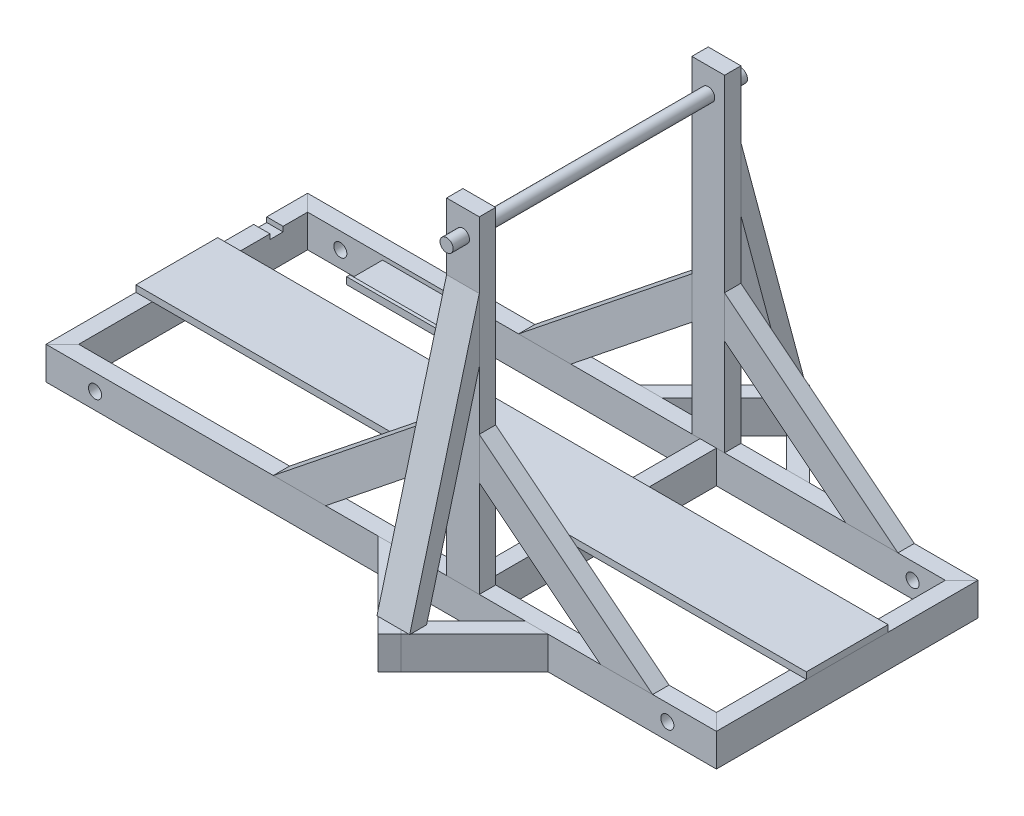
ISO-10303-21;
HEADER;
FILE_DESCRIPTION(('STEP AP214'),'2;1');
FILE_NAME('part.step','',(''),(''),'','','');
FILE_SCHEMA(('AUTOMOTIVE_DESIGN { 1 0 10303 214 1 1 1 1 }'));
ENDSEC;
DATA;
#1=APPLICATION_CONTEXT('core data for automotive mechanical design processes');
#2=APPLICATION_PROTOCOL_DEFINITION('international standard','automotive_design',2000,#1);
#3=PRODUCT_CONTEXT('',#1,'mechanical');
#4=PRODUCT('Part','Part','',(#3));
#5=PRODUCT_RELATED_PRODUCT_CATEGORY('part','',(#4));
#6=PRODUCT_DEFINITION_FORMATION('','',#4);
#7=PRODUCT_DEFINITION_CONTEXT('part definition',#1,'design');
#8=PRODUCT_DEFINITION('design','',#6,#7);
#9=PRODUCT_DEFINITION_SHAPE('','',#8);
#10=(LENGTH_UNIT() NAMED_UNIT(*) SI_UNIT(.MILLI.,.METRE.));
#11=(NAMED_UNIT(*) PLANE_ANGLE_UNIT() SI_UNIT($,.RADIAN.));
#12=(NAMED_UNIT(*) SI_UNIT($,.STERADIAN.) SOLID_ANGLE_UNIT());
#13=UNCERTAINTY_MEASURE_WITH_UNIT(LENGTH_MEASURE(1.E-05),#10,'distance_accuracy_value','');
#14=(GEOMETRIC_REPRESENTATION_CONTEXT(3) GLOBAL_UNCERTAINTY_ASSIGNED_CONTEXT((#13)) GLOBAL_UNIT_ASSIGNED_CONTEXT((#10,
#11,#12)) REPRESENTATION_CONTEXT('',''));
#15=CARTESIAN_POINT('',(0.,0.,0.));
#16=DIRECTION('',(0.,0.,1.));
#17=DIRECTION('',(1.,0.,0.));
#18=AXIS2_PLACEMENT_3D('',#15,#16,#17);
#19=CARTESIAN_POINT('',(-74.5751036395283,2.75443031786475,-24.));
#20=DIRECTION('',(1.,0.,0.));
#21=DIRECTION('',(0.,0.,-1.));
#22=AXIS2_PLACEMENT_3D('',#19,#20,#21);
#23=PLANE('',#22);
#24=DIRECTION('',(0.,-1.,0.));
#25=VECTOR('',#24,1.);
#26=CARTESIAN_POINT('',(-74.5751036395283,2.75443031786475,-25.));
#27=LINE('',#26,#25);
#28=CARTESIAN_POINT('',(-74.5751036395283,4.85825310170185,-25.));
#29=VERTEX_POINT('',#28);
#30=CARTESIAN_POINT('',(-74.5751036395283,2.75443031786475,-25.));
#31=VERTEX_POINT('',#30);
#32=EDGE_CURVE('E121',#29,#31,#27,.T.);
#33=ORIENTED_EDGE('',*,*,#32,.T.);
#34=DIRECTION('',(0.,0.,-1.));
#35=VECTOR('',#34,1.);
#36=CARTESIAN_POINT('',(-74.5751036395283,2.75443031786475,-24.));
#37=LINE('',#36,#35);
#38=CARTESIAN_POINT('',(-74.5751036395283,2.75443031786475,-24.));
#39=VERTEX_POINT('',#38);
#40=EDGE_CURVE('E13',#39,#31,#37,.T.);
#41=ORIENTED_EDGE('',*,*,#40,.F.);
#42=DIRECTION('',(0.,-1.,0.));
#43=VECTOR('',#42,1.);
#44=CARTESIAN_POINT('',(-74.5751036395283,2.75443031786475,-24.));
#45=LINE('',#44,#43);
#46=CARTESIAN_POINT('',(-74.5751036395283,4.85825310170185,-24.));
#47=VERTEX_POINT('',#46);
#48=EDGE_CURVE('E109',#47,#39,#45,.T.);
#49=ORIENTED_EDGE('',*,*,#48,.F.);
#50=DIRECTION('',(0.,0.,-1.));
#51=VECTOR('',#50,1.);
#52=CARTESIAN_POINT('',(-74.5751036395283,4.85825310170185,-24.));
#53=LINE('',#52,#51);
#54=EDGE_CURVE('E117',#47,#29,#53,.T.);
#55=ORIENTED_EDGE('',*,*,#54,.T.);
#56=EDGE_LOOP('',(#33,#41,#49,#55));
#57=FACE_BOUND('',#56,.T.);
#58=ADVANCED_FACE('F58',(#57),#23,.F.);
#59=CARTESIAN_POINT('',(-74.5751036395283,2.75443031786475,-24.));
#60=DIRECTION('',(0.,1.,0.));
#61=DIRECTION('',(0.,0.,1.));
#62=AXIS2_PLACEMENT_3D('',#59,#60,#61);
#63=PLANE('',#62);
#64=DIRECTION('',(1.,0.,0.));
#65=VECTOR('',#64,1.);
#66=CARTESIAN_POINT('',(-74.5751036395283,2.75443031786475,-25.));
#67=LINE('',#66,#65);
#68=CARTESIAN_POINT('',(-44.5751036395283,2.75443031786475,-25.));
#69=VERTEX_POINT('',#68);
#70=EDGE_CURVE('E113',#31,#69,#67,.T.);
#71=ORIENTED_EDGE('',*,*,#70,.T.);
#72=DIRECTION('',(0.,0.,-1.));
#73=VECTOR('',#72,1.);
#74=CARTESIAN_POINT('',(-44.5751036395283,2.75443031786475,-24.));
#75=LINE('',#74,#73);
#76=CARTESIAN_POINT('',(-44.5751036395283,2.75443031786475,-24.));
#77=VERTEX_POINT('',#76);
#78=EDGE_CURVE('E66',#77,#69,#75,.T.);
#79=ORIENTED_EDGE('',*,*,#78,.F.);
#80=DIRECTION('',(1.,0.,0.));
#81=VECTOR('',#80,1.);
#82=CARTESIAN_POINT('',(-74.5751036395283,2.75443031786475,-24.));
#83=LINE('',#82,#81);
#84=EDGE_CURVE('E104',#39,#77,#83,.T.);
#85=ORIENTED_EDGE('',*,*,#84,.F.);
#86=ORIENTED_EDGE('',*,*,#40,.T.);
#87=EDGE_LOOP('',(#71,#79,#85,#86));
#88=FACE_BOUND('',#87,.T.);
#89=ADVANCED_FACE('F112',(#88),#63,.F.);
#90=CARTESIAN_POINT('',(-44.5751036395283,2.75443031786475,-24.));
#91=DIRECTION('',(-1.,0.,0.));
#92=DIRECTION('',(0.,0.,1.));
#93=AXIS2_PLACEMENT_3D('',#90,#91,#92);
#94=PLANE('',#93);
#95=DIRECTION('',(0.,1.,0.));
#96=VECTOR('',#95,1.);
#97=CARTESIAN_POINT('',(-44.5751036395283,2.75443031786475,-25.));
#98=LINE('',#97,#96);
#99=CARTESIAN_POINT('',(-44.5751036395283,4.85825310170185,-25.));
#100=VERTEX_POINT('',#99);
#101=EDGE_CURVE('E91',#69,#100,#98,.T.);
#102=ORIENTED_EDGE('',*,*,#101,.T.);
#103=DIRECTION('',(0.,0.,-1.));
#104=VECTOR('',#103,1.);
#105=CARTESIAN_POINT('',(-44.5751036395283,4.85825310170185,-24.));
#106=LINE('',#105,#104);
#107=CARTESIAN_POINT('',(-44.5751036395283,4.85825310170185,-24.));
#108=VERTEX_POINT('',#107);
#109=EDGE_CURVE('E114',#108,#100,#106,.T.);
#110=ORIENTED_EDGE('',*,*,#109,.F.);
#111=DIRECTION('',(0.,1.,0.));
#112=VECTOR('',#111,1.);
#113=CARTESIAN_POINT('',(-44.5751036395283,2.75443031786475,-24.));
#114=LINE('',#113,#112);
#115=EDGE_CURVE('E107',#77,#108,#114,.T.);
#116=ORIENTED_EDGE('',*,*,#115,.F.);
#117=ORIENTED_EDGE('',*,*,#78,.T.);
#118=EDGE_LOOP('',(#102,#110,#116,#117));
#119=FACE_BOUND('',#118,.T.);
#120=ADVANCED_FACE('F115',(#119),#94,.F.);
#121=CARTESIAN_POINT('',(-74.5751036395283,4.85825310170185,-24.));
#122=DIRECTION('',(0.,-1.,0.));
#123=DIRECTION('',(0.,0.,-1.));
#124=AXIS2_PLACEMENT_3D('',#121,#122,#123);
#125=PLANE('',#124);
#126=DIRECTION('',(-1.,0.,0.));
#127=VECTOR('',#126,1.);
#128=CARTESIAN_POINT('',(-74.5751036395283,4.85825310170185,-25.));
#129=LINE('',#128,#127);
#130=EDGE_CURVE('E97',#100,#29,#129,.T.);
#131=ORIENTED_EDGE('',*,*,#130,.T.);
#132=ORIENTED_EDGE('',*,*,#54,.F.);
#133=DIRECTION('',(-1.,0.,0.));
#134=VECTOR('',#133,1.);
#135=CARTESIAN_POINT('',(-74.5751036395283,4.85825310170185,-24.));
#136=LINE('',#135,#134);
#137=EDGE_CURVE('E74',#108,#47,#136,.T.);
#138=ORIENTED_EDGE('',*,*,#137,.F.);
#139=ORIENTED_EDGE('',*,*,#109,.T.);
#140=EDGE_LOOP('',(#131,#132,#138,#139));
#141=FACE_BOUND('',#140,.T.);
#142=ADVANCED_FACE('F128',(#141),#125,.F.);
#143=CARTESIAN_POINT('',(-74.5751036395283,4.85825310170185,-24.));
#144=DIRECTION('',(0.,0.,-1.));
#145=DIRECTION('',(-1.,0.,0.));
#146=AXIS2_PLACEMENT_3D('',#143,#144,#145);
#147=PLANE('',#146);
#148=ORIENTED_EDGE('',*,*,#48,.T.);
#149=ORIENTED_EDGE('',*,*,#84,.T.);
#150=ORIENTED_EDGE('',*,*,#115,.T.);
#151=ORIENTED_EDGE('',*,*,#137,.T.);
#152=EDGE_LOOP('',(#148,#149,#150,#151));
#153=FACE_BOUND('',#152,.T.);
#154=ADVANCED_FACE('F105',(#153),#147,.F.);
#155=CARTESIAN_POINT('',(-74.5751036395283,4.85825310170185,-25.));
#156=DIRECTION('',(0.,0.,-1.));
#157=DIRECTION('',(-1.,0.,0.));
#158=AXIS2_PLACEMENT_3D('',#155,#156,#157);
#159=PLANE('',#158);
#160=ORIENTED_EDGE('',*,*,#32,.F.);
#161=ORIENTED_EDGE('',*,*,#130,.F.);
#162=ORIENTED_EDGE('',*,*,#101,.F.);
#163=ORIENTED_EDGE('',*,*,#70,.F.);
#164=EDGE_LOOP('',(#160,#161,#162,#163));
#165=FACE_BOUND('',#164,.T.);
#166=ADVANCED_FACE('F131',(#165),#159,.T.);
#167=CLOSED_SHELL('',(#58,#89,#120,#142,#154,#166));
#168=MANIFOLD_SOLID_BREP('B2',#167);
#169=CARTESIAN_POINT('',(-74.5751036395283,3.75443031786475,-25.));
#170=DIRECTION('',(1.,0.,0.));
#171=DIRECTION('',(0.,0.,-1.));
#172=AXIS2_PLACEMENT_3D('',#169,#170,#171);
#173=PLANE('',#172);
#174=DIRECTION('',(0.,-1.,0.));
#175=VECTOR('',#174,1.);
#176=CARTESIAN_POINT('',(-74.5751036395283,3.75443031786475,-35.));
#177=LINE('',#176,#175);
#178=CARTESIAN_POINT('',(-74.5751036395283,3.75443031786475,-35.));
#179=VERTEX_POINT('',#178);
#180=CARTESIAN_POINT('',(-74.5751036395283,2.75443031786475,-35.));
#181=VERTEX_POINT('',#180);
#182=EDGE_CURVE('E254',#179,#181,#177,.T.);
#183=ORIENTED_EDGE('',*,*,#182,.T.);
#184=DIRECTION('',(0.,0.,-1.));
#185=VECTOR('',#184,1.);
#186=CARTESIAN_POINT('',(-74.5751036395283,2.75443031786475,-25.));
#187=LINE('',#186,#185);
#188=CARTESIAN_POINT('',(-74.5751036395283,2.75443031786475,-25.));
#189=VERTEX_POINT('',#188);
#190=EDGE_CURVE('E56',#189,#181,#187,.T.);
#191=ORIENTED_EDGE('',*,*,#190,.F.);
#192=DIRECTION('',(0.,-1.,0.));
#193=VECTOR('',#192,1.);
#194=CARTESIAN_POINT('',(-74.5751036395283,3.75443031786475,-25.));
#195=LINE('',#194,#193);
#196=CARTESIAN_POINT('',(-74.5751036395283,3.75443031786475,-25.));
#197=VERTEX_POINT('',#196);
#198=EDGE_CURVE('E242',#197,#189,#195,.T.);
#199=ORIENTED_EDGE('',*,*,#198,.F.);
#200=DIRECTION('',(0.,0.,-1.));
#201=VECTOR('',#200,1.);
#202=CARTESIAN_POINT('',(-74.5751036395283,3.75443031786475,-25.));
#203=LINE('',#202,#201);
#204=EDGE_CURVE('E250',#197,#179,#203,.T.);
#205=ORIENTED_EDGE('',*,*,#204,.T.);
#206=EDGE_LOOP('',(#183,#191,#199,#205));
#207=FACE_BOUND('',#206,.T.);
#208=ADVANCED_FACE('F191',(#207),#173,.F.);
#209=CARTESIAN_POINT('',(-74.5751036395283,2.75443031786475,-25.));
#210=DIRECTION('',(0.,1.,0.));
#211=DIRECTION('',(0.,0.,1.));
#212=AXIS2_PLACEMENT_3D('',#209,#210,#211);
#213=PLANE('',#212);
#214=DIRECTION('',(1.,0.,0.));
#215=VECTOR('',#214,1.);
#216=CARTESIAN_POINT('',(-74.5751036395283,2.75443031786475,-35.));
#217=LINE('',#216,#215);
#218=CARTESIAN_POINT('',(-44.5751036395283,2.75443031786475,-35.));
#219=VERTEX_POINT('',#218);
#220=EDGE_CURVE('E246',#181,#219,#217,.T.);
#221=ORIENTED_EDGE('',*,*,#220,.T.);
#222=DIRECTION('',(0.,0.,-1.));
#223=VECTOR('',#222,1.);
#224=CARTESIAN_POINT('',(-44.5751036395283,2.75443031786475,-25.));
#225=LINE('',#224,#223);
#226=CARTESIAN_POINT('',(-44.5751036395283,2.75443031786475,-25.));
#227=VERTEX_POINT('',#226);
#228=EDGE_CURVE('E199',#227,#219,#225,.T.);
#229=ORIENTED_EDGE('',*,*,#228,.F.);
#230=DIRECTION('',(1.,0.,0.));
#231=VECTOR('',#230,1.);
#232=CARTESIAN_POINT('',(-74.5751036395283,2.75443031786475,-25.));
#233=LINE('',#232,#231);
#234=EDGE_CURVE('E237',#189,#227,#233,.T.);
#235=ORIENTED_EDGE('',*,*,#234,.F.);
#236=ORIENTED_EDGE('',*,*,#190,.T.);
#237=EDGE_LOOP('',(#221,#229,#235,#236));
#238=FACE_BOUND('',#237,.T.);
#239=ADVANCED_FACE('F245',(#238),#213,.F.);
#240=CARTESIAN_POINT('',(-44.5751036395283,3.75443031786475,-25.));
#241=DIRECTION('',(-1.,0.,0.));
#242=DIRECTION('',(0.,0.,1.));
#243=AXIS2_PLACEMENT_3D('',#240,#241,#242);
#244=PLANE('',#243);
#245=DIRECTION('',(0.,1.,0.));
#246=VECTOR('',#245,1.);
#247=CARTESIAN_POINT('',(-44.5751036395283,3.75443031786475,-35.));
#248=LINE('',#247,#246);
#249=CARTESIAN_POINT('',(-44.5751036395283,3.75443031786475,-35.));
#250=VERTEX_POINT('',#249);
#251=EDGE_CURVE('E224',#219,#250,#248,.T.);
#252=ORIENTED_EDGE('',*,*,#251,.T.);
#253=DIRECTION('',(0.,0.,-1.));
#254=VECTOR('',#253,1.);
#255=CARTESIAN_POINT('',(-44.5751036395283,3.75443031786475,-25.));
#256=LINE('',#255,#254);
#257=CARTESIAN_POINT('',(-44.5751036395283,3.75443031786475,-25.));
#258=VERTEX_POINT('',#257);
#259=EDGE_CURVE('E247',#258,#250,#256,.T.);
#260=ORIENTED_EDGE('',*,*,#259,.F.);
#261=DIRECTION('',(0.,1.,0.));
#262=VECTOR('',#261,1.);
#263=CARTESIAN_POINT('',(-44.5751036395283,3.75443031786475,-25.));
#264=LINE('',#263,#262);
#265=EDGE_CURVE('E240',#227,#258,#264,.T.);
#266=ORIENTED_EDGE('',*,*,#265,.F.);
#267=ORIENTED_EDGE('',*,*,#228,.T.);
#268=EDGE_LOOP('',(#252,#260,#266,#267));
#269=FACE_BOUND('',#268,.T.);
#270=ADVANCED_FACE('F248',(#269),#244,.F.);
#271=CARTESIAN_POINT('',(-74.5751036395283,3.75443031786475,-25.));
#272=DIRECTION('',(0.,-1.,0.));
#273=DIRECTION('',(0.,0.,-1.));
#274=AXIS2_PLACEMENT_3D('',#271,#272,#273);
#275=PLANE('',#274);
#276=DIRECTION('',(-1.,0.,0.));
#277=VECTOR('',#276,1.);
#278=CARTESIAN_POINT('',(-74.5751036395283,3.75443031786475,-35.));
#279=LINE('',#278,#277);
#280=EDGE_CURVE('E230',#250,#179,#279,.T.);
#281=ORIENTED_EDGE('',*,*,#280,.T.);
#282=ORIENTED_EDGE('',*,*,#204,.F.);
#283=DIRECTION('',(-1.,0.,0.));
#284=VECTOR('',#283,1.);
#285=CARTESIAN_POINT('',(-74.5751036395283,3.75443031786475,-25.));
#286=LINE('',#285,#284);
#287=EDGE_CURVE('E207',#258,#197,#286,.T.);
#288=ORIENTED_EDGE('',*,*,#287,.F.);
#289=ORIENTED_EDGE('',*,*,#259,.T.);
#290=EDGE_LOOP('',(#281,#282,#288,#289));
#291=FACE_BOUND('',#290,.T.);
#292=ADVANCED_FACE('F261',(#291),#275,.F.);
#293=CARTESIAN_POINT('',(-74.5751036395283,2.75443031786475,-25.));
#294=DIRECTION('',(0.,0.,1.));
#295=DIRECTION('',(1.,0.,0.));
#296=AXIS2_PLACEMENT_3D('',#293,#294,#295);
#297=PLANE('',#296);
#298=ORIENTED_EDGE('',*,*,#198,.T.);
#299=ORIENTED_EDGE('',*,*,#234,.T.);
#300=ORIENTED_EDGE('',*,*,#265,.T.);
#301=ORIENTED_EDGE('',*,*,#287,.T.);
#302=EDGE_LOOP('',(#298,#299,#300,#301));
#303=FACE_BOUND('',#302,.T.);
#304=ADVANCED_FACE('F238',(#303),#297,.T.);
#305=CARTESIAN_POINT('',(-74.5751036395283,2.75443031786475,-35.));
#306=DIRECTION('',(0.,0.,1.));
#307=DIRECTION('',(1.,0.,0.));
#308=AXIS2_PLACEMENT_3D('',#305,#306,#307);
#309=PLANE('',#308);
#310=ORIENTED_EDGE('',*,*,#182,.F.);
#311=ORIENTED_EDGE('',*,*,#280,.F.);
#312=ORIENTED_EDGE('',*,*,#251,.F.);
#313=ORIENTED_EDGE('',*,*,#220,.F.);
#314=EDGE_LOOP('',(#310,#311,#312,#313));
#315=FACE_BOUND('',#314,.T.);
#316=ADVANCED_FACE('F264',(#315),#309,.F.);
#317=CLOSED_SHELL('',(#208,#239,#270,#292,#304,#316));
#318=MANIFOLD_SOLID_BREP('B7',#317);
#319=CARTESIAN_POINT('',(127.579872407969,5.,-12.5));
#320=DIRECTION('',(0.,0.,-1.));
#321=DIRECTION('',(0.,1.,0.));
#322=AXIS2_PLACEMENT_3D('',#319,#320,#321);
#323=PLANE('',#322);
#324=DIRECTION('',(0.,1.,0.));
#325=VECTOR('',#324,1.);
#326=CARTESIAN_POINT('',(102.5,5.,-12.5));
#327=LINE('',#326,#325);
#328=CARTESIAN_POINT('',(102.5,5.,-12.5));
#329=VERTEX_POINT('',#328);
#330=CARTESIAN_POINT('',(102.5,7.,-12.5));
#331=VERTEX_POINT('',#330);
#332=EDGE_CURVE('E330',#329,#331,#327,.T.);
#333=ORIENTED_EDGE('',*,*,#332,.F.);
#334=DIRECTION('',(-1.,0.,0.));
#335=VECTOR('',#334,1.);
#336=CARTESIAN_POINT('',(127.579872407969,5.,-12.5));
#337=LINE('',#336,#335);
#338=CARTESIAN_POINT('',(-102.5,5.,-12.5));
#339=VERTEX_POINT('',#338);
#340=EDGE_CURVE('E356',#329,#339,#337,.T.);
#341=ORIENTED_EDGE('',*,*,#340,.T.);
#342=DIRECTION('',(0.,-1.,0.));
#343=VECTOR('',#342,1.);
#344=CARTESIAN_POINT('',(-102.5,5.,-12.5));
#345=LINE('',#344,#343);
#346=CARTESIAN_POINT('',(-102.5,7.,-12.5));
#347=VERTEX_POINT('',#346);
#348=EDGE_CURVE('E360',#347,#339,#345,.T.);
#349=ORIENTED_EDGE('',*,*,#348,.F.);
#350=DIRECTION('',(-1.,0.,0.));
#351=VECTOR('',#350,1.);
#352=CARTESIAN_POINT('',(127.579872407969,7.,-12.5));
#353=LINE('',#352,#351);
#354=EDGE_CURVE('E382',#331,#347,#353,.T.);
#355=ORIENTED_EDGE('',*,*,#354,.F.);
#356=EDGE_LOOP('',(#333,#341,#349,#355));
#357=FACE_BOUND('',#356,.T.);
#358=ADVANCED_FACE('F322',(#357),#323,.T.);
#359=CARTESIAN_POINT('',(127.579872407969,7.,-12.5));
#360=DIRECTION('',(0.,1.,0.));
#361=DIRECTION('',(0.,0.,1.));
#362=AXIS2_PLACEMENT_3D('',#359,#360,#361);
#363=PLANE('',#362);
#364=DIRECTION('',(0.,0.,1.));
#365=VECTOR('',#364,1.);
#366=CARTESIAN_POINT('',(102.5,7.,-12.5));
#367=LINE('',#366,#365);
#368=CARTESIAN_POINT('',(102.5,7.,12.5));
#369=VERTEX_POINT('',#368);
#370=EDGE_CURVE('E394',#331,#369,#367,.T.);
#371=ORIENTED_EDGE('',*,*,#370,.F.);
#372=ORIENTED_EDGE('',*,*,#354,.T.);
#373=DIRECTION('',(0.,0.,-1.));
#374=VECTOR('',#373,1.);
#375=CARTESIAN_POINT('',(-102.5,7.,-12.5));
#376=LINE('',#375,#374);
#377=CARTESIAN_POINT('',(-102.5,7.00000000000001,12.5));
#378=VERTEX_POINT('',#377);
#379=EDGE_CURVE('E364',#378,#347,#376,.T.);
#380=ORIENTED_EDGE('',*,*,#379,.F.);
#381=DIRECTION('',(-1.,0.,0.));
#382=VECTOR('',#381,1.);
#383=CARTESIAN_POINT('',(127.579872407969,7.00000000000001,12.5));
#384=LINE('',#383,#382);
#385=EDGE_CURVE('E385',#369,#378,#384,.T.);
#386=ORIENTED_EDGE('',*,*,#385,.F.);
#387=EDGE_LOOP('',(#371,#372,#380,#386));
#388=FACE_BOUND('',#387,.T.);
#389=ADVANCED_FACE('F393',(#388),#363,.T.);
#390=CARTESIAN_POINT('',(127.579872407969,5.00000000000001,12.5));
#391=DIRECTION('',(0.,0.,1.));
#392=DIRECTION('',(0.,-1.,0.));
#393=AXIS2_PLACEMENT_3D('',#390,#391,#392);
#394=PLANE('',#393);
#395=DIRECTION('',(0.,-1.,0.));
#396=VECTOR('',#395,1.);
#397=CARTESIAN_POINT('',(102.5,5.00000000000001,12.5));
#398=LINE('',#397,#396);
#399=CARTESIAN_POINT('',(102.5,5.00000000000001,12.5));
#400=VERTEX_POINT('',#399);
#401=EDGE_CURVE('E384',#369,#400,#398,.T.);
#402=ORIENTED_EDGE('',*,*,#401,.F.);
#403=ORIENTED_EDGE('',*,*,#385,.T.);
#404=DIRECTION('',(0.,1.,0.));
#405=VECTOR('',#404,1.);
#406=CARTESIAN_POINT('',(-102.5,5.00000000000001,12.5));
#407=LINE('',#406,#405);
#408=CARTESIAN_POINT('',(-102.5,5.00000000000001,12.5));
#409=VERTEX_POINT('',#408);
#410=EDGE_CURVE('E372',#409,#378,#407,.T.);
#411=ORIENTED_EDGE('',*,*,#410,.F.);
#412=DIRECTION('',(-1.,0.,0.));
#413=VECTOR('',#412,1.);
#414=CARTESIAN_POINT('',(127.579872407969,5.00000000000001,12.5));
#415=LINE('',#414,#413);
#416=EDGE_CURVE('E363',#400,#409,#415,.T.);
#417=ORIENTED_EDGE('',*,*,#416,.F.);
#418=EDGE_LOOP('',(#402,#403,#411,#417));
#419=FACE_BOUND('',#418,.T.);
#420=ADVANCED_FACE('F390',(#419),#394,.T.);
#421=CARTESIAN_POINT('',(127.579872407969,5.,-12.5));
#422=DIRECTION('',(0.,-1.,0.));
#423=DIRECTION('',(0.,0.,-1.));
#424=AXIS2_PLACEMENT_3D('',#421,#422,#423);
#425=PLANE('',#424);
#426=DIRECTION('',(0.,0.,-1.));
#427=VECTOR('',#426,1.);
#428=CARTESIAN_POINT('',(102.5,5.,-12.5));
#429=LINE('',#428,#427);
#430=EDGE_CURVE('E189',#400,#329,#429,.T.);
#431=ORIENTED_EDGE('',*,*,#430,.F.);
#432=ORIENTED_EDGE('',*,*,#416,.T.);
#433=DIRECTION('',(0.,0.,1.));
#434=VECTOR('',#433,1.);
#435=CARTESIAN_POINT('',(-102.5,5.,-12.5));
#436=LINE('',#435,#434);
#437=EDGE_CURVE('E366',#339,#409,#436,.T.);
#438=ORIENTED_EDGE('',*,*,#437,.F.);
#439=ORIENTED_EDGE('',*,*,#340,.F.);
#440=EDGE_LOOP('',(#431,#432,#438,#439));
#441=FACE_BOUND('',#440,.T.);
#442=ADVANCED_FACE('F367',(#441),#425,.T.);
#443=CARTESIAN_POINT('',(-102.5,7.,-12.5));
#444=DIRECTION('',(1.,0.,0.));
#445=DIRECTION('',(0.,0.,-1.));
#446=AXIS2_PLACEMENT_3D('',#443,#444,#445);
#447=PLANE('',#446);
#448=ORIENTED_EDGE('',*,*,#348,.T.);
#449=ORIENTED_EDGE('',*,*,#437,.T.);
#450=ORIENTED_EDGE('',*,*,#410,.T.);
#451=ORIENTED_EDGE('',*,*,#379,.T.);
#452=EDGE_LOOP('',(#448,#449,#450,#451));
#453=FACE_BOUND('',#452,.T.);
#454=ADVANCED_FACE('F374',(#453),#447,.F.);
#455=CARTESIAN_POINT('',(102.5,-5.,37.5));
#456=DIRECTION('',(-1.,0.,0.));
#457=DIRECTION('',(0.,0.,1.));
#458=AXIS2_PLACEMENT_3D('',#455,#456,#457);
#459=PLANE('',#458);
#460=ORIENTED_EDGE('',*,*,#332,.T.);
#461=ORIENTED_EDGE('',*,*,#370,.T.);
#462=ORIENTED_EDGE('',*,*,#401,.T.);
#463=ORIENTED_EDGE('',*,*,#430,.T.);
#464=EDGE_LOOP('',(#460,#461,#462,#463));
#465=FACE_BOUND('',#464,.T.);
#466=ADVANCED_FACE('F395',(#465),#459,.F.);
#467=CLOSED_SHELL('',(#358,#389,#420,#442,#454,#466));
#468=MANIFOLD_SOLID_BREP('B50',#467);
#469=CARTESIAN_POINT('',(25.,97.5,-45.));
#470=DIRECTION('',(0.,0.,1.));
#471=DIRECTION('',(1.,0.,0.));
#472=AXIS2_PLACEMENT_3D('',#469,#470,#471);
#473=CYLINDRICAL_SURFACE('',#472,2.00000000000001);
#474=CARTESIAN_POINT('',(25.,97.5,-45.));
#475=DIRECTION('',(0.,0.,1.));
#476=DIRECTION('',(1.,0.,0.));
#477=AXIS2_PLACEMENT_3D('',#474,#475,#476);
#478=CIRCLE('',#477,2.00000000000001);
#479=CARTESIAN_POINT('',(27.,97.5,-45.));
#480=VERTEX_POINT('',#479);
#481=EDGE_CURVE('E321',#480,#480,#478,.T.);
#482=ORIENTED_EDGE('',*,*,#481,.T.);
#483=EDGE_LOOP('',(#482));
#484=FACE_BOUND('',#483,.T.);
#485=CARTESIAN_POINT('',(25.,97.5,45.));
#486=DIRECTION('',(0.,0.,1.));
#487=DIRECTION('',(1.,0.,0.));
#488=AXIS2_PLACEMENT_3D('',#485,#486,#487);
#489=CIRCLE('',#488,2.00000000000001);
#490=CARTESIAN_POINT('',(27.,97.5,45.));
#491=VERTEX_POINT('',#490);
#492=EDGE_CURVE('E461',#491,#491,#489,.T.);
#493=ORIENTED_EDGE('',*,*,#492,.F.);
#494=EDGE_LOOP('',(#493));
#495=FACE_BOUND('',#494,.T.);
#496=ADVANCED_FACE('F455',(#484,#495),#473,.T.);
#497=CARTESIAN_POINT('',(25.,97.5,-45.));
#498=DIRECTION('',(0.,0.,1.));
#499=DIRECTION('',(1.,0.,0.));
#500=AXIS2_PLACEMENT_3D('',#497,#498,#499);
#501=PLANE('',#500);
#502=ORIENTED_EDGE('',*,*,#481,.F.);
#503=EDGE_LOOP('',(#502));
#504=FACE_BOUND('',#503,.T.);
#505=ADVANCED_FACE('F470',(#504),#501,.F.);
#506=CARTESIAN_POINT('',(25.,97.5,45.));
#507=DIRECTION('',(0.,0.,1.));
#508=DIRECTION('',(1.,0.,0.));
#509=AXIS2_PLACEMENT_3D('',#506,#507,#508);
#510=PLANE('',#509);
#511=ORIENTED_EDGE('',*,*,#492,.T.);
#512=EDGE_LOOP('',(#511));
#513=FACE_BOUND('',#512,.T.);
#514=ADVANCED_FACE('F467',(#513),#510,.T.);
#515=CLOSED_SHELL('',(#496,#505,#514));
#516=MANIFOLD_SOLID_BREP('B183',#515);
#517=CARTESIAN_POINT('',(25.,55.,40.));
#518=DIRECTION('',(0.,0.,1.));
#519=DIRECTION('',(-1.,0.,0.));
#520=AXIS2_PLACEMENT_3D('',#517,#518,#519);
#521=PLANE('',#520);
#522=DIRECTION('',(0.,1.,0.));
#523=VECTOR('',#522,1.);
#524=CARTESIAN_POINT('',(20.,74.3545182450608,40.));
#525=LINE('',#524,#523);
#526=CARTESIAN_POINT('',(20.,65.3173095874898,40.));
#527=VERTEX_POINT('',#526);
#528=CARTESIAN_POINT('',(20.,84.6826904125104,40.));
#529=VERTEX_POINT('',#528);
#530=EDGE_CURVE('E559',#527,#529,#525,.T.);
#531=ORIENTED_EDGE('',*,*,#530,.T.);
#532=DIRECTION('',(1.,0.,0.));
#533=VECTOR('',#532,1.);
#534=CARTESIAN_POINT('',(20.,84.6826904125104,40.));
#535=LINE('',#534,#533);
#536=CARTESIAN_POINT('',(30.,84.6826904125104,40.));
#537=VERTEX_POINT('',#536);
#538=EDGE_CURVE('E562',#529,#537,#535,.T.);
#539=ORIENTED_EDGE('',*,*,#538,.T.);
#540=DIRECTION('',(0.,-1.,0.));
#541=VECTOR('',#540,1.);
#542=CARTESIAN_POINT('',(30.,74.3545182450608,40.));
#543=LINE('',#542,#541);
#544=CARTESIAN_POINT('',(30.,65.3173095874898,40.));
#545=VERTEX_POINT('',#544);
#546=EDGE_CURVE('E547',#537,#545,#543,.T.);
#547=ORIENTED_EDGE('',*,*,#546,.T.);
#548=DIRECTION('',(-1.,0.,0.));
#549=VECTOR('',#548,1.);
#550=CARTESIAN_POINT('',(20.,65.3173095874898,40.));
#551=LINE('',#550,#549);
#552=EDGE_CURVE('E553',#545,#527,#551,.T.);
#553=ORIENTED_EDGE('',*,*,#552,.T.);
#554=EDGE_LOOP('',(#531,#539,#547,#553));
#555=FACE_BOUND('',#554,.T.);
#556=ADVANCED_FACE('F505',(#555),#521,.F.);
#557=CARTESIAN_POINT('',(20.,75.6454817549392,42.4152335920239));
#558=DIRECTION('',(0.,-0.258192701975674,-0.966093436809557));
#559=DIRECTION('',(0.,-0.966093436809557,0.258192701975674));
#560=AXIS2_PLACEMENT_3D('',#557,#558,#559);
#561=PLANE('',#560);
#562=DIRECTION('',(0.,-0.966093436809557,0.258192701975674));
#563=VECTOR('',#562,1.);
#564=CARTESIAN_POINT('',(30.,75.6454817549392,42.4152335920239));
#565=LINE('',#564,#563);
#566=CARTESIAN_POINT('',(30.,5.,61.2955479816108));
#567=VERTEX_POINT('',#566);
#568=EDGE_CURVE('E550',#537,#567,#565,.T.);
#569=ORIENTED_EDGE('',*,*,#568,.F.);
#570=ORIENTED_EDGE('',*,*,#538,.F.);
#571=DIRECTION('',(0.,-0.966093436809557,0.258192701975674));
#572=VECTOR('',#571,1.);
#573=CARTESIAN_POINT('',(20.,75.6454817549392,42.4152335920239));
#574=LINE('',#573,#572);
#575=CARTESIAN_POINT('',(20.,5.,61.2955479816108));
#576=VERTEX_POINT('',#575);
#577=EDGE_CURVE('E563',#529,#576,#574,.T.);
#578=ORIENTED_EDGE('',*,*,#577,.T.);
#579=DIRECTION('',(-1.,0.,0.));
#580=VECTOR('',#579,1.);
#581=CARTESIAN_POINT('',(20.,5.,61.2955479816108));
#582=LINE('',#581,#580);
#583=EDGE_CURVE('E509',#567,#576,#582,.T.);
#584=ORIENTED_EDGE('',*,*,#583,.F.);
#585=EDGE_LOOP('',(#569,#570,#578,#584));
#586=FACE_BOUND('',#585,.T.);
#587=ADVANCED_FACE('F507',(#586),#561,.F.);
#588=CARTESIAN_POINT('',(20.,74.3545182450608,37.5847664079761));
#589=DIRECTION('',(1.,0.,0.));
#590=DIRECTION('',(0.,0.,1.));
#591=AXIS2_PLACEMENT_3D('',#588,#589,#590);
#592=PLANE('',#591);
#593=ORIENTED_EDGE('',*,*,#577,.F.);
#594=ORIENTED_EDGE('',*,*,#530,.F.);
#595=DIRECTION('',(0.,-0.966093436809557,0.258192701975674));
#596=VECTOR('',#595,1.);
#597=CARTESIAN_POINT('',(20.,74.3545182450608,37.5847664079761));
#598=LINE('',#597,#596);
#599=CARTESIAN_POINT('',(20.,5.00000000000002,56.1200651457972));
#600=VERTEX_POINT('',#599);
#601=EDGE_CURVE('E549',#527,#600,#598,.T.);
#602=ORIENTED_EDGE('',*,*,#601,.T.);
#603=DIRECTION('',(0.,0.,-1.));
#604=VECTOR('',#603,1.);
#605=CARTESIAN_POINT('',(20.,5.,37.5847664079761));
#606=LINE('',#605,#604);
#607=EDGE_CURVE('E572',#576,#600,#606,.T.);
#608=ORIENTED_EDGE('',*,*,#607,.F.);
#609=EDGE_LOOP('',(#593,#594,#602,#608));
#610=FACE_BOUND('',#609,.T.);
#611=ADVANCED_FACE('F579',(#610),#592,.F.);
#612=CARTESIAN_POINT('',(20.,74.3545182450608,37.5847664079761));
#613=DIRECTION('',(0.,0.258192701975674,0.966093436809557));
#614=DIRECTION('',(0.,0.966093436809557,-0.258192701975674));
#615=AXIS2_PLACEMENT_3D('',#612,#613,#614);
#616=PLANE('',#615);
#617=ORIENTED_EDGE('',*,*,#601,.F.);
#618=ORIENTED_EDGE('',*,*,#552,.F.);
#619=DIRECTION('',(0.,-0.966093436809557,0.258192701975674));
#620=VECTOR('',#619,1.);
#621=CARTESIAN_POINT('',(30.,74.3545182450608,37.5847664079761));
#622=LINE('',#621,#620);
#623=CARTESIAN_POINT('',(30.,5.,56.1200651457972));
#624=VERTEX_POINT('',#623);
#625=EDGE_CURVE('E543',#545,#624,#622,.T.);
#626=ORIENTED_EDGE('',*,*,#625,.T.);
#627=DIRECTION('',(1.,0.,0.));
#628=VECTOR('',#627,1.);
#629=CARTESIAN_POINT('',(20.,5.,56.1200651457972));
#630=LINE('',#629,#628);
#631=EDGE_CURVE('E514',#600,#624,#630,.T.);
#632=ORIENTED_EDGE('',*,*,#631,.F.);
#633=EDGE_LOOP('',(#617,#618,#626,#632));
#634=FACE_BOUND('',#633,.T.);
#635=ADVANCED_FACE('F554',(#634),#616,.F.);
#636=CARTESIAN_POINT('',(30.,74.3545182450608,37.5847664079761));
#637=DIRECTION('',(-1.,0.,0.));
#638=DIRECTION('',(0.,0.,-1.));
#639=AXIS2_PLACEMENT_3D('',#636,#637,#638);
#640=PLANE('',#639);
#641=ORIENTED_EDGE('',*,*,#625,.F.);
#642=ORIENTED_EDGE('',*,*,#546,.F.);
#643=ORIENTED_EDGE('',*,*,#568,.T.);
#644=DIRECTION('',(0.,0.,1.));
#645=VECTOR('',#644,1.);
#646=CARTESIAN_POINT('',(30.,5.,37.5847664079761));
#647=LINE('',#646,#645);
#648=EDGE_CURVE('E453',#624,#567,#647,.T.);
#649=ORIENTED_EDGE('',*,*,#648,.F.);
#650=EDGE_LOOP('',(#641,#642,#643,#649));
#651=FACE_BOUND('',#650,.T.);
#652=ADVANCED_FACE('F545',(#651),#640,.F.);
#653=CARTESIAN_POINT('',(15.2366747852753,5.,49.7633252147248));
#654=DIRECTION('',(0.,1.,0.));
#655=DIRECTION('',(-1.,0.,0.));
#656=AXIS2_PLACEMENT_3D('',#653,#654,#655);
#657=PLANE('',#656);
#658=ORIENTED_EDGE('',*,*,#631,.T.);
#659=ORIENTED_EDGE('',*,*,#648,.T.);
#660=ORIENTED_EDGE('',*,*,#583,.T.);
#661=ORIENTED_EDGE('',*,*,#607,.T.);
#662=EDGE_LOOP('',(#658,#659,#660,#661));
#663=FACE_BOUND('',#662,.T.);
#664=ADVANCED_FACE('F576',(#663),#657,.F.);
#665=CLOSED_SHELL('',(#556,#587,#611,#635,#652,#664));
#666=MANIFOLD_SOLID_BREP('B316',#665);
#667=CARTESIAN_POINT('',(30.,105.,35.));
#668=DIRECTION('',(0.,0.,1.));
#669=DIRECTION('',(-1.,0.,0.));
#670=AXIS2_PLACEMENT_3D('',#667,#668,#669);
#671=PLANE('',#670);
#672=DIRECTION('',(1.,0.,0.));
#673=VECTOR('',#672,1.);
#674=CARTESIAN_POINT('',(30.,5.,35.));
#675=LINE('',#674,#673);
#676=CARTESIAN_POINT('',(20.,5.,35.));
#677=VERTEX_POINT('',#676);
#678=CARTESIAN_POINT('',(30.,5.,35.));
#679=VERTEX_POINT('',#678);
#680=EDGE_CURVE('E725',#677,#679,#675,.T.);
#681=ORIENTED_EDGE('',*,*,#680,.F.);
#682=DIRECTION('',(0.,-1.,0.));
#683=VECTOR('',#682,1.);
#684=CARTESIAN_POINT('',(20.,105.,35.));
#685=LINE('',#684,#683);
#686=CARTESIAN_POINT('',(20.,105.,35.));
#687=VERTEX_POINT('',#686);
#688=EDGE_CURVE('E724',#687,#677,#685,.T.);
#689=ORIENTED_EDGE('',*,*,#688,.F.);
#690=DIRECTION('',(1.,0.,0.));
#691=VECTOR('',#690,1.);
#692=CARTESIAN_POINT('',(30.,105.,35.));
#693=LINE('',#692,#691);
#694=CARTESIAN_POINT('',(30.,105.,35.));
#695=VERTEX_POINT('',#694);
#696=EDGE_CURVE('E719',#687,#695,#693,.T.);
#697=ORIENTED_EDGE('',*,*,#696,.T.);
#698=DIRECTION('',(0.,-1.,0.));
#699=VECTOR('',#698,1.);
#700=CARTESIAN_POINT('',(30.,105.,35.));
#701=LINE('',#700,#699);
#702=EDGE_CURVE('E503',#695,#679,#701,.T.);
#703=ORIENTED_EDGE('',*,*,#702,.T.);
#704=EDGE_LOOP('',(#681,#689,#697,#703));
#705=FACE_BOUND('',#704,.T.);
#706=ADVANCED_FACE('F662',(#705),#671,.F.);
#707=CARTESIAN_POINT('',(30.,105.,40.));
#708=DIRECTION('',(-1.,0.,0.));
#709=DIRECTION('',(0.,0.,-1.));
#710=AXIS2_PLACEMENT_3D('',#707,#708,#709);
#711=PLANE('',#710);
#712=DIRECTION('',(0.,0.,1.));
#713=VECTOR('',#712,1.);
#714=CARTESIAN_POINT('',(30.,5.,40.));
#715=LINE('',#714,#713);
#716=CARTESIAN_POINT('',(30.,5.,40.));
#717=VERTEX_POINT('',#716);
#718=EDGE_CURVE('E727',#679,#717,#715,.T.);
#719=ORIENTED_EDGE('',*,*,#718,.F.);
#720=ORIENTED_EDGE('',*,*,#702,.F.);
#721=DIRECTION('',(0.,0.,1.));
#722=VECTOR('',#721,1.);
#723=CARTESIAN_POINT('',(30.,105.,40.));
#724=LINE('',#723,#722);
#725=CARTESIAN_POINT('',(30.,105.,40.));
#726=VERTEX_POINT('',#725);
#727=EDGE_CURVE('E703',#695,#726,#724,.T.);
#728=ORIENTED_EDGE('',*,*,#727,.T.);
#729=DIRECTION('',(0.,-1.,0.));
#730=VECTOR('',#729,1.);
#731=CARTESIAN_POINT('',(30.,105.,40.));
#732=LINE('',#731,#730);
#733=EDGE_CURVE('E670',#726,#717,#732,.T.);
#734=ORIENTED_EDGE('',*,*,#733,.T.);
#735=EDGE_LOOP('',(#719,#720,#728,#734));
#736=FACE_BOUND('',#735,.T.);
#737=ADVANCED_FACE('F717',(#736),#711,.F.);
#738=CARTESIAN_POINT('',(30.,105.,40.));
#739=DIRECTION('',(0.,0.,-1.));
#740=DIRECTION('',(1.,0.,0.));
#741=AXIS2_PLACEMENT_3D('',#738,#739,#740);
#742=PLANE('',#741);
#743=DIRECTION('',(-1.,0.,0.));
#744=VECTOR('',#743,1.);
#745=CARTESIAN_POINT('',(30.,5.,40.));
#746=LINE('',#745,#744);
#747=CARTESIAN_POINT('',(20.,5.,40.));
#748=VERTEX_POINT('',#747);
#749=EDGE_CURVE('E713',#717,#748,#746,.T.);
#750=ORIENTED_EDGE('',*,*,#749,.F.);
#751=ORIENTED_EDGE('',*,*,#733,.F.);
#752=DIRECTION('',(-1.,0.,0.));
#753=VECTOR('',#752,1.);
#754=CARTESIAN_POINT('',(30.,105.,40.));
#755=LINE('',#754,#753);
#756=CARTESIAN_POINT('',(20.,105.,40.));
#757=VERTEX_POINT('',#756);
#758=EDGE_CURVE('E706',#726,#757,#755,.T.);
#759=ORIENTED_EDGE('',*,*,#758,.T.);
#760=DIRECTION('',(0.,-1.,0.));
#761=VECTOR('',#760,1.);
#762=CARTESIAN_POINT('',(20.,105.,40.));
#763=LINE('',#762,#761);
#764=EDGE_CURVE('E716',#757,#748,#763,.T.);
#765=ORIENTED_EDGE('',*,*,#764,.T.);
#766=EDGE_LOOP('',(#750,#751,#759,#765));
#767=FACE_BOUND('',#766,.T.);
#768=ADVANCED_FACE('F712',(#767),#742,.F.);
#769=CARTESIAN_POINT('',(20.,105.,40.));
#770=DIRECTION('',(1.,0.,0.));
#771=DIRECTION('',(0.,0.,1.));
#772=AXIS2_PLACEMENT_3D('',#769,#770,#771);
#773=PLANE('',#772);
#774=DIRECTION('',(0.,0.,-1.));
#775=VECTOR('',#774,1.);
#776=CARTESIAN_POINT('',(20.,5.,40.));
#777=LINE('',#776,#775);
#778=EDGE_CURVE('E692',#748,#677,#777,.T.);
#779=ORIENTED_EDGE('',*,*,#778,.F.);
#780=ORIENTED_EDGE('',*,*,#764,.F.);
#781=DIRECTION('',(0.,0.,-1.));
#782=VECTOR('',#781,1.);
#783=CARTESIAN_POINT('',(20.,105.,40.));
#784=LINE('',#783,#782);
#785=EDGE_CURVE('E678',#757,#687,#784,.T.);
#786=ORIENTED_EDGE('',*,*,#785,.T.);
#787=ORIENTED_EDGE('',*,*,#688,.T.);
#788=EDGE_LOOP('',(#779,#780,#786,#787));
#789=FACE_BOUND('',#788,.T.);
#790=ADVANCED_FACE('F736',(#789),#773,.F.);
#791=CARTESIAN_POINT('',(20.,105.,35.));
#792=DIRECTION('',(0.,1.,0.));
#793=DIRECTION('',(0.,0.,-1.));
#794=AXIS2_PLACEMENT_3D('',#791,#792,#793);
#795=PLANE('',#794);
#796=ORIENTED_EDGE('',*,*,#696,.F.);
#797=ORIENTED_EDGE('',*,*,#785,.F.);
#798=ORIENTED_EDGE('',*,*,#758,.F.);
#799=ORIENTED_EDGE('',*,*,#727,.F.);
#800=EDGE_LOOP('',(#796,#797,#798,#799));
#801=FACE_BOUND('',#800,.T.);
#802=ADVANCED_FACE('F708',(#801),#795,.T.);
#803=CARTESIAN_POINT('',(20.,5.,35.));
#804=DIRECTION('',(0.,1.,0.));
#805=DIRECTION('',(0.,0.,-1.));
#806=AXIS2_PLACEMENT_3D('',#803,#804,#805);
#807=PLANE('',#806);
#808=ORIENTED_EDGE('',*,*,#680,.T.);
#809=ORIENTED_EDGE('',*,*,#718,.T.);
#810=ORIENTED_EDGE('',*,*,#749,.T.);
#811=ORIENTED_EDGE('',*,*,#778,.T.);
#812=EDGE_LOOP('',(#808,#809,#810,#811));
#813=FACE_BOUND('',#812,.T.);
#814=ADVANCED_FACE('F732',(#813),#807,.F.);
#815=CLOSED_SHELL('',(#706,#737,#768,#790,#802,#814));
#816=MANIFOLD_SOLID_BREP('B447',#815);
#817=CARTESIAN_POINT('',(-1.11022302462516E-13,5.,37.4999999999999));
#818=DIRECTION('',(0.,1.,0.));
#819=DIRECTION('',(0.,0.,-1.));
#820=AXIS2_PLACEMENT_3D('',#817,#818,#819);
#821=PLANE('',#820);
#822=DIRECTION('',(0.,0.,-1.));
#823=VECTOR('',#822,1.);
#824=CARTESIAN_POINT('',(-33.0039052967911,5.,40.));
#825=LINE('',#824,#823);
#826=CARTESIAN_POINT('',(-33.0039052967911,5.,40.));
#827=VERTEX_POINT('',#826);
#828=CARTESIAN_POINT('',(-33.0039052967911,4.99999999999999,35.));
#829=VERTEX_POINT('',#828);
#830=EDGE_CURVE('E886',#827,#829,#825,.T.);
#831=ORIENTED_EDGE('',*,*,#830,.T.);
#832=DIRECTION('',(1.,0.,0.));
#833=VECTOR('',#832,1.);
#834=CARTESIAN_POINT('',(28.1234752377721,5.,35.));
#835=LINE('',#834,#833);
#836=CARTESIAN_POINT('',(-16.9960947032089,5.,35.));
#837=VERTEX_POINT('',#836);
#838=EDGE_CURVE('E879',#829,#837,#835,.T.);
#839=ORIENTED_EDGE('',*,*,#838,.T.);
#840=DIRECTION('',(0.,0.,1.));
#841=VECTOR('',#840,1.);
#842=CARTESIAN_POINT('',(-16.9960947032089,5.,40.));
#843=LINE('',#842,#841);
#844=CARTESIAN_POINT('',(-16.9960947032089,5.,40.));
#845=VERTEX_POINT('',#844);
#846=EDGE_CURVE('E872',#837,#845,#843,.T.);
#847=ORIENTED_EDGE('',*,*,#846,.T.);
#848=DIRECTION('',(-1.,0.,0.));
#849=VECTOR('',#848,1.);
#850=CARTESIAN_POINT('',(28.1234752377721,5.,40.));
#851=LINE('',#850,#849);
#852=EDGE_CURVE('E827',#845,#827,#851,.T.);
#853=ORIENTED_EDGE('',*,*,#852,.T.);
#854=EDGE_LOOP('',(#831,#839,#847,#853));
#855=FACE_BOUND('',#854,.T.);
#856=ADVANCED_FACE('F819',(#855),#821,.F.);
#857=CARTESIAN_POINT('',(28.1234752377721,41.0956559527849,35.));
#858=DIRECTION('',(0.,0.,1.));
#859=DIRECTION('',(-1.,0.,0.));
#860=AXIS2_PLACEMENT_3D('',#857,#858,#859);
#861=PLANE('',#860);
#862=DIRECTION('',(0.,-1.,0.));
#863=VECTOR('',#862,1.);
#864=CARTESIAN_POINT('',(20.,41.0956559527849,35.));
#865=LINE('',#864,#863);
#866=CARTESIAN_POINT('',(20.,47.4031242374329,35.));
#867=VERTEX_POINT('',#866);
#868=CARTESIAN_POINT('',(20.,34.5968757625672,35.));
#869=VERTEX_POINT('',#868);
#870=EDGE_CURVE('E660',#867,#869,#865,.T.);
#871=ORIENTED_EDGE('',*,*,#870,.T.);
#872=DIRECTION('',(-0.78086880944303,-0.624695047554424,0.));
#873=VECTOR('',#872,1.);
#874=CARTESIAN_POINT('',(28.1234752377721,41.0956559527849,35.));
#875=LINE('',#874,#873);
#876=EDGE_CURVE('E869',#869,#837,#875,.T.);
#877=ORIENTED_EDGE('',*,*,#876,.T.);
#878=ORIENTED_EDGE('',*,*,#838,.F.);
#879=DIRECTION('',(-0.78086880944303,-0.624695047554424,0.));
#880=VECTOR('',#879,1.);
#881=CARTESIAN_POINT('',(21.8765247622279,48.9043440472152,35.));
#882=LINE('',#881,#880);
#883=EDGE_CURVE('E877',#867,#829,#882,.T.);
#884=ORIENTED_EDGE('',*,*,#883,.F.);
#885=EDGE_LOOP('',(#871,#877,#878,#884));
#886=FACE_BOUND('',#885,.T.);
#887=ADVANCED_FACE('F821',(#886),#861,.F.);
#888=CARTESIAN_POINT('',(28.1234752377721,41.0956559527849,40.));
#889=DIRECTION('',(-0.624695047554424,0.78086880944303,0.));
#890=DIRECTION('',(-0.78086880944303,-0.624695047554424,0.));
#891=AXIS2_PLACEMENT_3D('',#888,#889,#890);
#892=PLANE('',#891);
#893=DIRECTION('',(0.,0.,1.));
#894=VECTOR('',#893,1.);
#895=CARTESIAN_POINT('',(20.,34.5968757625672,40.));
#896=LINE('',#895,#894);
#897=CARTESIAN_POINT('',(20.,34.5968757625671,40.));
#898=VERTEX_POINT('',#897);
#899=EDGE_CURVE('E861',#869,#898,#896,.T.);
#900=ORIENTED_EDGE('',*,*,#899,.T.);
#901=DIRECTION('',(-0.78086880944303,-0.624695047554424,0.));
#902=VECTOR('',#901,1.);
#903=CARTESIAN_POINT('',(28.1234752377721,41.0956559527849,40.));
#904=LINE('',#903,#902);
#905=EDGE_CURVE('E876',#898,#845,#904,.T.);
#906=ORIENTED_EDGE('',*,*,#905,.T.);
#907=ORIENTED_EDGE('',*,*,#846,.F.);
#908=ORIENTED_EDGE('',*,*,#876,.F.);
#909=EDGE_LOOP('',(#900,#906,#907,#908));
#910=FACE_BOUND('',#909,.T.);
#911=ADVANCED_FACE('F870',(#910),#892,.F.);
#912=CARTESIAN_POINT('',(28.1234752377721,41.0956559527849,40.));
#913=DIRECTION('',(0.,0.,-1.));
#914=DIRECTION('',(1.,0.,0.));
#915=AXIS2_PLACEMENT_3D('',#912,#913,#914);
#916=PLANE('',#915);
#917=DIRECTION('',(0.,-1.,0.));
#918=VECTOR('',#917,1.);
#919=CARTESIAN_POINT('',(20.,105.,40.));
#920=LINE('',#919,#918);
#921=CARTESIAN_POINT('',(20.,47.4031242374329,40.));
#922=VERTEX_POINT('',#921);
#923=EDGE_CURVE('E864',#922,#898,#920,.T.);
#924=ORIENTED_EDGE('',*,*,#923,.F.);
#925=DIRECTION('',(-0.78086880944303,-0.624695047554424,0.));
#926=VECTOR('',#925,1.);
#927=CARTESIAN_POINT('',(21.8765247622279,48.9043440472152,40.));
#928=LINE('',#927,#926);
#929=EDGE_CURVE('E841',#922,#827,#928,.T.);
#930=ORIENTED_EDGE('',*,*,#929,.T.);
#931=ORIENTED_EDGE('',*,*,#852,.F.);
#932=ORIENTED_EDGE('',*,*,#905,.F.);
#933=EDGE_LOOP('',(#924,#930,#931,#932));
#934=FACE_BOUND('',#933,.T.);
#935=ADVANCED_FACE('F893',(#934),#916,.F.);
#936=CARTESIAN_POINT('',(21.8765247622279,48.9043440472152,40.));
#937=DIRECTION('',(0.624695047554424,-0.78086880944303,0.));
#938=DIRECTION('',(0.78086880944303,0.624695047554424,0.));
#939=AXIS2_PLACEMENT_3D('',#936,#937,#938);
#940=PLANE('',#939);
#941=DIRECTION('',(0.,0.,-1.));
#942=VECTOR('',#941,1.);
#943=CARTESIAN_POINT('',(20.,47.4031242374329,40.));
#944=LINE('',#943,#942);
#945=EDGE_CURVE('E834',#922,#867,#944,.T.);
#946=ORIENTED_EDGE('',*,*,#945,.T.);
#947=ORIENTED_EDGE('',*,*,#883,.T.);
#948=ORIENTED_EDGE('',*,*,#830,.F.);
#949=ORIENTED_EDGE('',*,*,#929,.F.);
#950=EDGE_LOOP('',(#946,#947,#948,#949));
#951=FACE_BOUND('',#950,.T.);
#952=ADVANCED_FACE('F892',(#951),#940,.F.);
#953=CARTESIAN_POINT('',(20.,105.,40.));
#954=DIRECTION('',(1.,0.,0.));
#955=DIRECTION('',(0.,0.,1.));
#956=AXIS2_PLACEMENT_3D('',#953,#954,#955);
#957=PLANE('',#956);
#958=ORIENTED_EDGE('',*,*,#945,.F.);
#959=ORIENTED_EDGE('',*,*,#923,.T.);
#960=ORIENTED_EDGE('',*,*,#899,.F.);
#961=ORIENTED_EDGE('',*,*,#870,.F.);
#962=EDGE_LOOP('',(#958,#959,#960,#961));
#963=FACE_BOUND('',#962,.T.);
#964=ADVANCED_FACE('F863',(#963),#957,.T.);
#965=CLOSED_SHELL('',(#856,#887,#911,#935,#952,#964));
#966=MANIFOLD_SOLID_BREP('B497',#965);
#967=CARTESIAN_POINT('',(78.1234752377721,8.90434404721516,40.));
#968=DIRECTION('',(-0.624695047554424,-0.78086880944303,0.));
#969=DIRECTION('',(0.78086880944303,-0.624695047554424,0.));
#970=AXIS2_PLACEMENT_3D('',#967,#968,#969);
#971=PLANE('',#970);
#972=DIRECTION('',(0.,0.,1.));
#973=VECTOR('',#972,1.);
#974=CARTESIAN_POINT('',(30.,47.4031242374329,40.));
#975=LINE('',#974,#973);
#976=CARTESIAN_POINT('',(30.,47.4031242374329,35.));
#977=VERTEX_POINT('',#976);
#978=CARTESIAN_POINT('',(30.,47.4031242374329,40.));
#979=VERTEX_POINT('',#978);
#980=EDGE_CURVE('E1039',#977,#979,#975,.T.);
#981=ORIENTED_EDGE('',*,*,#980,.T.);
#982=DIRECTION('',(-0.78086880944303,0.624695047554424,0.));
#983=VECTOR('',#982,1.);
#984=CARTESIAN_POINT('',(78.1234752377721,8.90434404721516,40.));
#985=LINE('',#984,#983);
#986=CARTESIAN_POINT('',(83.0039052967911,5.,40.));
#987=VERTEX_POINT('',#986);
#988=EDGE_CURVE('E1029',#987,#979,#985,.T.);
#989=ORIENTED_EDGE('',*,*,#988,.F.);
#990=DIRECTION('',(0.,0.,1.));
#991=VECTOR('',#990,1.);
#992=CARTESIAN_POINT('',(83.0039052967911,5.,40.));
#993=LINE('',#992,#991);
#994=CARTESIAN_POINT('',(83.0039052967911,5.,35.));
#995=VERTEX_POINT('',#994);
#996=EDGE_CURVE('E1035',#995,#987,#993,.T.);
#997=ORIENTED_EDGE('',*,*,#996,.F.);
#998=DIRECTION('',(-0.78086880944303,0.624695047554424,0.));
#999=VECTOR('',#998,1.);
#1000=CARTESIAN_POINT('',(78.1234752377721,8.90434404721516,35.));
#1001=LINE('',#1000,#999);
#1002=EDGE_CURVE('E979',#995,#977,#1001,.T.);
#1003=ORIENTED_EDGE('',*,*,#1002,.T.);
#1004=EDGE_LOOP('',(#981,#989,#997,#1003));
#1005=FACE_BOUND('',#1004,.T.);
#1006=ADVANCED_FACE('F976',(#1005),#971,.F.);
#1007=CARTESIAN_POINT('',(71.8765247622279,1.09565595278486,40.));
#1008=DIRECTION('',(0.,0.,-1.));
#1009=DIRECTION('',(1.,0.,0.));
#1010=AXIS2_PLACEMENT_3D('',#1007,#1008,#1009);
#1011=PLANE('',#1010);
#1012=DIRECTION('',(0.,-1.,0.));
#1013=VECTOR('',#1012,1.);
#1014=CARTESIAN_POINT('',(30.,105.,40.));
#1015=LINE('',#1014,#1013);
#1016=CARTESIAN_POINT('',(30.,34.5968757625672,40.));
#1017=VERTEX_POINT('',#1016);
#1018=EDGE_CURVE('E1007',#979,#1017,#1015,.T.);
#1019=ORIENTED_EDGE('',*,*,#1018,.T.);
#1020=DIRECTION('',(-0.78086880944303,0.624695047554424,0.));
#1021=VECTOR('',#1020,1.);
#1022=CARTESIAN_POINT('',(71.8765247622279,1.09565595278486,40.));
#1023=LINE('',#1022,#1021);
#1024=CARTESIAN_POINT('',(66.996094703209,5.,40.));
#1025=VERTEX_POINT('',#1024);
#1026=EDGE_CURVE('E1031',#1025,#1017,#1023,.T.);
#1027=ORIENTED_EDGE('',*,*,#1026,.F.);
#1028=DIRECTION('',(-1.,0.,0.));
#1029=VECTOR('',#1028,1.);
#1030=CARTESIAN_POINT('',(71.8765247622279,5.,40.));
#1031=LINE('',#1030,#1029);
#1032=EDGE_CURVE('E1025',#987,#1025,#1031,.T.);
#1033=ORIENTED_EDGE('',*,*,#1032,.F.);
#1034=ORIENTED_EDGE('',*,*,#988,.T.);
#1035=EDGE_LOOP('',(#1019,#1027,#1033,#1034));
#1036=FACE_BOUND('',#1035,.T.);
#1037=ADVANCED_FACE('F1027',(#1036),#1011,.F.);
#1038=CARTESIAN_POINT('',(71.8765247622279,1.09565595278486,40.));
#1039=DIRECTION('',(0.624695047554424,0.78086880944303,0.));
#1040=DIRECTION('',(-0.78086880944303,0.624695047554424,0.));
#1041=AXIS2_PLACEMENT_3D('',#1038,#1039,#1040);
#1042=PLANE('',#1041);
#1043=DIRECTION('',(0.,0.,-1.));
#1044=VECTOR('',#1043,1.);
#1045=CARTESIAN_POINT('',(30.,34.5968757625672,40.));
#1046=LINE('',#1045,#1044);
#1047=CARTESIAN_POINT('',(30.,34.5968757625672,35.));
#1048=VERTEX_POINT('',#1047);
#1049=EDGE_CURVE('E985',#1017,#1048,#1046,.T.);
#1050=ORIENTED_EDGE('',*,*,#1049,.T.);
#1051=DIRECTION('',(-0.78086880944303,0.624695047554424,0.));
#1052=VECTOR('',#1051,1.);
#1053=CARTESIAN_POINT('',(71.8765247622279,1.09565595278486,35.));
#1054=LINE('',#1053,#1052);
#1055=CARTESIAN_POINT('',(66.996094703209,5.,35.));
#1056=VERTEX_POINT('',#1055);
#1057=EDGE_CURVE('E1044',#1056,#1048,#1054,.T.);
#1058=ORIENTED_EDGE('',*,*,#1057,.F.);
#1059=DIRECTION('',(0.,0.,-1.));
#1060=VECTOR('',#1059,1.);
#1061=CARTESIAN_POINT('',(66.996094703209,5.,40.));
#1062=LINE('',#1061,#1060);
#1063=EDGE_CURVE('E1020',#1025,#1056,#1062,.T.);
#1064=ORIENTED_EDGE('',*,*,#1063,.F.);
#1065=ORIENTED_EDGE('',*,*,#1026,.T.);
#1066=EDGE_LOOP('',(#1050,#1058,#1064,#1065));
#1067=FACE_BOUND('',#1066,.T.);
#1068=ADVANCED_FACE('F1048',(#1067),#1042,.F.);
#1069=CARTESIAN_POINT('',(71.8765247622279,1.09565595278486,35.));
#1070=DIRECTION('',(0.,0.,1.));
#1071=DIRECTION('',(-1.,0.,0.));
#1072=AXIS2_PLACEMENT_3D('',#1069,#1070,#1071);
#1073=PLANE('',#1072);
#1074=DIRECTION('',(0.,1.,0.));
#1075=VECTOR('',#1074,1.);
#1076=CARTESIAN_POINT('',(30.,1.09565595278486,35.));
#1077=LINE('',#1076,#1075);
#1078=EDGE_CURVE('E817',#1048,#977,#1077,.T.);
#1079=ORIENTED_EDGE('',*,*,#1078,.T.);
#1080=ORIENTED_EDGE('',*,*,#1002,.F.);
#1081=DIRECTION('',(1.,0.,0.));
#1082=VECTOR('',#1081,1.);
#1083=CARTESIAN_POINT('',(71.8765247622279,5.,35.));
#1084=LINE('',#1083,#1082);
#1085=EDGE_CURVE('E1012',#1056,#995,#1084,.T.);
#1086=ORIENTED_EDGE('',*,*,#1085,.F.);
#1087=ORIENTED_EDGE('',*,*,#1057,.T.);
#1088=EDGE_LOOP('',(#1079,#1080,#1086,#1087));
#1089=FACE_BOUND('',#1088,.T.);
#1090=ADVANCED_FACE('F1050',(#1089),#1073,.F.);
#1091=CARTESIAN_POINT('',(-1.11022302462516E-13,5.,37.4999999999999));
#1092=DIRECTION('',(0.,1.,0.));
#1093=DIRECTION('',(0.,0.,-1.));
#1094=AXIS2_PLACEMENT_3D('',#1091,#1092,#1093);
#1095=PLANE('',#1094);
#1096=ORIENTED_EDGE('',*,*,#1063,.T.);
#1097=ORIENTED_EDGE('',*,*,#1085,.T.);
#1098=ORIENTED_EDGE('',*,*,#996,.T.);
#1099=ORIENTED_EDGE('',*,*,#1032,.T.);
#1100=EDGE_LOOP('',(#1096,#1097,#1098,#1099));
#1101=FACE_BOUND('',#1100,.T.);
#1102=ADVANCED_FACE('F1036',(#1101),#1095,.F.);
#1103=CARTESIAN_POINT('',(30.,105.,40.));
#1104=DIRECTION('',(-1.,0.,0.));
#1105=DIRECTION('',(0.,0.,-1.));
#1106=AXIS2_PLACEMENT_3D('',#1103,#1104,#1105);
#1107=PLANE('',#1106);
#1108=ORIENTED_EDGE('',*,*,#980,.F.);
#1109=ORIENTED_EDGE('',*,*,#1078,.F.);
#1110=ORIENTED_EDGE('',*,*,#1049,.F.);
#1111=ORIENTED_EDGE('',*,*,#1018,.F.);
#1112=EDGE_LOOP('',(#1108,#1109,#1110,#1111));
#1113=FACE_BOUND('',#1112,.T.);
#1114=ADVANCED_FACE('F1083',(#1113),#1107,.T.);
#1115=CLOSED_SHELL('',(#1006,#1037,#1068,#1090,#1102,#1114));
#1116=MANIFOLD_SOLID_BREP('B654',#1115);
#1117=CARTESIAN_POINT('',(25.,55.,-40.));
#1118=DIRECTION('',(0.,0.,-1.));
#1119=DIRECTION('',(-1.,0.,0.));
#1120=AXIS2_PLACEMENT_3D('',#1117,#1118,#1119);
#1121=PLANE('',#1120);
#1122=DIRECTION('',(0.,1.,0.));
#1123=VECTOR('',#1122,1.);
#1124=CARTESIAN_POINT('',(20.,74.3545182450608,-40.));
#1125=LINE('',#1124,#1123);
#1126=CARTESIAN_POINT('',(20.,65.3173095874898,-40.));
#1127=VERTEX_POINT('',#1126);
#1128=CARTESIAN_POINT('',(20.,84.6826904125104,-40.));
#1129=VERTEX_POINT('',#1128);
#1130=EDGE_CURVE('E1177',#1127,#1129,#1125,.T.);
#1131=ORIENTED_EDGE('',*,*,#1130,.F.);
#1132=DIRECTION('',(-1.,0.,0.));
#1133=VECTOR('',#1132,1.);
#1134=CARTESIAN_POINT('',(20.,65.3173095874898,-40.));
#1135=LINE('',#1134,#1133);
#1136=CARTESIAN_POINT('',(30.,65.3173095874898,-40.));
#1137=VERTEX_POINT('',#1136);
#1138=EDGE_CURVE('E1171',#1137,#1127,#1135,.T.);
#1139=ORIENTED_EDGE('',*,*,#1138,.F.);
#1140=DIRECTION('',(0.,-1.,0.));
#1141=VECTOR('',#1140,1.);
#1142=CARTESIAN_POINT('',(30.,74.3545182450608,-40.));
#1143=LINE('',#1142,#1141);
#1144=CARTESIAN_POINT('',(30.,84.6826904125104,-40.));
#1145=VERTEX_POINT('',#1144);
#1146=EDGE_CURVE('E1174',#1145,#1137,#1143,.T.);
#1147=ORIENTED_EDGE('',*,*,#1146,.F.);
#1148=DIRECTION('',(1.,0.,0.));
#1149=VECTOR('',#1148,1.);
#1150=CARTESIAN_POINT('',(20.,84.6826904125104,-40.));
#1151=LINE('',#1150,#1149);
#1152=EDGE_CURVE('E1196',#1129,#1145,#1151,.T.);
#1153=ORIENTED_EDGE('',*,*,#1152,.F.);
#1154=EDGE_LOOP('',(#1131,#1139,#1147,#1153));
#1155=FACE_BOUND('',#1154,.T.);
#1156=ADVANCED_FACE('F1133',(#1155),#1121,.F.);
#1157=CARTESIAN_POINT('',(20.,75.6454817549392,-42.4152335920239));
#1158=DIRECTION('',(0.,-0.258192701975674,0.966093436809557));
#1159=DIRECTION('',(0.,-0.966093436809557,-0.258192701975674));
#1160=AXIS2_PLACEMENT_3D('',#1157,#1158,#1159);
#1161=PLANE('',#1160);
#1162=DIRECTION('',(0.,-0.966093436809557,-0.258192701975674));
#1163=VECTOR('',#1162,1.);
#1164=CARTESIAN_POINT('',(30.,75.6454817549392,-42.4152335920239));
#1165=LINE('',#1164,#1163);
#1166=CARTESIAN_POINT('',(30.,5.,-61.2955479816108));
#1167=VERTEX_POINT('',#1166);
#1168=EDGE_CURVE('E1185',#1145,#1167,#1165,.T.);
#1169=ORIENTED_EDGE('',*,*,#1168,.T.);
#1170=DIRECTION('',(-1.,0.,0.));
#1171=VECTOR('',#1170,1.);
#1172=CARTESIAN_POINT('',(20.,5.,-61.2955479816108));
#1173=LINE('',#1172,#1171);
#1174=CARTESIAN_POINT('',(20.,5.,-61.2955479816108));
#1175=VERTEX_POINT('',#1174);
#1176=EDGE_CURVE('E1137',#1167,#1175,#1173,.T.);
#1177=ORIENTED_EDGE('',*,*,#1176,.T.);
#1178=DIRECTION('',(0.,-0.966093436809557,-0.258192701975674));
#1179=VECTOR('',#1178,1.);
#1180=CARTESIAN_POINT('',(20.,75.6454817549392,-42.4152335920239));
#1181=LINE('',#1180,#1179);
#1182=EDGE_CURVE('E1190',#1129,#1175,#1181,.T.);
#1183=ORIENTED_EDGE('',*,*,#1182,.F.);
#1184=ORIENTED_EDGE('',*,*,#1152,.T.);
#1185=EDGE_LOOP('',(#1169,#1177,#1183,#1184));
#1186=FACE_BOUND('',#1185,.T.);
#1187=ADVANCED_FACE('F1135',(#1186),#1161,.F.);
#1188=CARTESIAN_POINT('',(20.,74.3545182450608,-37.5847664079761));
#1189=DIRECTION('',(1.,0.,0.));
#1190=DIRECTION('',(0.,0.,-1.));
#1191=AXIS2_PLACEMENT_3D('',#1188,#1189,#1190);
#1192=PLANE('',#1191);
#1193=ORIENTED_EDGE('',*,*,#1182,.T.);
#1194=DIRECTION('',(0.,0.,1.));
#1195=VECTOR('',#1194,1.);
#1196=CARTESIAN_POINT('',(20.,5.,-37.5847664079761));
#1197=LINE('',#1196,#1195);
#1198=CARTESIAN_POINT('',(20.,5.00000000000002,-56.1200651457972));
#1199=VERTEX_POINT('',#1198);
#1200=EDGE_CURVE('E1200',#1175,#1199,#1197,.T.);
#1201=ORIENTED_EDGE('',*,*,#1200,.T.);
#1202=DIRECTION('',(0.,-0.966093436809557,-0.258192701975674));
#1203=VECTOR('',#1202,1.);
#1204=CARTESIAN_POINT('',(20.,74.3545182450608,-37.5847664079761));
#1205=LINE('',#1204,#1203);
#1206=EDGE_CURVE('E1184',#1127,#1199,#1205,.T.);
#1207=ORIENTED_EDGE('',*,*,#1206,.F.);
#1208=ORIENTED_EDGE('',*,*,#1130,.T.);
#1209=EDGE_LOOP('',(#1193,#1201,#1207,#1208));
#1210=FACE_BOUND('',#1209,.T.);
#1211=ADVANCED_FACE('F1207',(#1210),#1192,.F.);
#1212=CARTESIAN_POINT('',(20.,74.3545182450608,-37.5847664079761));
#1213=DIRECTION('',(0.,0.258192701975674,-0.966093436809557));
#1214=DIRECTION('',(0.,0.966093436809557,0.258192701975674));
#1215=AXIS2_PLACEMENT_3D('',#1212,#1213,#1214);
#1216=PLANE('',#1215);
#1217=ORIENTED_EDGE('',*,*,#1206,.T.);
#1218=DIRECTION('',(1.,0.,0.));
#1219=VECTOR('',#1218,1.);
#1220=CARTESIAN_POINT('',(20.,5.,-56.1200651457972));
#1221=LINE('',#1220,#1219);
#1222=CARTESIAN_POINT('',(30.,5.,-56.1200651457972));
#1223=VERTEX_POINT('',#1222);
#1224=EDGE_CURVE('E1142',#1199,#1223,#1221,.T.);
#1225=ORIENTED_EDGE('',*,*,#1224,.T.);
#1226=DIRECTION('',(0.,-0.966093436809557,-0.258192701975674));
#1227=VECTOR('',#1226,1.);
#1228=CARTESIAN_POINT('',(30.,74.3545182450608,-37.5847664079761));
#1229=LINE('',#1228,#1227);
#1230=EDGE_CURVE('E1181',#1137,#1223,#1229,.T.);
#1231=ORIENTED_EDGE('',*,*,#1230,.F.);
#1232=ORIENTED_EDGE('',*,*,#1138,.T.);
#1233=EDGE_LOOP('',(#1217,#1225,#1231,#1232));
#1234=FACE_BOUND('',#1233,.T.);
#1235=ADVANCED_FACE('F1182',(#1234),#1216,.F.);
#1236=CARTESIAN_POINT('',(30.,74.3545182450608,-37.5847664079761));
#1237=DIRECTION('',(-1.,0.,0.));
#1238=DIRECTION('',(0.,0.,1.));
#1239=AXIS2_PLACEMENT_3D('',#1236,#1237,#1238);
#1240=PLANE('',#1239);
#1241=ORIENTED_EDGE('',*,*,#1230,.T.);
#1242=DIRECTION('',(0.,0.,-1.));
#1243=VECTOR('',#1242,1.);
#1244=CARTESIAN_POINT('',(30.,5.,-37.5847664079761));
#1245=LINE('',#1244,#1243);
#1246=EDGE_CURVE('E974',#1223,#1167,#1245,.T.);
#1247=ORIENTED_EDGE('',*,*,#1246,.T.);
#1248=ORIENTED_EDGE('',*,*,#1168,.F.);
#1249=ORIENTED_EDGE('',*,*,#1146,.T.);
#1250=EDGE_LOOP('',(#1241,#1247,#1248,#1249));
#1251=FACE_BOUND('',#1250,.T.);
#1252=ADVANCED_FACE('F1188',(#1251),#1240,.F.);
#1253=CARTESIAN_POINT('',(15.2366747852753,5.,-49.7633252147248));
#1254=DIRECTION('',(0.,1.,0.));
#1255=DIRECTION('',(-1.,0.,0.));
#1256=AXIS2_PLACEMENT_3D('',#1253,#1254,#1255);
#1257=PLANE('',#1256);
#1258=ORIENTED_EDGE('',*,*,#1224,.F.);
#1259=ORIENTED_EDGE('',*,*,#1200,.F.);
#1260=ORIENTED_EDGE('',*,*,#1176,.F.);
#1261=ORIENTED_EDGE('',*,*,#1246,.F.);
#1262=EDGE_LOOP('',(#1258,#1259,#1260,#1261));
#1263=FACE_BOUND('',#1262,.T.);
#1264=ADVANCED_FACE('F1206',(#1263),#1257,.F.);
#1265=CLOSED_SHELL('',(#1156,#1187,#1211,#1235,#1252,#1264));
#1266=MANIFOLD_SOLID_BREP('B811',#1265);
#1267=CARTESIAN_POINT('',(78.1234752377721,8.90434404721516,-40.));
#1268=DIRECTION('',(-0.624695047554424,-0.78086880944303,0.));
#1269=DIRECTION('',(0.78086880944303,-0.624695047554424,0.));
#1270=AXIS2_PLACEMENT_3D('',#1267,#1268,#1269);
#1271=PLANE('',#1270);
#1272=DIRECTION('',(0.,0.,-1.));
#1273=VECTOR('',#1272,1.);
#1274=CARTESIAN_POINT('',(30.,47.4031242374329,-40.));
#1275=LINE('',#1274,#1273);
#1276=CARTESIAN_POINT('',(30.,47.4031242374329,-35.));
#1277=VERTEX_POINT('',#1276);
#1278=CARTESIAN_POINT('',(30.,47.4031242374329,-40.));
#1279=VERTEX_POINT('',#1278);
#1280=EDGE_CURVE('E1306',#1277,#1279,#1275,.T.);
#1281=ORIENTED_EDGE('',*,*,#1280,.F.);
#1282=DIRECTION('',(-0.78086880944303,0.624695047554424,0.));
#1283=VECTOR('',#1282,1.);
#1284=CARTESIAN_POINT('',(78.1234752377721,8.90434404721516,-35.));
#1285=LINE('',#1284,#1283);
#1286=CARTESIAN_POINT('',(83.0039052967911,5.,-35.));
#1287=VERTEX_POINT('',#1286);
#1288=EDGE_CURVE('E1281',#1287,#1277,#1285,.T.);
#1289=ORIENTED_EDGE('',*,*,#1288,.F.);
#1290=DIRECTION('',(0.,0.,-1.));
#1291=VECTOR('',#1290,1.);
#1292=CARTESIAN_POINT('',(83.0039052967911,5.,-40.));
#1293=LINE('',#1292,#1291);
#1294=CARTESIAN_POINT('',(83.0039052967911,5.,-40.));
#1295=VERTEX_POINT('',#1294);
#1296=EDGE_CURVE('E1327',#1287,#1295,#1293,.T.);
#1297=ORIENTED_EDGE('',*,*,#1296,.T.);
#1298=DIRECTION('',(-0.78086880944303,0.624695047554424,0.));
#1299=VECTOR('',#1298,1.);
#1300=CARTESIAN_POINT('',(78.1234752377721,8.90434404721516,-40.));
#1301=LINE('',#1300,#1299);
#1302=EDGE_CURVE('E1331',#1295,#1279,#1301,.T.);
#1303=ORIENTED_EDGE('',*,*,#1302,.T.);
#1304=EDGE_LOOP('',(#1281,#1289,#1297,#1303));
#1305=FACE_BOUND('',#1304,.T.);
#1306=ADVANCED_FACE('F1278',(#1305),#1271,.F.);
#1307=CARTESIAN_POINT('',(71.8765247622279,1.09565595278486,-40.));
#1308=DIRECTION('',(0.,0.,1.));
#1309=DIRECTION('',(1.,0.,0.));
#1310=AXIS2_PLACEMENT_3D('',#1307,#1308,#1309);
#1311=PLANE('',#1310);
#1312=DIRECTION('',(0.,-1.,0.));
#1313=VECTOR('',#1312,1.);
#1314=CARTESIAN_POINT('',(30.,105.,-40.));
#1315=LINE('',#1314,#1313);
#1316=CARTESIAN_POINT('',(30.,34.5968757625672,-40.));
#1317=VERTEX_POINT('',#1316);
#1318=EDGE_CURVE('E1303',#1279,#1317,#1315,.T.);
#1319=ORIENTED_EDGE('',*,*,#1318,.F.);
#1320=ORIENTED_EDGE('',*,*,#1302,.F.);
#1321=DIRECTION('',(-1.,0.,0.));
#1322=VECTOR('',#1321,1.);
#1323=CARTESIAN_POINT('',(71.8765247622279,5.,-40.));
#1324=LINE('',#1323,#1322);
#1325=CARTESIAN_POINT('',(66.996094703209,5.,-40.));
#1326=VERTEX_POINT('',#1325);
#1327=EDGE_CURVE('E1323',#1295,#1326,#1324,.T.);
#1328=ORIENTED_EDGE('',*,*,#1327,.T.);
#1329=DIRECTION('',(-0.78086880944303,0.624695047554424,0.));
#1330=VECTOR('',#1329,1.);
#1331=CARTESIAN_POINT('',(71.8765247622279,1.09565595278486,-40.));
#1332=LINE('',#1331,#1330);
#1333=EDGE_CURVE('E1330',#1326,#1317,#1332,.T.);
#1334=ORIENTED_EDGE('',*,*,#1333,.T.);
#1335=EDGE_LOOP('',(#1319,#1320,#1328,#1334));
#1336=FACE_BOUND('',#1335,.T.);
#1337=ADVANCED_FACE('F1334',(#1336),#1311,.F.);
#1338=CARTESIAN_POINT('',(71.8765247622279,1.09565595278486,-40.));
#1339=DIRECTION('',(0.624695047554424,0.78086880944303,0.));
#1340=DIRECTION('',(-0.78086880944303,0.624695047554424,0.));
#1341=AXIS2_PLACEMENT_3D('',#1338,#1339,#1340);
#1342=PLANE('',#1341);
#1343=DIRECTION('',(0.,0.,1.));
#1344=VECTOR('',#1343,1.);
#1345=CARTESIAN_POINT('',(30.,34.5968757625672,-40.));
#1346=LINE('',#1345,#1344);
#1347=CARTESIAN_POINT('',(30.,34.5968757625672,-35.));
#1348=VERTEX_POINT('',#1347);
#1349=EDGE_CURVE('E1287',#1317,#1348,#1346,.T.);
#1350=ORIENTED_EDGE('',*,*,#1349,.F.);
#1351=ORIENTED_EDGE('',*,*,#1333,.F.);
#1352=DIRECTION('',(0.,0.,1.));
#1353=VECTOR('',#1352,1.);
#1354=CARTESIAN_POINT('',(66.996094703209,5.,-40.));
#1355=LINE('',#1354,#1353);
#1356=CARTESIAN_POINT('',(66.996094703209,5.,-35.));
#1357=VERTEX_POINT('',#1356);
#1358=EDGE_CURVE('E1320',#1326,#1357,#1355,.T.);
#1359=ORIENTED_EDGE('',*,*,#1358,.T.);
#1360=DIRECTION('',(-0.78086880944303,0.624695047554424,0.));
#1361=VECTOR('',#1360,1.);
#1362=CARTESIAN_POINT('',(71.8765247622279,1.09565595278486,-35.));
#1363=LINE('',#1362,#1361);
#1364=EDGE_CURVE('E1342',#1357,#1348,#1363,.T.);
#1365=ORIENTED_EDGE('',*,*,#1364,.T.);
#1366=EDGE_LOOP('',(#1350,#1351,#1359,#1365));
#1367=FACE_BOUND('',#1366,.T.);
#1368=ADVANCED_FACE('F1349',(#1367),#1342,.F.);
#1369=CARTESIAN_POINT('',(71.8765247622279,1.09565595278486,-35.));
#1370=DIRECTION('',(0.,0.,-1.));
#1371=DIRECTION('',(-1.,0.,0.));
#1372=AXIS2_PLACEMENT_3D('',#1369,#1370,#1371);
#1373=PLANE('',#1372);
#1374=DIRECTION('',(0.,1.,0.));
#1375=VECTOR('',#1374,1.);
#1376=CARTESIAN_POINT('',(30.,1.09565595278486,-35.));
#1377=LINE('',#1376,#1375);
#1378=EDGE_CURVE('E1131',#1348,#1277,#1377,.T.);
#1379=ORIENTED_EDGE('',*,*,#1378,.F.);
#1380=ORIENTED_EDGE('',*,*,#1364,.F.);
#1381=DIRECTION('',(1.,0.,0.));
#1382=VECTOR('',#1381,1.);
#1383=CARTESIAN_POINT('',(71.8765247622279,5.,-35.));
#1384=LINE('',#1383,#1382);
#1385=EDGE_CURVE('E1313',#1357,#1287,#1384,.T.);
#1386=ORIENTED_EDGE('',*,*,#1385,.T.);
#1387=ORIENTED_EDGE('',*,*,#1288,.T.);
#1388=EDGE_LOOP('',(#1379,#1380,#1386,#1387));
#1389=FACE_BOUND('',#1388,.T.);
#1390=ADVANCED_FACE('F1351',(#1389),#1373,.F.);
#1391=CARTESIAN_POINT('',(-1.11022302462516E-13,5.,-37.4999999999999));
#1392=DIRECTION('',(0.,1.,0.));
#1393=DIRECTION('',(0.,0.,1.));
#1394=AXIS2_PLACEMENT_3D('',#1391,#1392,#1393);
#1395=PLANE('',#1394);
#1396=ORIENTED_EDGE('',*,*,#1358,.F.);
#1397=ORIENTED_EDGE('',*,*,#1327,.F.);
#1398=ORIENTED_EDGE('',*,*,#1296,.F.);
#1399=ORIENTED_EDGE('',*,*,#1385,.F.);
#1400=EDGE_LOOP('',(#1396,#1397,#1398,#1399));
#1401=FACE_BOUND('',#1400,.T.);
#1402=ADVANCED_FACE('F1325',(#1401),#1395,.F.);
#1403=CARTESIAN_POINT('',(30.,105.,-40.));
#1404=DIRECTION('',(-1.,0.,0.));
#1405=DIRECTION('',(0.,0.,1.));
#1406=AXIS2_PLACEMENT_3D('',#1403,#1404,#1405);
#1407=PLANE('',#1406);
#1408=ORIENTED_EDGE('',*,*,#1280,.T.);
#1409=ORIENTED_EDGE('',*,*,#1318,.T.);
#1410=ORIENTED_EDGE('',*,*,#1349,.T.);
#1411=ORIENTED_EDGE('',*,*,#1378,.T.);
#1412=EDGE_LOOP('',(#1408,#1409,#1410,#1411));
#1413=FACE_BOUND('',#1412,.T.);
#1414=ADVANCED_FACE('F1358',(#1413),#1407,.T.);
#1415=CLOSED_SHELL('',(#1306,#1337,#1368,#1390,#1402,#1414));
#1416=MANIFOLD_SOLID_BREP('B968',#1415);
#1417=CARTESIAN_POINT('',(-1.11022302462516E-13,5.,-37.4999999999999));
#1418=DIRECTION('',(0.,1.,0.));
#1419=DIRECTION('',(0.,0.,1.));
#1420=AXIS2_PLACEMENT_3D('',#1417,#1418,#1419);
#1421=PLANE('',#1420);
#1422=DIRECTION('',(0.,0.,1.));
#1423=VECTOR('',#1422,1.);
#1424=CARTESIAN_POINT('',(-33.0039052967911,5.,-40.));
#1425=LINE('',#1424,#1423);
#1426=CARTESIAN_POINT('',(-33.0039052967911,5.,-40.));
#1427=VERTEX_POINT('',#1426);
#1428=CARTESIAN_POINT('',(-33.0039052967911,4.99999999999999,-35.));
#1429=VERTEX_POINT('',#1428);
#1430=EDGE_CURVE('E1487',#1427,#1429,#1425,.T.);
#1431=ORIENTED_EDGE('',*,*,#1430,.F.);
#1432=DIRECTION('',(-1.,0.,0.));
#1433=VECTOR('',#1432,1.);
#1434=CARTESIAN_POINT('',(28.1234752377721,5.,-40.));
#1435=LINE('',#1434,#1433);
#1436=CARTESIAN_POINT('',(-16.9960947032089,5.,-40.));
#1437=VERTEX_POINT('',#1436);
#1438=EDGE_CURVE('E1431',#1437,#1427,#1435,.T.);
#1439=ORIENTED_EDGE('',*,*,#1438,.F.);
#1440=DIRECTION('',(0.,0.,-1.));
#1441=VECTOR('',#1440,1.);
#1442=CARTESIAN_POINT('',(-16.9960947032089,5.,-40.));
#1443=LINE('',#1442,#1441);
#1444=CARTESIAN_POINT('',(-16.9960947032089,5.,-35.));
#1445=VERTEX_POINT('',#1444);
#1446=EDGE_CURVE('E1488',#1445,#1437,#1443,.T.);
#1447=ORIENTED_EDGE('',*,*,#1446,.F.);
#1448=DIRECTION('',(1.,0.,0.));
#1449=VECTOR('',#1448,1.);
#1450=CARTESIAN_POINT('',(28.1234752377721,5.,-35.));
#1451=LINE('',#1450,#1449);
#1452=EDGE_CURVE('E1479',#1429,#1445,#1451,.T.);
#1453=ORIENTED_EDGE('',*,*,#1452,.F.);
#1454=EDGE_LOOP('',(#1431,#1439,#1447,#1453));
#1455=FACE_BOUND('',#1454,.T.);
#1456=ADVANCED_FACE('F1423',(#1455),#1421,.F.);
#1457=CARTESIAN_POINT('',(28.1234752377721,41.0956559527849,-35.));
#1458=DIRECTION('',(0.,0.,-1.));
#1459=DIRECTION('',(-1.,0.,0.));
#1460=AXIS2_PLACEMENT_3D('',#1457,#1458,#1459);
#1461=PLANE('',#1460);
#1462=DIRECTION('',(0.,-1.,0.));
#1463=VECTOR('',#1462,1.);
#1464=CARTESIAN_POINT('',(20.,41.0956559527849,-35.));
#1465=LINE('',#1464,#1463);
#1466=CARTESIAN_POINT('',(20.,47.4031242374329,-35.));
#1467=VERTEX_POINT('',#1466);
#1468=CARTESIAN_POINT('',(20.,34.5968757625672,-35.));
#1469=VERTEX_POINT('',#1468);
#1470=EDGE_CURVE('E1276',#1467,#1469,#1465,.T.);
#1471=ORIENTED_EDGE('',*,*,#1470,.F.);
#1472=DIRECTION('',(-0.78086880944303,-0.624695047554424,0.));
#1473=VECTOR('',#1472,1.);
#1474=CARTESIAN_POINT('',(21.8765247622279,48.9043440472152,-35.));
#1475=LINE('',#1474,#1473);
#1476=EDGE_CURVE('E1480',#1467,#1429,#1475,.T.);
#1477=ORIENTED_EDGE('',*,*,#1476,.T.);
#1478=ORIENTED_EDGE('',*,*,#1452,.T.);
#1479=DIRECTION('',(-0.78086880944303,-0.624695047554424,0.));
#1480=VECTOR('',#1479,1.);
#1481=CARTESIAN_POINT('',(28.1234752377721,41.0956559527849,-35.));
#1482=LINE('',#1481,#1480);
#1483=EDGE_CURVE('E1472',#1469,#1445,#1482,.T.);
#1484=ORIENTED_EDGE('',*,*,#1483,.F.);
#1485=EDGE_LOOP('',(#1471,#1477,#1478,#1484));
#1486=FACE_BOUND('',#1485,.T.);
#1487=ADVANCED_FACE('F1425',(#1486),#1461,.F.);
#1488=CARTESIAN_POINT('',(28.1234752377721,41.0956559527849,-40.));
#1489=DIRECTION('',(-0.624695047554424,0.78086880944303,0.));
#1490=DIRECTION('',(-0.78086880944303,-0.624695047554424,0.));
#1491=AXIS2_PLACEMENT_3D('',#1488,#1489,#1490);
#1492=PLANE('',#1491);
#1493=DIRECTION('',(0.,0.,-1.));
#1494=VECTOR('',#1493,1.);
#1495=CARTESIAN_POINT('',(20.,34.5968757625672,-40.));
#1496=LINE('',#1495,#1494);
#1497=CARTESIAN_POINT('',(20.,34.5968757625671,-40.));
#1498=VERTEX_POINT('',#1497);
#1499=EDGE_CURVE('E1463',#1469,#1498,#1496,.T.);
#1500=ORIENTED_EDGE('',*,*,#1499,.F.);
#1501=ORIENTED_EDGE('',*,*,#1483,.T.);
#1502=ORIENTED_EDGE('',*,*,#1446,.T.);
#1503=DIRECTION('',(-0.78086880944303,-0.624695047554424,0.));
#1504=VECTOR('',#1503,1.);
#1505=CARTESIAN_POINT('',(28.1234752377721,41.0956559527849,-40.));
#1506=LINE('',#1505,#1504);
#1507=EDGE_CURVE('E1474',#1498,#1437,#1506,.T.);
#1508=ORIENTED_EDGE('',*,*,#1507,.F.);
#1509=EDGE_LOOP('',(#1500,#1501,#1502,#1508));
#1510=FACE_BOUND('',#1509,.T.);
#1511=ADVANCED_FACE('F1470',(#1510),#1492,.F.);
#1512=CARTESIAN_POINT('',(28.1234752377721,41.0956559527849,-40.));
#1513=DIRECTION('',(0.,0.,1.));
#1514=DIRECTION('',(1.,0.,0.));
#1515=AXIS2_PLACEMENT_3D('',#1512,#1513,#1514);
#1516=PLANE('',#1515);
#1517=DIRECTION('',(0.,-1.,0.));
#1518=VECTOR('',#1517,1.);
#1519=CARTESIAN_POINT('',(20.,105.,-40.));
#1520=LINE('',#1519,#1518);
#1521=CARTESIAN_POINT('',(20.,47.4031242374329,-40.));
#1522=VERTEX_POINT('',#1521);
#1523=EDGE_CURVE('E1475',#1522,#1498,#1520,.T.);
#1524=ORIENTED_EDGE('',*,*,#1523,.T.);
#1525=ORIENTED_EDGE('',*,*,#1507,.T.);
#1526=ORIENTED_EDGE('',*,*,#1438,.T.);
#1527=DIRECTION('',(-0.78086880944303,-0.624695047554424,0.));
#1528=VECTOR('',#1527,1.);
#1529=CARTESIAN_POINT('',(21.8765247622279,48.9043440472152,-40.));
#1530=LINE('',#1529,#1528);
#1531=EDGE_CURVE('E1444',#1522,#1427,#1530,.T.);
#1532=ORIENTED_EDGE('',*,*,#1531,.F.);
#1533=EDGE_LOOP('',(#1524,#1525,#1526,#1532));
#1534=FACE_BOUND('',#1533,.T.);
#1535=ADVANCED_FACE('F1494',(#1534),#1516,.F.);
#1536=CARTESIAN_POINT('',(21.8765247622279,48.9043440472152,-40.));
#1537=DIRECTION('',(0.624695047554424,-0.78086880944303,0.));
#1538=DIRECTION('',(0.78086880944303,0.624695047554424,0.));
#1539=AXIS2_PLACEMENT_3D('',#1536,#1537,#1538);
#1540=PLANE('',#1539);
#1541=DIRECTION('',(0.,0.,1.));
#1542=VECTOR('',#1541,1.);
#1543=CARTESIAN_POINT('',(20.,47.4031242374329,-40.));
#1544=LINE('',#1543,#1542);
#1545=EDGE_CURVE('E1437',#1522,#1467,#1544,.T.);
#1546=ORIENTED_EDGE('',*,*,#1545,.F.);
#1547=ORIENTED_EDGE('',*,*,#1531,.T.);
#1548=ORIENTED_EDGE('',*,*,#1430,.T.);
#1549=ORIENTED_EDGE('',*,*,#1476,.F.);
#1550=EDGE_LOOP('',(#1546,#1547,#1548,#1549));
#1551=FACE_BOUND('',#1550,.T.);
#1552=ADVANCED_FACE('F1496',(#1551),#1540,.F.);
#1553=CARTESIAN_POINT('',(20.,105.,-40.));
#1554=DIRECTION('',(1.,0.,0.));
#1555=DIRECTION('',(0.,0.,-1.));
#1556=AXIS2_PLACEMENT_3D('',#1553,#1554,#1555);
#1557=PLANE('',#1556);
#1558=ORIENTED_EDGE('',*,*,#1545,.T.);
#1559=ORIENTED_EDGE('',*,*,#1470,.T.);
#1560=ORIENTED_EDGE('',*,*,#1499,.T.);
#1561=ORIENTED_EDGE('',*,*,#1523,.F.);
#1562=EDGE_LOOP('',(#1558,#1559,#1560,#1561));
#1563=FACE_BOUND('',#1562,.T.);
#1564=ADVANCED_FACE('F1462',(#1563),#1557,.T.);
#1565=CLOSED_SHELL('',(#1456,#1487,#1511,#1535,#1552,#1564));
#1566=MANIFOLD_SOLID_BREP('B1125',#1565);
#1567=CARTESIAN_POINT('',(30.,105.,-35.));
#1568=DIRECTION('',(0.,0.,-1.));
#1569=DIRECTION('',(-1.,0.,0.));
#1570=AXIS2_PLACEMENT_3D('',#1567,#1568,#1569);
#1571=PLANE('',#1570);
#1572=DIRECTION('',(1.,0.,0.));
#1573=VECTOR('',#1572,1.);
#1574=CARTESIAN_POINT('',(30.,5.,-35.));
#1575=LINE('',#1574,#1573);
#1576=CARTESIAN_POINT('',(20.,5.,-35.));
#1577=VERTEX_POINT('',#1576);
#1578=CARTESIAN_POINT('',(30.,5.,-35.));
#1579=VERTEX_POINT('',#1578);
#1580=EDGE_CURVE('E1631',#1577,#1579,#1575,.T.);
#1581=ORIENTED_EDGE('',*,*,#1580,.T.);
#1582=DIRECTION('',(0.,-1.,0.));
#1583=VECTOR('',#1582,1.);
#1584=CARTESIAN_POINT('',(30.,105.,-35.));
#1585=LINE('',#1584,#1583);
#1586=CARTESIAN_POINT('',(30.,105.,-35.));
#1587=VERTEX_POINT('',#1586);
#1588=EDGE_CURVE('E1421',#1587,#1579,#1585,.T.);
#1589=ORIENTED_EDGE('',*,*,#1588,.F.);
#1590=DIRECTION('',(1.,0.,0.));
#1591=VECTOR('',#1590,1.);
#1592=CARTESIAN_POINT('',(30.,105.,-35.));
#1593=LINE('',#1592,#1591);
#1594=CARTESIAN_POINT('',(20.,105.,-35.));
#1595=VERTEX_POINT('',#1594);
#1596=EDGE_CURVE('E1619',#1595,#1587,#1593,.T.);
#1597=ORIENTED_EDGE('',*,*,#1596,.F.);
#1598=DIRECTION('',(0.,-1.,0.));
#1599=VECTOR('',#1598,1.);
#1600=CARTESIAN_POINT('',(20.,105.,-35.));
#1601=LINE('',#1600,#1599);
#1602=EDGE_CURVE('E1627',#1595,#1577,#1601,.T.);
#1603=ORIENTED_EDGE('',*,*,#1602,.T.);
#1604=EDGE_LOOP('',(#1581,#1589,#1597,#1603));
#1605=FACE_BOUND('',#1604,.T.);
#1606=ADVANCED_FACE('F1568',(#1605),#1571,.F.);
#1607=CARTESIAN_POINT('',(30.,105.,-40.));
#1608=DIRECTION('',(-1.,0.,0.));
#1609=DIRECTION('',(0.,0.,1.));
#1610=AXIS2_PLACEMENT_3D('',#1607,#1608,#1609);
#1611=PLANE('',#1610);
#1612=DIRECTION('',(0.,0.,-1.));
#1613=VECTOR('',#1612,1.);
#1614=CARTESIAN_POINT('',(30.,5.,-40.));
#1615=LINE('',#1614,#1613);
#1616=CARTESIAN_POINT('',(30.,5.,-40.));
#1617=VERTEX_POINT('',#1616);
#1618=EDGE_CURVE('E1623',#1579,#1617,#1615,.T.);
#1619=ORIENTED_EDGE('',*,*,#1618,.T.);
#1620=DIRECTION('',(0.,-1.,0.));
#1621=VECTOR('',#1620,1.);
#1622=CARTESIAN_POINT('',(30.,105.,-40.));
#1623=LINE('',#1622,#1621);
#1624=CARTESIAN_POINT('',(30.,105.,-40.));
#1625=VERTEX_POINT('',#1624);
#1626=EDGE_CURVE('E1576',#1625,#1617,#1623,.T.);
#1627=ORIENTED_EDGE('',*,*,#1626,.F.);
#1628=DIRECTION('',(0.,0.,-1.));
#1629=VECTOR('',#1628,1.);
#1630=CARTESIAN_POINT('',(30.,105.,-40.));
#1631=LINE('',#1630,#1629);
#1632=EDGE_CURVE('E1614',#1587,#1625,#1631,.T.);
#1633=ORIENTED_EDGE('',*,*,#1632,.F.);
#1634=ORIENTED_EDGE('',*,*,#1588,.T.);
#1635=EDGE_LOOP('',(#1619,#1627,#1633,#1634));
#1636=FACE_BOUND('',#1635,.T.);
#1637=ADVANCED_FACE('F1622',(#1636),#1611,.F.);
#1638=CARTESIAN_POINT('',(30.,105.,-40.));
#1639=DIRECTION('',(0.,0.,1.));
#1640=DIRECTION('',(1.,0.,0.));
#1641=AXIS2_PLACEMENT_3D('',#1638,#1639,#1640);
#1642=PLANE('',#1641);
#1643=DIRECTION('',(-1.,0.,0.));
#1644=VECTOR('',#1643,1.);
#1645=CARTESIAN_POINT('',(30.,5.,-40.));
#1646=LINE('',#1645,#1644);
#1647=CARTESIAN_POINT('',(20.,5.,-40.));
#1648=VERTEX_POINT('',#1647);
#1649=EDGE_CURVE('E1601',#1617,#1648,#1646,.T.);
#1650=ORIENTED_EDGE('',*,*,#1649,.T.);
#1651=DIRECTION('',(0.,-1.,0.));
#1652=VECTOR('',#1651,1.);
#1653=CARTESIAN_POINT('',(20.,105.,-40.));
#1654=LINE('',#1653,#1652);
#1655=CARTESIAN_POINT('',(20.,105.,-40.));
#1656=VERTEX_POINT('',#1655);
#1657=EDGE_CURVE('E1624',#1656,#1648,#1654,.T.);
#1658=ORIENTED_EDGE('',*,*,#1657,.F.);
#1659=DIRECTION('',(-1.,0.,0.));
#1660=VECTOR('',#1659,1.);
#1661=CARTESIAN_POINT('',(30.,105.,-40.));
#1662=LINE('',#1661,#1660);
#1663=EDGE_CURVE('E1617',#1625,#1656,#1662,.T.);
#1664=ORIENTED_EDGE('',*,*,#1663,.F.);
#1665=ORIENTED_EDGE('',*,*,#1626,.T.);
#1666=EDGE_LOOP('',(#1650,#1658,#1664,#1665));
#1667=FACE_BOUND('',#1666,.T.);
#1668=ADVANCED_FACE('F1625',(#1667),#1642,.F.);
#1669=CARTESIAN_POINT('',(20.,105.,-40.));
#1670=DIRECTION('',(1.,0.,0.));
#1671=DIRECTION('',(0.,0.,-1.));
#1672=AXIS2_PLACEMENT_3D('',#1669,#1670,#1671);
#1673=PLANE('',#1672);
#1674=DIRECTION('',(0.,0.,1.));
#1675=VECTOR('',#1674,1.);
#1676=CARTESIAN_POINT('',(20.,5.,-40.));
#1677=LINE('',#1676,#1675);
#1678=EDGE_CURVE('E1607',#1648,#1577,#1677,.T.);
#1679=ORIENTED_EDGE('',*,*,#1678,.T.);
#1680=ORIENTED_EDGE('',*,*,#1602,.F.);
#1681=DIRECTION('',(0.,0.,1.));
#1682=VECTOR('',#1681,1.);
#1683=CARTESIAN_POINT('',(20.,105.,-40.));
#1684=LINE('',#1683,#1682);
#1685=EDGE_CURVE('E1584',#1656,#1595,#1684,.T.);
#1686=ORIENTED_EDGE('',*,*,#1685,.F.);
#1687=ORIENTED_EDGE('',*,*,#1657,.T.);
#1688=EDGE_LOOP('',(#1679,#1680,#1686,#1687));
#1689=FACE_BOUND('',#1688,.T.);
#1690=ADVANCED_FACE('F1638',(#1689),#1673,.F.);
#1691=CARTESIAN_POINT('',(20.,105.,-35.));
#1692=DIRECTION('',(0.,1.,0.));
#1693=DIRECTION('',(0.,0.,1.));
#1694=AXIS2_PLACEMENT_3D('',#1691,#1692,#1693);
#1695=PLANE('',#1694);
#1696=ORIENTED_EDGE('',*,*,#1596,.T.);
#1697=ORIENTED_EDGE('',*,*,#1632,.T.);
#1698=ORIENTED_EDGE('',*,*,#1663,.T.);
#1699=ORIENTED_EDGE('',*,*,#1685,.T.);
#1700=EDGE_LOOP('',(#1696,#1697,#1698,#1699));
#1701=FACE_BOUND('',#1700,.T.);
#1702=ADVANCED_FACE('F1615',(#1701),#1695,.T.);
#1703=CARTESIAN_POINT('',(20.,5.,-35.));
#1704=DIRECTION('',(0.,1.,0.));
#1705=DIRECTION('',(0.,0.,1.));
#1706=AXIS2_PLACEMENT_3D('',#1703,#1704,#1705);
#1707=PLANE('',#1706);
#1708=ORIENTED_EDGE('',*,*,#1580,.F.);
#1709=ORIENTED_EDGE('',*,*,#1678,.F.);
#1710=ORIENTED_EDGE('',*,*,#1649,.F.);
#1711=ORIENTED_EDGE('',*,*,#1618,.F.);
#1712=EDGE_LOOP('',(#1708,#1709,#1710,#1711));
#1713=FACE_BOUND('',#1712,.T.);
#1714=ADVANCED_FACE('F1641',(#1713),#1707,.F.);
#1715=CLOSED_SHELL('',(#1606,#1637,#1668,#1690,#1702,#1714));
#1716=MANIFOLD_SOLID_BREP('B1270',#1715);
#1717=CARTESIAN_POINT('',(26.7677669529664,-5.,-60.7322330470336));
#1718=DIRECTION('',(-0.707106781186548,0.,-0.707106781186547));
#1719=DIRECTION('',(-0.707106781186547,0.,0.707106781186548));
#1720=AXIS2_PLACEMENT_3D('',#1717,#1718,#1719);
#1721=PLANE('',#1720);
#1722=DIRECTION('',(0.,1.,0.));
#1723=VECTOR('',#1722,1.);
#1724=CARTESIAN_POINT('',(25.,-5.,-58.9644660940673));
#1725=LINE('',#1724,#1723);
#1726=CARTESIAN_POINT('',(25.,-5.,-58.9644660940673));
#1727=VERTEX_POINT('',#1726);
#1728=CARTESIAN_POINT('',(25.,5.,-58.9644660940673));
#1729=VERTEX_POINT('',#1728);
#1730=EDGE_CURVE('E1754',#1727,#1729,#1725,.T.);
#1731=ORIENTED_EDGE('',*,*,#1730,.T.);
#1732=DIRECTION('',(0.707106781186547,0.,-0.707106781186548));
#1733=VECTOR('',#1732,1.);
#1734=CARTESIAN_POINT('',(28.5355339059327,5.,-62.5));
#1735=LINE('',#1734,#1733);
#1736=CARTESIAN_POINT('',(28.5355339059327,5.,-62.5));
#1737=VERTEX_POINT('',#1736);
#1738=EDGE_CURVE('E1763',#1729,#1737,#1735,.T.);
#1739=ORIENTED_EDGE('',*,*,#1738,.T.);
#1740=DIRECTION('',(0.,-1.,0.));
#1741=VECTOR('',#1740,1.);
#1742=CARTESIAN_POINT('',(28.5355339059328,-5.,-62.5));
#1743=LINE('',#1742,#1741);
#1744=CARTESIAN_POINT('',(28.5355339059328,-5.,-62.5));
#1745=VERTEX_POINT('',#1744);
#1746=EDGE_CURVE('E1771',#1737,#1745,#1743,.T.);
#1747=ORIENTED_EDGE('',*,*,#1746,.T.);
#1748=DIRECTION('',(-0.707106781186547,0.,0.707106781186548));
#1749=VECTOR('',#1748,1.);
#1750=CARTESIAN_POINT('',(26.7677669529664,-5.,-60.7322330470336));
#1751=LINE('',#1750,#1749);
#1752=EDGE_CURVE('E1766',#1745,#1727,#1751,.T.);
#1753=ORIENTED_EDGE('',*,*,#1752,.T.);
#1754=EDGE_LOOP('',(#1731,#1739,#1747,#1753));
#1755=FACE_BOUND('',#1754,.T.);
#1756=ADVANCED_FACE('F1713',(#1755),#1721,.T.);
#1757=CARTESIAN_POINT('',(51.7677669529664,5.,-39.2677669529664));
#1758=DIRECTION('',(0.,-1.,0.));
#1759=DIRECTION('',(1.,0.,0.));
#1760=AXIS2_PLACEMENT_3D('',#1757,#1758,#1759);
#1761=PLANE('',#1760);
#1762=DIRECTION('',(-0.707106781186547,0.,-0.707106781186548));
#1763=VECTOR('',#1762,1.);
#1764=CARTESIAN_POINT('',(48.2322330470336,5.,-35.7322330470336));
#1765=LINE('',#1764,#1763);
#1766=CARTESIAN_POINT('',(43.9644660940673,5.,-40.));
#1767=VERTEX_POINT('',#1766);
#1768=EDGE_CURVE('E1752',#1767,#1729,#1765,.T.);
#1769=ORIENTED_EDGE('',*,*,#1768,.F.);
#1770=DIRECTION('',(1.,0.,0.));
#1771=VECTOR('',#1770,1.);
#1772=CARTESIAN_POINT('',(51.7677669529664,5.,-40.));
#1773=LINE('',#1772,#1771);
#1774=CARTESIAN_POINT('',(51.0355339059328,5.,-40.));
#1775=VERTEX_POINT('',#1774);
#1776=EDGE_CURVE('E1717',#1767,#1775,#1773,.T.);
#1777=ORIENTED_EDGE('',*,*,#1776,.T.);
#1778=DIRECTION('',(-0.707106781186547,0.,-0.707106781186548));
#1779=VECTOR('',#1778,1.);
#1780=CARTESIAN_POINT('',(51.7677669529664,5.,-39.2677669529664));
#1781=LINE('',#1780,#1779);
#1782=EDGE_CURVE('E1767',#1775,#1737,#1781,.T.);
#1783=ORIENTED_EDGE('',*,*,#1782,.T.);
#1784=ORIENTED_EDGE('',*,*,#1738,.F.);
#1785=EDGE_LOOP('',(#1769,#1777,#1783,#1784));
#1786=FACE_BOUND('',#1785,.T.);
#1787=ADVANCED_FACE('F1769',(#1786),#1761,.F.);
#1788=CARTESIAN_POINT('',(51.7677669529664,-5.,-39.2677669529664));
#1789=DIRECTION('',(-0.707106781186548,0.,0.707106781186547));
#1790=DIRECTION('',(0.707106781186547,0.,0.707106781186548));
#1791=AXIS2_PLACEMENT_3D('',#1788,#1789,#1790);
#1792=PLANE('',#1791);
#1793=ORIENTED_EDGE('',*,*,#1782,.F.);
#1794=DIRECTION('',(0.,-1.,0.));
#1795=VECTOR('',#1794,1.);
#1796=CARTESIAN_POINT('',(51.0355339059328,-5.,-40.));
#1797=LINE('',#1796,#1795);
#1798=CARTESIAN_POINT('',(51.0355339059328,-5.,-40.));
#1799=VERTEX_POINT('',#1798);
#1800=EDGE_CURVE('E1783',#1775,#1799,#1797,.T.);
#1801=ORIENTED_EDGE('',*,*,#1800,.T.);
#1802=DIRECTION('',(-0.707106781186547,0.,-0.707106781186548));
#1803=VECTOR('',#1802,1.);
#1804=CARTESIAN_POINT('',(51.7677669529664,-5.,-39.2677669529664));
#1805=LINE('',#1804,#1803);
#1806=EDGE_CURVE('E1778',#1799,#1745,#1805,.T.);
#1807=ORIENTED_EDGE('',*,*,#1806,.T.);
#1808=ORIENTED_EDGE('',*,*,#1746,.F.);
#1809=EDGE_LOOP('',(#1793,#1801,#1807,#1808));
#1810=FACE_BOUND('',#1809,.T.);
#1811=ADVANCED_FACE('F1782',(#1810),#1792,.F.);
#1812=CARTESIAN_POINT('',(51.7677669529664,-5.,-39.2677669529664));
#1813=DIRECTION('',(0.,1.,0.));
#1814=DIRECTION('',(0.,0.,1.));
#1815=AXIS2_PLACEMENT_3D('',#1812,#1813,#1814);
#1816=PLANE('',#1815);
#1817=ORIENTED_EDGE('',*,*,#1806,.F.);
#1818=DIRECTION('',(-1.,0.,0.));
#1819=VECTOR('',#1818,1.);
#1820=CARTESIAN_POINT('',(51.7677669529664,-5.,-40.));
#1821=LINE('',#1820,#1819);
#1822=CARTESIAN_POINT('',(43.9644660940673,-5.,-40.));
#1823=VERTEX_POINT('',#1822);
#1824=EDGE_CURVE('E1722',#1799,#1823,#1821,.T.);
#1825=ORIENTED_EDGE('',*,*,#1824,.T.);
#1826=DIRECTION('',(-0.707106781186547,0.,-0.707106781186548));
#1827=VECTOR('',#1826,1.);
#1828=CARTESIAN_POINT('',(48.2322330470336,-5.,-35.7322330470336));
#1829=LINE('',#1828,#1827);
#1830=EDGE_CURVE('E1758',#1823,#1727,#1829,.T.);
#1831=ORIENTED_EDGE('',*,*,#1830,.T.);
#1832=ORIENTED_EDGE('',*,*,#1752,.F.);
#1833=EDGE_LOOP('',(#1817,#1825,#1831,#1832));
#1834=FACE_BOUND('',#1833,.T.);
#1835=ADVANCED_FACE('F1785',(#1834),#1816,.F.);
#1836=CARTESIAN_POINT('',(48.2322330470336,-5.,-35.7322330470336));
#1837=DIRECTION('',(0.707106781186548,0.,-0.707106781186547));
#1838=DIRECTION('',(-0.707106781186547,0.,-0.707106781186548));
#1839=AXIS2_PLACEMENT_3D('',#1836,#1837,#1838);
#1840=PLANE('',#1839);
#1841=ORIENTED_EDGE('',*,*,#1830,.F.);
#1842=DIRECTION('',(0.,1.,0.));
#1843=VECTOR('',#1842,1.);
#1844=CARTESIAN_POINT('',(43.9644660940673,-5.,-40.));
#1845=LINE('',#1844,#1843);
#1846=EDGE_CURVE('E1566',#1823,#1767,#1845,.T.);
#1847=ORIENTED_EDGE('',*,*,#1846,.T.);
#1848=ORIENTED_EDGE('',*,*,#1768,.T.);
#1849=ORIENTED_EDGE('',*,*,#1730,.F.);
#1850=EDGE_LOOP('',(#1841,#1847,#1848,#1849));
#1851=FACE_BOUND('',#1850,.T.);
#1852=ADVANCED_FACE('F1715',(#1851),#1840,.F.);
#1853=CARTESIAN_POINT('',(0.,0.,-40.));
#1854=DIRECTION('',(0.,0.,-1.));
#1855=DIRECTION('',(-1.,0.,0.));
#1856=AXIS2_PLACEMENT_3D('',#1853,#1854,#1855);
#1857=PLANE('',#1856);
#1858=ORIENTED_EDGE('',*,*,#1824,.F.);
#1859=ORIENTED_EDGE('',*,*,#1800,.F.);
#1860=ORIENTED_EDGE('',*,*,#1776,.F.);
#1861=ORIENTED_EDGE('',*,*,#1846,.F.);
#1862=EDGE_LOOP('',(#1858,#1859,#1860,#1861));
#1863=FACE_BOUND('',#1862,.T.);
#1864=ADVANCED_FACE('F1787',(#1863),#1857,.F.);
#1865=CLOSED_SHELL('',(#1756,#1787,#1811,#1835,#1852,#1864));
#1866=MANIFOLD_SOLID_BREP('B1415',#1865);
#1867=CARTESIAN_POINT('',(26.7677669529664,-5.,-64.2677669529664));
#1868=DIRECTION('',(0.707106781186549,0.,-0.707106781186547));
#1869=DIRECTION('',(-0.707106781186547,0.,-0.707106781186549));
#1870=AXIS2_PLACEMENT_3D('',#1867,#1868,#1869);
#1871=PLANE('',#1870);
#1872=DIRECTION('',(0.707106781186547,0.,0.707106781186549));
#1873=VECTOR('',#1872,1.);
#1874=CARTESIAN_POINT('',(25.,5.,-66.0355339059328));
#1875=LINE('',#1874,#1873);
#1876=CARTESIAN_POINT('',(25.,5.,-66.0355339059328));
#1877=VERTEX_POINT('',#1876);
#1878=CARTESIAN_POINT('',(28.5355339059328,5.,-62.5));
#1879=VERTEX_POINT('',#1878);
#1880=EDGE_CURVE('E1916',#1877,#1879,#1875,.T.);
#1881=ORIENTED_EDGE('',*,*,#1880,.T.);
#1882=DIRECTION('',(0.,-1.,0.));
#1883=VECTOR('',#1882,1.);
#1884=CARTESIAN_POINT('',(28.5355339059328,-5.,-62.5));
#1885=LINE('',#1884,#1883);
#1886=CARTESIAN_POINT('',(28.5355339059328,-5.,-62.5));
#1887=VERTEX_POINT('',#1886);
#1888=EDGE_CURVE('E1926',#1879,#1887,#1885,.T.);
#1889=ORIENTED_EDGE('',*,*,#1888,.T.);
#1890=DIRECTION('',(-0.707106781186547,0.,-0.707106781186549));
#1891=VECTOR('',#1890,1.);
#1892=CARTESIAN_POINT('',(25.,-5.,-66.0355339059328));
#1893=LINE('',#1892,#1891);
#1894=CARTESIAN_POINT('',(25.,-5.,-66.0355339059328));
#1895=VERTEX_POINT('',#1894);
#1896=EDGE_CURVE('E1929',#1887,#1895,#1893,.T.);
#1897=ORIENTED_EDGE('',*,*,#1896,.T.);
#1898=DIRECTION('',(0.,1.,0.));
#1899=VECTOR('',#1898,1.);
#1900=CARTESIAN_POINT('',(25.,-5.,-66.0355339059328));
#1901=LINE('',#1900,#1899);
#1902=EDGE_CURVE('E1913',#1895,#1877,#1901,.T.);
#1903=ORIENTED_EDGE('',*,*,#1902,.T.);
#1904=EDGE_LOOP('',(#1881,#1889,#1897,#1903));
#1905=FACE_BOUND('',#1904,.T.);
#1906=ADVANCED_FACE('F1873',(#1905),#1871,.T.);
#1907=CARTESIAN_POINT('',(23.2322330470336,5.,-64.2677669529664));
#1908=DIRECTION('',(0.,-1.,0.));
#1909=DIRECTION('',(1.,0.,0.));
#1910=AXIS2_PLACEMENT_3D('',#1907,#1908,#1909);
#1911=PLANE('',#1910);
#1912=DIRECTION('',(-0.707106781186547,0.,0.707106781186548));
#1913=VECTOR('',#1912,1.);
#1914=CARTESIAN_POINT('',(23.2322330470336,5.,-64.2677669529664));
#1915=LINE('',#1914,#1913);
#1916=CARTESIAN_POINT('',(-1.03553390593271,5.,-40.));
#1917=VERTEX_POINT('',#1916);
#1918=EDGE_CURVE('E1909',#1877,#1917,#1915,.T.);
#1919=ORIENTED_EDGE('',*,*,#1918,.T.);
#1920=DIRECTION('',(1.,0.,0.));
#1921=VECTOR('',#1920,1.);
#1922=CARTESIAN_POINT('',(23.2322330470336,5.,-40.));
#1923=LINE('',#1922,#1921);
#1924=CARTESIAN_POINT('',(6.03553390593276,5.,-40.));
#1925=VERTEX_POINT('',#1924);
#1926=EDGE_CURVE('E1876',#1917,#1925,#1923,.T.);
#1927=ORIENTED_EDGE('',*,*,#1926,.T.);
#1928=DIRECTION('',(-0.707106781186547,0.,0.707106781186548));
#1929=VECTOR('',#1928,1.);
#1930=CARTESIAN_POINT('',(26.7677669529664,5.,-60.7322330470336));
#1931=LINE('',#1930,#1929);
#1932=EDGE_CURVE('E1922',#1879,#1925,#1931,.T.);
#1933=ORIENTED_EDGE('',*,*,#1932,.F.);
#1934=ORIENTED_EDGE('',*,*,#1880,.F.);
#1935=EDGE_LOOP('',(#1919,#1927,#1933,#1934));
#1936=FACE_BOUND('',#1935,.T.);
#1937=ADVANCED_FACE('F1920',(#1936),#1911,.F.);
#1938=CARTESIAN_POINT('',(23.2322330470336,-5.,-64.2677669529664));
#1939=DIRECTION('',(0.707106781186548,0.,0.707106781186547));
#1940=DIRECTION('',(0.707106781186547,0.,-0.707106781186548));
#1941=AXIS2_PLACEMENT_3D('',#1938,#1939,#1940);
#1942=PLANE('',#1941);
#1943=DIRECTION('',(-0.707106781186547,0.,0.707106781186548));
#1944=VECTOR('',#1943,1.);
#1945=CARTESIAN_POINT('',(23.2322330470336,-5.,-64.2677669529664));
#1946=LINE('',#1945,#1944);
#1947=CARTESIAN_POINT('',(-1.03553390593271,-5.,-40.));
#1948=VERTEX_POINT('',#1947);
#1949=EDGE_CURVE('E1917',#1895,#1948,#1946,.T.);
#1950=ORIENTED_EDGE('',*,*,#1949,.T.);
#1951=DIRECTION('',(0.,1.,0.));
#1952=VECTOR('',#1951,1.);
#1953=CARTESIAN_POINT('',(-1.03553390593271,-5.,-40.));
#1954=LINE('',#1953,#1952);
#1955=EDGE_CURVE('E1711',#1948,#1917,#1954,.T.);
#1956=ORIENTED_EDGE('',*,*,#1955,.T.);
#1957=ORIENTED_EDGE('',*,*,#1918,.F.);
#1958=ORIENTED_EDGE('',*,*,#1902,.F.);
#1959=EDGE_LOOP('',(#1950,#1956,#1957,#1958));
#1960=FACE_BOUND('',#1959,.T.);
#1961=ADVANCED_FACE('F1911',(#1960),#1942,.F.);
#1962=CARTESIAN_POINT('',(23.2322330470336,-5.,-64.2677669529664));
#1963=DIRECTION('',(0.,1.,0.));
#1964=DIRECTION('',(0.,0.,1.));
#1965=AXIS2_PLACEMENT_3D('',#1962,#1963,#1964);
#1966=PLANE('',#1965);
#1967=DIRECTION('',(-0.707106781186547,0.,0.707106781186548));
#1968=VECTOR('',#1967,1.);
#1969=CARTESIAN_POINT('',(26.7677669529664,-5.,-60.7322330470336));
#1970=LINE('',#1969,#1968);
#1971=CARTESIAN_POINT('',(6.03553390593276,-5.,-40.));
#1972=VERTEX_POINT('',#1971);
#1973=EDGE_CURVE('E1937',#1887,#1972,#1970,.T.);
#1974=ORIENTED_EDGE('',*,*,#1973,.T.);
#1975=DIRECTION('',(-1.,0.,0.));
#1976=VECTOR('',#1975,1.);
#1977=CARTESIAN_POINT('',(23.2322330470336,-5.,-40.));
#1978=LINE('',#1977,#1976);
#1979=EDGE_CURVE('E1881',#1972,#1948,#1978,.T.);
#1980=ORIENTED_EDGE('',*,*,#1979,.T.);
#1981=ORIENTED_EDGE('',*,*,#1949,.F.);
#1982=ORIENTED_EDGE('',*,*,#1896,.F.);
#1983=EDGE_LOOP('',(#1974,#1980,#1981,#1982));
#1984=FACE_BOUND('',#1983,.T.);
#1985=ADVANCED_FACE('F1946',(#1984),#1966,.F.);
#1986=CARTESIAN_POINT('',(26.7677669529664,-5.,-60.7322330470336));
#1987=DIRECTION('',(-0.707106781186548,0.,-0.707106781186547));
#1988=DIRECTION('',(-0.707106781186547,0.,0.707106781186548));
#1989=AXIS2_PLACEMENT_3D('',#1986,#1987,#1988);
#1990=PLANE('',#1989);
#1991=ORIENTED_EDGE('',*,*,#1932,.T.);
#1992=DIRECTION('',(0.,-1.,0.));
#1993=VECTOR('',#1992,1.);
#1994=CARTESIAN_POINT('',(6.03553390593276,-5.,-40.));
#1995=LINE('',#1994,#1993);
#1996=EDGE_CURVE('E1931',#1925,#1972,#1995,.T.);
#1997=ORIENTED_EDGE('',*,*,#1996,.T.);
#1998=ORIENTED_EDGE('',*,*,#1973,.F.);
#1999=ORIENTED_EDGE('',*,*,#1888,.F.);
#2000=EDGE_LOOP('',(#1991,#1997,#1998,#1999));
#2001=FACE_BOUND('',#2000,.T.);
#2002=ADVANCED_FACE('F1942',(#2001),#1990,.F.);
#2003=CARTESIAN_POINT('',(0.,0.,-40.));
#2004=DIRECTION('',(0.,0.,-1.));
#2005=DIRECTION('',(-1.,0.,0.));
#2006=AXIS2_PLACEMENT_3D('',#2003,#2004,#2005);
#2007=PLANE('',#2006);
#2008=ORIENTED_EDGE('',*,*,#1926,.F.);
#2009=ORIENTED_EDGE('',*,*,#1955,.F.);
#2010=ORIENTED_EDGE('',*,*,#1979,.F.);
#2011=ORIENTED_EDGE('',*,*,#1996,.F.);
#2012=EDGE_LOOP('',(#2008,#2009,#2010,#2011));
#2013=FACE_BOUND('',#2012,.T.);
#2014=ADVANCED_FACE('F1947',(#2013),#2007,.F.);
#2015=CLOSED_SHELL('',(#1906,#1937,#1961,#1985,#2002,#2014));
#2016=MANIFOLD_SOLID_BREP('B1560',#2015);
#2017=CARTESIAN_POINT('',(26.7677669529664,-5.,60.7322330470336));
#2018=DIRECTION('',(-0.707106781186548,0.,0.707106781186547));
#2019=DIRECTION('',(0.707106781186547,0.,0.707106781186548));
#2020=AXIS2_PLACEMENT_3D('',#2017,#2018,#2019);
#2021=PLANE('',#2020);
#2022=DIRECTION('',(0.,1.,0.));
#2023=VECTOR('',#2022,1.);
#2024=CARTESIAN_POINT('',(28.5355339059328,-5.,62.5));
#2025=LINE('',#2024,#2023);
#2026=CARTESIAN_POINT('',(28.5355339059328,-5.,62.5));
#2027=VERTEX_POINT('',#2026);
#2028=CARTESIAN_POINT('',(28.5355339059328,5.,62.5));
#2029=VERTEX_POINT('',#2028);
#2030=EDGE_CURVE('E2076',#2027,#2029,#2025,.T.);
#2031=ORIENTED_EDGE('',*,*,#2030,.T.);
#2032=DIRECTION('',(-0.707106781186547,0.,-0.707106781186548));
#2033=VECTOR('',#2032,1.);
#2034=CARTESIAN_POINT('',(25.,5.,58.9644660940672));
#2035=LINE('',#2034,#2033);
#2036=CARTESIAN_POINT('',(25.,5.,58.9644660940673));
#2037=VERTEX_POINT('',#2036);
#2038=EDGE_CURVE('E2061',#2029,#2037,#2035,.T.);
#2039=ORIENTED_EDGE('',*,*,#2038,.T.);
#2040=DIRECTION('',(0.,-1.,0.));
#2041=VECTOR('',#2040,1.);
#2042=CARTESIAN_POINT('',(25.,-5.,58.9644660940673));
#2043=LINE('',#2042,#2041);
#2044=CARTESIAN_POINT('',(25.,-5.,58.9644660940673));
#2045=VERTEX_POINT('',#2044);
#2046=EDGE_CURVE('E2073',#2037,#2045,#2043,.T.);
#2047=ORIENTED_EDGE('',*,*,#2046,.T.);
#2048=DIRECTION('',(-0.707106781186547,0.,-0.707106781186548));
#2049=VECTOR('',#2048,1.);
#2050=CARTESIAN_POINT('',(26.7677669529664,-5.,60.7322330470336));
#2051=LINE('',#2050,#2049);
#2052=EDGE_CURVE('E2079',#2027,#2045,#2051,.T.);
#2053=ORIENTED_EDGE('',*,*,#2052,.F.);
#2054=EDGE_LOOP('',(#2031,#2039,#2047,#2053));
#2055=FACE_BOUND('',#2054,.T.);
#2056=ADVANCED_FACE('F2018',(#2055),#2021,.T.);
#2057=CARTESIAN_POINT('',(51.7677669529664,-5.,39.2677669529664));
#2058=DIRECTION('',(-0.707106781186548,0.,-0.707106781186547));
#2059=DIRECTION('',(-0.707106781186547,0.,0.707106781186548));
#2060=AXIS2_PLACEMENT_3D('',#2057,#2058,#2059);
#2061=PLANE('',#2060);
#2062=DIRECTION('',(-0.707106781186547,0.,0.707106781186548));
#2063=VECTOR('',#2062,1.);
#2064=CARTESIAN_POINT('',(51.7677669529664,-5.,39.2677669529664));
#2065=LINE('',#2064,#2063);
#2066=CARTESIAN_POINT('',(51.0355339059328,-5.,40.));
#2067=VERTEX_POINT('',#2066);
#2068=EDGE_CURVE('E2077',#2067,#2027,#2065,.T.);
#2069=ORIENTED_EDGE('',*,*,#2068,.F.);
#2070=DIRECTION('',(0.,1.,0.));
#2071=VECTOR('',#2070,1.);
#2072=CARTESIAN_POINT('',(51.0355339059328,-5.,40.));
#2073=LINE('',#2072,#2071);
#2074=CARTESIAN_POINT('',(51.0355339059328,5.,40.));
#2075=VERTEX_POINT('',#2074);
#2076=EDGE_CURVE('E2022',#2067,#2075,#2073,.T.);
#2077=ORIENTED_EDGE('',*,*,#2076,.T.);
#2078=DIRECTION('',(-0.707106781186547,0.,0.707106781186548));
#2079=VECTOR('',#2078,1.);
#2080=CARTESIAN_POINT('',(51.7677669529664,5.,39.2677669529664));
#2081=LINE('',#2080,#2079);
#2082=EDGE_CURVE('E2067',#2075,#2029,#2081,.T.);
#2083=ORIENTED_EDGE('',*,*,#2082,.T.);
#2084=ORIENTED_EDGE('',*,*,#2030,.F.);
#2085=EDGE_LOOP('',(#2069,#2077,#2083,#2084));
#2086=FACE_BOUND('',#2085,.T.);
#2087=ADVANCED_FACE('F2020',(#2086),#2061,.F.);
#2088=CARTESIAN_POINT('',(48.2322330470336,-5.,35.7322330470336));
#2089=DIRECTION('',(0.,1.,0.));
#2090=DIRECTION('',(0.,0.,1.));
#2091=AXIS2_PLACEMENT_3D('',#2088,#2089,#2090);
#2092=PLANE('',#2091);
#2093=DIRECTION('',(-0.707106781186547,0.,0.707106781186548));
#2094=VECTOR('',#2093,1.);
#2095=CARTESIAN_POINT('',(48.2322330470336,-5.,35.7322330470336));
#2096=LINE('',#2095,#2094);
#2097=CARTESIAN_POINT('',(43.9644660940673,-5.,40.));
#2098=VERTEX_POINT('',#2097);
#2099=EDGE_CURVE('E2066',#2098,#2045,#2096,.T.);
#2100=ORIENTED_EDGE('',*,*,#2099,.F.);
#2101=DIRECTION('',(1.,0.,0.));
#2102=VECTOR('',#2101,1.);
#2103=CARTESIAN_POINT('',(48.2322330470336,-5.,40.));
#2104=LINE('',#2103,#2102);
#2105=EDGE_CURVE('E1871',#2098,#2067,#2104,.T.);
#2106=ORIENTED_EDGE('',*,*,#2105,.T.);
#2107=ORIENTED_EDGE('',*,*,#2068,.T.);
#2108=ORIENTED_EDGE('',*,*,#2052,.T.);
#2109=EDGE_LOOP('',(#2100,#2106,#2107,#2108));
#2110=FACE_BOUND('',#2109,.T.);
#2111=ADVANCED_FACE('F2089',(#2110),#2092,.F.);
#2112=CARTESIAN_POINT('',(48.2322330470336,-5.,35.7322330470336));
#2113=DIRECTION('',(0.707106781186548,0.,0.707106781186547));
#2114=DIRECTION('',(0.707106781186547,0.,-0.707106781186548));
#2115=AXIS2_PLACEMENT_3D('',#2112,#2113,#2114);
#2116=PLANE('',#2115);
#2117=DIRECTION('',(-0.707106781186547,0.,0.707106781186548));
#2118=VECTOR('',#2117,1.);
#2119=CARTESIAN_POINT('',(48.2322330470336,5.,35.7322330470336));
#2120=LINE('',#2119,#2118);
#2121=CARTESIAN_POINT('',(43.9644660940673,5.,40.));
#2122=VERTEX_POINT('',#2121);
#2123=EDGE_CURVE('E2057',#2122,#2037,#2120,.T.);
#2124=ORIENTED_EDGE('',*,*,#2123,.F.);
#2125=DIRECTION('',(0.,-1.,0.));
#2126=VECTOR('',#2125,1.);
#2127=CARTESIAN_POINT('',(43.9644660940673,-5.,40.));
#2128=LINE('',#2127,#2126);
#2129=EDGE_CURVE('E2027',#2122,#2098,#2128,.T.);
#2130=ORIENTED_EDGE('',*,*,#2129,.T.);
#2131=ORIENTED_EDGE('',*,*,#2099,.T.);
#2132=ORIENTED_EDGE('',*,*,#2046,.F.);
#2133=EDGE_LOOP('',(#2124,#2130,#2131,#2132));
#2134=FACE_BOUND('',#2133,.T.);
#2135=ADVANCED_FACE('F2078',(#2134),#2116,.F.);
#2136=CARTESIAN_POINT('',(48.2322330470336,5.,35.7322330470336));
#2137=DIRECTION('',(0.,-1.,0.));
#2138=DIRECTION('',(1.,0.,0.));
#2139=AXIS2_PLACEMENT_3D('',#2136,#2137,#2138);
#2140=PLANE('',#2139);
#2141=ORIENTED_EDGE('',*,*,#2082,.F.);
#2142=DIRECTION('',(-1.,0.,0.));
#2143=VECTOR('',#2142,1.);
#2144=CARTESIAN_POINT('',(48.2322330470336,5.,40.));
#2145=LINE('',#2144,#2143);
#2146=EDGE_CURVE('E2062',#2075,#2122,#2145,.T.);
#2147=ORIENTED_EDGE('',*,*,#2146,.T.);
#2148=ORIENTED_EDGE('',*,*,#2123,.T.);
#2149=ORIENTED_EDGE('',*,*,#2038,.F.);
#2150=EDGE_LOOP('',(#2141,#2147,#2148,#2149));
#2151=FACE_BOUND('',#2150,.T.);
#2152=ADVANCED_FACE('F2060',(#2151),#2140,.F.);
#2153=CARTESIAN_POINT('',(0.,0.,40.));
#2154=DIRECTION('',(0.,0.,1.));
#2155=DIRECTION('',(1.,0.,0.));
#2156=AXIS2_PLACEMENT_3D('',#2153,#2154,#2155);
#2157=PLANE('',#2156);
#2158=ORIENTED_EDGE('',*,*,#2076,.F.);
#2159=ORIENTED_EDGE('',*,*,#2105,.F.);
#2160=ORIENTED_EDGE('',*,*,#2129,.F.);
#2161=ORIENTED_EDGE('',*,*,#2146,.F.);
#2162=EDGE_LOOP('',(#2158,#2159,#2160,#2161));
#2163=FACE_BOUND('',#2162,.T.);
#2164=ADVANCED_FACE('F2092',(#2163),#2157,.F.);
#2165=CLOSED_SHELL('',(#2056,#2087,#2111,#2135,#2152,#2164));
#2166=MANIFOLD_SOLID_BREP('B1705',#2165);
#2167=CARTESIAN_POINT('',(26.7677669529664,5.,64.2677669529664));
#2168=DIRECTION('',(0.707106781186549,0.,0.707106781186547));
#2169=DIRECTION('',(0.707106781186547,0.,-0.707106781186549));
#2170=AXIS2_PLACEMENT_3D('',#2167,#2168,#2169);
#2171=PLANE('',#2170);
#2172=DIRECTION('',(-0.707106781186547,0.,0.707106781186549));
#2173=VECTOR('',#2172,1.);
#2174=CARTESIAN_POINT('',(28.5355339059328,5.,62.5));
#2175=LINE('',#2174,#2173);
#2176=CARTESIAN_POINT('',(28.5355339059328,5.,62.5));
#2177=VERTEX_POINT('',#2176);
#2178=CARTESIAN_POINT('',(25.,5.,66.0355339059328));
#2179=VERTEX_POINT('',#2178);
#2180=EDGE_CURVE('E2221',#2177,#2179,#2175,.T.);
#2181=ORIENTED_EDGE('',*,*,#2180,.T.);
#2182=DIRECTION('',(0.,-1.,0.));
#2183=VECTOR('',#2182,1.);
#2184=CARTESIAN_POINT('',(25.,-5.,66.0355339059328));
#2185=LINE('',#2184,#2183);
#2186=CARTESIAN_POINT('',(25.,-5.,66.0355339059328));
#2187=VERTEX_POINT('',#2186);
#2188=EDGE_CURVE('E2231',#2179,#2187,#2185,.T.);
#2189=ORIENTED_EDGE('',*,*,#2188,.T.);
#2190=DIRECTION('',(0.707106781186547,0.,-0.707106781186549));
#2191=VECTOR('',#2190,1.);
#2192=CARTESIAN_POINT('',(28.5355339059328,-5.,62.5));
#2193=LINE('',#2192,#2191);
#2194=CARTESIAN_POINT('',(28.5355339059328,-5.,62.5));
#2195=VERTEX_POINT('',#2194);
#2196=EDGE_CURVE('E2234',#2187,#2195,#2193,.T.);
#2197=ORIENTED_EDGE('',*,*,#2196,.T.);
#2198=DIRECTION('',(0.,1.,0.));
#2199=VECTOR('',#2198,1.);
#2200=CARTESIAN_POINT('',(28.5355339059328,-5.,62.5));
#2201=LINE('',#2200,#2199);
#2202=EDGE_CURVE('E2218',#2195,#2177,#2201,.T.);
#2203=ORIENTED_EDGE('',*,*,#2202,.T.);
#2204=EDGE_LOOP('',(#2181,#2189,#2197,#2203));
#2205=FACE_BOUND('',#2204,.T.);
#2206=ADVANCED_FACE('F2178',(#2205),#2171,.T.);
#2207=CARTESIAN_POINT('',(26.7677669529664,5.,60.7322330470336));
#2208=DIRECTION('',(0.,-1.,0.));
#2209=DIRECTION('',(1.,0.,0.));
#2210=AXIS2_PLACEMENT_3D('',#2207,#2208,#2209);
#2211=PLANE('',#2210);
#2212=DIRECTION('',(-0.707106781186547,0.,-0.707106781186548));
#2213=VECTOR('',#2212,1.);
#2214=CARTESIAN_POINT('',(26.7677669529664,5.,60.7322330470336));
#2215=LINE('',#2214,#2213);
#2216=CARTESIAN_POINT('',(6.03553390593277,5.,40.));
#2217=VERTEX_POINT('',#2216);
#2218=EDGE_CURVE('E2214',#2177,#2217,#2215,.T.);
#2219=ORIENTED_EDGE('',*,*,#2218,.T.);
#2220=DIRECTION('',(-1.,0.,0.));
#2221=VECTOR('',#2220,1.);
#2222=CARTESIAN_POINT('',(26.7677669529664,5.00000000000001,40.));
#2223=LINE('',#2222,#2221);
#2224=CARTESIAN_POINT('',(-1.03553390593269,5.,40.));
#2225=VERTEX_POINT('',#2224);
#2226=EDGE_CURVE('E2181',#2217,#2225,#2223,.T.);
#2227=ORIENTED_EDGE('',*,*,#2226,.T.);
#2228=DIRECTION('',(-0.707106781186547,0.,-0.707106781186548));
#2229=VECTOR('',#2228,1.);
#2230=CARTESIAN_POINT('',(23.2322330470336,5.,64.2677669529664));
#2231=LINE('',#2230,#2229);
#2232=EDGE_CURVE('E2227',#2179,#2225,#2231,.T.);
#2233=ORIENTED_EDGE('',*,*,#2232,.F.);
#2234=ORIENTED_EDGE('',*,*,#2180,.F.);
#2235=EDGE_LOOP('',(#2219,#2227,#2233,#2234));
#2236=FACE_BOUND('',#2235,.T.);
#2237=ADVANCED_FACE('F2225',(#2236),#2211,.F.);
#2238=CARTESIAN_POINT('',(26.7677669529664,-5.,60.7322330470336));
#2239=DIRECTION('',(-0.707106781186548,0.,0.707106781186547));
#2240=DIRECTION('',(0.707106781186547,0.,0.707106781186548));
#2241=AXIS2_PLACEMENT_3D('',#2238,#2239,#2240);
#2242=PLANE('',#2241);
#2243=DIRECTION('',(-0.707106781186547,0.,-0.707106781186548));
#2244=VECTOR('',#2243,1.);
#2245=CARTESIAN_POINT('',(26.7677669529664,-5.,60.7322330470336));
#2246=LINE('',#2245,#2244);
#2247=CARTESIAN_POINT('',(6.03553390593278,-5.,40.));
#2248=VERTEX_POINT('',#2247);
#2249=EDGE_CURVE('E2222',#2195,#2248,#2246,.T.);
#2250=ORIENTED_EDGE('',*,*,#2249,.T.);
#2251=DIRECTION('',(0.,1.,0.));
#2252=VECTOR('',#2251,1.);
#2253=CARTESIAN_POINT('',(6.03553390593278,-5.,40.));
#2254=LINE('',#2253,#2252);
#2255=EDGE_CURVE('E2016',#2248,#2217,#2254,.T.);
#2256=ORIENTED_EDGE('',*,*,#2255,.T.);
#2257=ORIENTED_EDGE('',*,*,#2218,.F.);
#2258=ORIENTED_EDGE('',*,*,#2202,.F.);
#2259=EDGE_LOOP('',(#2250,#2256,#2257,#2258));
#2260=FACE_BOUND('',#2259,.T.);
#2261=ADVANCED_FACE('F2216',(#2260),#2242,.F.);
#2262=CARTESIAN_POINT('',(26.7677669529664,-5.,60.7322330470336));
#2263=DIRECTION('',(0.,1.,0.));
#2264=DIRECTION('',(0.,0.,1.));
#2265=AXIS2_PLACEMENT_3D('',#2262,#2263,#2264);
#2266=PLANE('',#2265);
#2267=DIRECTION('',(-0.707106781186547,0.,-0.707106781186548));
#2268=VECTOR('',#2267,1.);
#2269=CARTESIAN_POINT('',(23.2322330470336,-5.,64.2677669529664));
#2270=LINE('',#2269,#2268);
#2271=CARTESIAN_POINT('',(-1.03553390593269,-5.,40.));
#2272=VERTEX_POINT('',#2271);
#2273=EDGE_CURVE('E2242',#2187,#2272,#2270,.T.);
#2274=ORIENTED_EDGE('',*,*,#2273,.T.);
#2275=DIRECTION('',(1.,0.,0.));
#2276=VECTOR('',#2275,1.);
#2277=CARTESIAN_POINT('',(26.7677669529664,-5.,40.));
#2278=LINE('',#2277,#2276);
#2279=EDGE_CURVE('E2186',#2272,#2248,#2278,.T.);
#2280=ORIENTED_EDGE('',*,*,#2279,.T.);
#2281=ORIENTED_EDGE('',*,*,#2249,.F.);
#2282=ORIENTED_EDGE('',*,*,#2196,.F.);
#2283=EDGE_LOOP('',(#2274,#2280,#2281,#2282));
#2284=FACE_BOUND('',#2283,.T.);
#2285=ADVANCED_FACE('F2251',(#2284),#2266,.F.);
#2286=CARTESIAN_POINT('',(23.2322330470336,-5.,64.2677669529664));
#2287=DIRECTION('',(0.707106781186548,0.,-0.707106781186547));
#2288=DIRECTION('',(-0.707106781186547,0.,-0.707106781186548));
#2289=AXIS2_PLACEMENT_3D('',#2286,#2287,#2288);
#2290=PLANE('',#2289);
#2291=ORIENTED_EDGE('',*,*,#2232,.T.);
#2292=DIRECTION('',(0.,-1.,0.));
#2293=VECTOR('',#2292,1.);
#2294=CARTESIAN_POINT('',(-1.03553390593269,-5.,40.));
#2295=LINE('',#2294,#2293);
#2296=EDGE_CURVE('E2236',#2225,#2272,#2295,.T.);
#2297=ORIENTED_EDGE('',*,*,#2296,.T.);
#2298=ORIENTED_EDGE('',*,*,#2273,.F.);
#2299=ORIENTED_EDGE('',*,*,#2188,.F.);
#2300=EDGE_LOOP('',(#2291,#2297,#2298,#2299));
#2301=FACE_BOUND('',#2300,.T.);
#2302=ADVANCED_FACE('F2247',(#2301),#2290,.F.);
#2303=CARTESIAN_POINT('',(0.,0.,40.));
#2304=DIRECTION('',(0.,0.,1.));
#2305=DIRECTION('',(1.,0.,0.));
#2306=AXIS2_PLACEMENT_3D('',#2303,#2304,#2305);
#2307=PLANE('',#2306);
#2308=ORIENTED_EDGE('',*,*,#2226,.F.);
#2309=ORIENTED_EDGE('',*,*,#2255,.F.);
#2310=ORIENTED_EDGE('',*,*,#2279,.F.);
#2311=ORIENTED_EDGE('',*,*,#2296,.F.);
#2312=EDGE_LOOP('',(#2308,#2309,#2310,#2311));
#2313=FACE_BOUND('',#2312,.T.);
#2314=ADVANCED_FACE('F2252',(#2313),#2307,.F.);
#2315=CLOSED_SHELL('',(#2206,#2237,#2261,#2285,#2302,#2314));
#2316=MANIFOLD_SOLID_BREP('B1865',#2315);
#2317=CARTESIAN_POINT('',(-1.11022302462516E-13,0.,-35.));
#2318=DIRECTION('',(0.,0.,1.));
#2319=DIRECTION('',(1.,0.,0.));
#2320=AXIS2_PLACEMENT_3D('',#2317,#2318,#2319);
#2321=PLANE('',#2320);
#2322=DIRECTION('',(-1.,0.,0.));
#2323=VECTOR('',#2322,1.);
#2324=CARTESIAN_POINT('',(27.5,5.,-35.));
#2325=LINE('',#2324,#2323);
#2326=CARTESIAN_POINT('',(27.5,5.,-35.));
#2327=VERTEX_POINT('',#2326);
#2328=CARTESIAN_POINT('',(22.5,5.,-35.));
#2329=VERTEX_POINT('',#2328);
#2330=EDGE_CURVE('E2374',#2327,#2329,#2325,.T.);
#2331=ORIENTED_EDGE('',*,*,#2330,.F.);
#2332=DIRECTION('',(0.,1.,0.));
#2333=VECTOR('',#2332,1.);
#2334=CARTESIAN_POINT('',(27.5,-5.,-35.));
#2335=LINE('',#2334,#2333);
#2336=CARTESIAN_POINT('',(27.5,-5.,-35.));
#2337=VERTEX_POINT('',#2336);
#2338=EDGE_CURVE('E2388',#2337,#2327,#2335,.T.);
#2339=ORIENTED_EDGE('',*,*,#2338,.F.);
#2340=DIRECTION('',(1.,0.,0.));
#2341=VECTOR('',#2340,1.);
#2342=CARTESIAN_POINT('',(27.5,-5.,-35.));
#2343=LINE('',#2342,#2341);
#2344=CARTESIAN_POINT('',(22.5,-5.,-35.));
#2345=VERTEX_POINT('',#2344);
#2346=EDGE_CURVE('E2377',#2345,#2337,#2343,.T.);
#2347=ORIENTED_EDGE('',*,*,#2346,.F.);
#2348=DIRECTION('',(0.,-1.,0.));
#2349=VECTOR('',#2348,1.);
#2350=CARTESIAN_POINT('',(22.5,-5.,-35.));
#2351=LINE('',#2350,#2349);
#2352=EDGE_CURVE('E2364',#2329,#2345,#2351,.T.);
#2353=ORIENTED_EDGE('',*,*,#2352,.F.);
#2354=EDGE_LOOP('',(#2331,#2339,#2347,#2353));
#2355=FACE_BOUND('',#2354,.T.);
#2356=ADVANCED_FACE('F2323',(#2355),#2321,.F.);
#2357=CARTESIAN_POINT('',(22.5,-5.,37.5));
#2358=DIRECTION('',(1.,0.,0.));
#2359=DIRECTION('',(0.,0.,-1.));
#2360=AXIS2_PLACEMENT_3D('',#2357,#2358,#2359);
#2361=PLANE('',#2360);
#2362=DIRECTION('',(0.,0.,-1.));
#2363=VECTOR('',#2362,1.);
#2364=CARTESIAN_POINT('',(22.5,-5.,37.5));
#2365=LINE('',#2364,#2363);
#2366=CARTESIAN_POINT('',(22.5,-5.,35.));
#2367=VERTEX_POINT('',#2366);
#2368=EDGE_CURVE('E2381',#2367,#2345,#2365,.T.);
#2369=ORIENTED_EDGE('',*,*,#2368,.F.);
#2370=DIRECTION('',(0.,1.,0.));
#2371=VECTOR('',#2370,1.);
#2372=CARTESIAN_POINT('',(22.5,-5.,35.));
#2373=LINE('',#2372,#2371);
#2374=CARTESIAN_POINT('',(22.5,5.,35.));
#2375=VERTEX_POINT('',#2374);
#2376=EDGE_CURVE('E2327',#2367,#2375,#2373,.T.);
#2377=ORIENTED_EDGE('',*,*,#2376,.T.);
#2378=DIRECTION('',(0.,0.,-1.));
#2379=VECTOR('',#2378,1.);
#2380=CARTESIAN_POINT('',(22.5,5.,37.5));
#2381=LINE('',#2380,#2379);
#2382=EDGE_CURVE('E2361',#2375,#2329,#2381,.T.);
#2383=ORIENTED_EDGE('',*,*,#2382,.T.);
#2384=ORIENTED_EDGE('',*,*,#2352,.T.);
#2385=EDGE_LOOP('',(#2369,#2377,#2383,#2384));
#2386=FACE_BOUND('',#2385,.T.);
#2387=ADVANCED_FACE('F2325',(#2386),#2361,.F.);
#2388=CARTESIAN_POINT('',(27.5,-5.,37.5));
#2389=DIRECTION('',(0.,1.,0.));
#2390=DIRECTION('',(0.,0.,1.));
#2391=AXIS2_PLACEMENT_3D('',#2388,#2389,#2390);
#2392=PLANE('',#2391);
#2393=DIRECTION('',(0.,0.,-1.));
#2394=VECTOR('',#2393,1.);
#2395=CARTESIAN_POINT('',(27.5,-5.,37.5));
#2396=LINE('',#2395,#2394);
#2397=CARTESIAN_POINT('',(27.5,-5.,35.));
#2398=VERTEX_POINT('',#2397);
#2399=EDGE_CURVE('E2382',#2398,#2337,#2396,.T.);
#2400=ORIENTED_EDGE('',*,*,#2399,.F.);
#2401=DIRECTION('',(-1.,0.,0.));
#2402=VECTOR('',#2401,1.);
#2403=CARTESIAN_POINT('',(27.5,-5.,35.));
#2404=LINE('',#2403,#2402);
#2405=EDGE_CURVE('E2176',#2398,#2367,#2404,.T.);
#2406=ORIENTED_EDGE('',*,*,#2405,.T.);
#2407=ORIENTED_EDGE('',*,*,#2368,.T.);
#2408=ORIENTED_EDGE('',*,*,#2346,.T.);
#2409=EDGE_LOOP('',(#2400,#2406,#2407,#2408));
#2410=FACE_BOUND('',#2409,.T.);
#2411=ADVANCED_FACE('F2407',(#2410),#2392,.F.);
#2412=CARTESIAN_POINT('',(27.5,-5.,37.5));
#2413=DIRECTION('',(-1.,0.,0.));
#2414=DIRECTION('',(0.,0.,1.));
#2415=AXIS2_PLACEMENT_3D('',#2412,#2413,#2414);
#2416=PLANE('',#2415);
#2417=DIRECTION('',(0.,0.,-1.));
#2418=VECTOR('',#2417,1.);
#2419=CARTESIAN_POINT('',(27.5,5.,37.5));
#2420=LINE('',#2419,#2418);
#2421=CARTESIAN_POINT('',(27.5,5.,35.));
#2422=VERTEX_POINT('',#2421);
#2423=EDGE_CURVE('E2368',#2422,#2327,#2420,.T.);
#2424=ORIENTED_EDGE('',*,*,#2423,.F.);
#2425=DIRECTION('',(0.,-1.,0.));
#2426=VECTOR('',#2425,1.);
#2427=CARTESIAN_POINT('',(27.5,-5.,35.));
#2428=LINE('',#2427,#2426);
#2429=EDGE_CURVE('E2332',#2422,#2398,#2428,.T.);
#2430=ORIENTED_EDGE('',*,*,#2429,.T.);
#2431=ORIENTED_EDGE('',*,*,#2399,.T.);
#2432=ORIENTED_EDGE('',*,*,#2338,.T.);
#2433=EDGE_LOOP('',(#2424,#2430,#2431,#2432));
#2434=FACE_BOUND('',#2433,.T.);
#2435=ADVANCED_FACE('F2394',(#2434),#2416,.F.);
#2436=CARTESIAN_POINT('',(27.5,5.,37.5));
#2437=DIRECTION('',(0.,-1.,0.));
#2438=DIRECTION('',(1.,0.,0.));
#2439=AXIS2_PLACEMENT_3D('',#2436,#2437,#2438);
#2440=PLANE('',#2439);
#2441=ORIENTED_EDGE('',*,*,#2382,.F.);
#2442=DIRECTION('',(1.,0.,0.));
#2443=VECTOR('',#2442,1.);
#2444=CARTESIAN_POINT('',(27.5,5.,35.));
#2445=LINE('',#2444,#2443);
#2446=EDGE_CURVE('E2390',#2375,#2422,#2445,.T.);
#2447=ORIENTED_EDGE('',*,*,#2446,.T.);
#2448=ORIENTED_EDGE('',*,*,#2423,.T.);
#2449=ORIENTED_EDGE('',*,*,#2330,.T.);
#2450=EDGE_LOOP('',(#2441,#2447,#2448,#2449));
#2451=FACE_BOUND('',#2450,.T.);
#2452=ADVANCED_FACE('F2379',(#2451),#2440,.F.);
#2453=CARTESIAN_POINT('',(0.,0.,35.));
#2454=DIRECTION('',(0.,0.,-1.));
#2455=DIRECTION('',(-1.,0.,0.));
#2456=AXIS2_PLACEMENT_3D('',#2453,#2454,#2455);
#2457=PLANE('',#2456);
#2458=ORIENTED_EDGE('',*,*,#2376,.F.);
#2459=ORIENTED_EDGE('',*,*,#2405,.F.);
#2460=ORIENTED_EDGE('',*,*,#2429,.F.);
#2461=ORIENTED_EDGE('',*,*,#2446,.F.);
#2462=EDGE_LOOP('',(#2458,#2459,#2460,#2461));
#2463=FACE_BOUND('',#2462,.T.);
#2464=ADVANCED_FACE('F2395',(#2463),#2457,.F.);
#2465=CLOSED_SHELL('',(#2356,#2387,#2411,#2435,#2452,#2464));
#2466=MANIFOLD_SOLID_BREP('B2010',#2465);
#2467=CARTESIAN_POINT('',(-102.5,5.,-37.5));
#2468=DIRECTION('',(0.,-1.,0.));
#2469=DIRECTION('',(1.,0.,0.));
#2470=AXIS2_PLACEMENT_3D('',#2467,#2468,#2469);
#2471=PLANE('',#2470);
#2472=DIRECTION('',(0.,0.,1.));
#2473=VECTOR('',#2472,1.);
#2474=CARTESIAN_POINT('',(-102.5,5.,-37.5));
#2475=LINE('',#2474,#2473);
#2476=CARTESIAN_POINT('',(-102.5,5.,-40.));
#2477=VERTEX_POINT('',#2476);
#2478=CARTESIAN_POINT('',(-102.5,5.,-27.5));
#2479=VERTEX_POINT('',#2478);
#2480=EDGE_CURVE('E2573',#2477,#2479,#2475,.T.);
#2481=ORIENTED_EDGE('',*,*,#2480,.T.);
#2482=DIRECTION('',(-1.,0.,0.));
#2483=VECTOR('',#2482,1.);
#2484=CARTESIAN_POINT('',(102.501,5.,-27.5));
#2485=LINE('',#2484,#2483);
#2486=CARTESIAN_POINT('',(-97.5,5.,-27.5));
#2487=VERTEX_POINT('',#2486);
#2488=EDGE_CURVE('E2553',#2487,#2479,#2485,.T.);
#2489=ORIENTED_EDGE('',*,*,#2488,.F.);
#2490=DIRECTION('',(0.,0.,1.));
#2491=VECTOR('',#2490,1.);
#2492=CARTESIAN_POINT('',(-97.5,5.,-37.5));
#2493=LINE('',#2492,#2491);
#2494=CARTESIAN_POINT('',(-97.5,5.,-35.));
#2495=VERTEX_POINT('',#2494);
#2496=EDGE_CURVE('E2472',#2495,#2487,#2493,.T.);
#2497=ORIENTED_EDGE('',*,*,#2496,.F.);
#2498=DIRECTION('',(0.707106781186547,0.,0.707106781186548));
#2499=VECTOR('',#2498,1.);
#2500=CARTESIAN_POINT('',(-101.25,5.,-38.75));
#2501=LINE('',#2500,#2499);
#2502=EDGE_CURVE('E2584',#2477,#2495,#2501,.T.);
#2503=ORIENTED_EDGE('',*,*,#2502,.F.);
#2504=EDGE_LOOP('',(#2481,#2489,#2497,#2503));
#2505=FACE_BOUND('',#2504,.T.);
#2506=ADVANCED_FACE('F2468',(#2505),#2471,.F.);
#2507=CARTESIAN_POINT('',(-97.5,5.,-23.5));
#2508=VERTEX_POINT('',#2507);
#2509=CARTESIAN_POINT('',(-97.5,5.,35.));
#2510=VERTEX_POINT('',#2509);
#2511=EDGE_CURVE('E2580',#2508,#2510,#2493,.T.);
#2512=ORIENTED_EDGE('',*,*,#2511,.F.);
#2513=DIRECTION('',(-1.,0.,0.));
#2514=VECTOR('',#2513,1.);
#2515=CARTESIAN_POINT('',(102.501,5.,-23.5));
#2516=LINE('',#2515,#2514);
#2517=CARTESIAN_POINT('',(-102.5,5.,-23.5));
#2518=VERTEX_POINT('',#2517);
#2519=EDGE_CURVE('E2565',#2508,#2518,#2516,.T.);
#2520=ORIENTED_EDGE('',*,*,#2519,.T.);
#2521=CARTESIAN_POINT('',(-102.5,5.,40.));
#2522=VERTEX_POINT('',#2521);
#2523=EDGE_CURVE('E2552',#2518,#2522,#2475,.T.);
#2524=ORIENTED_EDGE('',*,*,#2523,.T.);
#2525=DIRECTION('',(0.707106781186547,0.,-0.707106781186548));
#2526=VECTOR('',#2525,1.);
#2527=CARTESIAN_POINT('',(-63.75,4.99999999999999,1.24999999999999));
#2528=LINE('',#2527,#2526);
#2529=EDGE_CURVE('E2569',#2522,#2510,#2528,.T.);
#2530=ORIENTED_EDGE('',*,*,#2529,.T.);
#2531=EDGE_LOOP('',(#2512,#2520,#2524,#2530));
#2532=FACE_BOUND('',#2531,.T.);
#2533=ADVANCED_FACE('F2599',(#2532),#2471,.F.);
#2534=CARTESIAN_POINT('',(-102.5,-5.,-37.5));
#2535=DIRECTION('',(1.,0.,0.));
#2536=DIRECTION('',(0.,0.,-1.));
#2537=AXIS2_PLACEMENT_3D('',#2534,#2535,#2536);
#2538=PLANE('',#2537);
#2539=DIRECTION('',(0.,0.,1.));
#2540=VECTOR('',#2539,1.);
#2541=CARTESIAN_POINT('',(-102.5,3.5,-27.5));
#2542=LINE('',#2541,#2540);
#2543=CARTESIAN_POINT('',(-102.5,3.5,-27.5));
#2544=VERTEX_POINT('',#2543);
#2545=CARTESIAN_POINT('',(-102.5,3.5,-23.5));
#2546=VERTEX_POINT('',#2545);
#2547=EDGE_CURVE('E2558',#2544,#2546,#2542,.T.);
#2548=ORIENTED_EDGE('',*,*,#2547,.F.);
#2549=DIRECTION('',(0.,-1.,0.));
#2550=VECTOR('',#2549,1.);
#2551=CARTESIAN_POINT('',(-102.5,5.,-27.5));
#2552=LINE('',#2551,#2550);
#2553=EDGE_CURVE('E2542',#2479,#2544,#2552,.T.);
#2554=ORIENTED_EDGE('',*,*,#2553,.F.);
#2555=ORIENTED_EDGE('',*,*,#2480,.F.);
#2556=DIRECTION('',(0.,1.,0.));
#2557=VECTOR('',#2556,1.);
#2558=CARTESIAN_POINT('',(-102.5,-5.,-40.));
#2559=LINE('',#2558,#2557);
#2560=CARTESIAN_POINT('',(-102.5,-5.,-40.));
#2561=VERTEX_POINT('',#2560);
#2562=EDGE_CURVE('E2576',#2561,#2477,#2559,.T.);
#2563=ORIENTED_EDGE('',*,*,#2562,.F.);
#2564=DIRECTION('',(0.,0.,1.));
#2565=VECTOR('',#2564,1.);
#2566=CARTESIAN_POINT('',(-102.5,-5.,-37.5));
#2567=LINE('',#2566,#2565);
#2568=CARTESIAN_POINT('',(-102.5,-5.,40.));
#2569=VERTEX_POINT('',#2568);
#2570=EDGE_CURVE('E2572',#2561,#2569,#2567,.T.);
#2571=ORIENTED_EDGE('',*,*,#2570,.T.);
#2572=DIRECTION('',(0.,1.,0.));
#2573=VECTOR('',#2572,1.);
#2574=CARTESIAN_POINT('',(-102.5,-5.,40.));
#2575=LINE('',#2574,#2573);
#2576=EDGE_CURVE('E2581',#2569,#2522,#2575,.T.);
#2577=ORIENTED_EDGE('',*,*,#2576,.T.);
#2578=ORIENTED_EDGE('',*,*,#2523,.F.);
#2579=DIRECTION('',(0.,1.,0.));
#2580=VECTOR('',#2579,1.);
#2581=CARTESIAN_POINT('',(-102.5,5.,-23.5));
#2582=LINE('',#2581,#2580);
#2583=EDGE_CURVE('E2547',#2546,#2518,#2582,.T.);
#2584=ORIENTED_EDGE('',*,*,#2583,.F.);
#2585=EDGE_LOOP('',(#2548,#2554,#2555,#2563,#2571,#2577,#2578,#2584));
#2586=FACE_BOUND('',#2585,.T.);
#2587=ADVANCED_FACE('F2607',(#2586),#2538,.F.);
#2588=CARTESIAN_POINT('',(-102.5,-5.,-37.5));
#2589=DIRECTION('',(0.,1.,0.));
#2590=DIRECTION('',(0.,0.,1.));
#2591=AXIS2_PLACEMENT_3D('',#2588,#2589,#2590);
#2592=PLANE('',#2591);
#2593=DIRECTION('',(-0.707106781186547,0.,-0.707106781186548));
#2594=VECTOR('',#2593,1.);
#2595=CARTESIAN_POINT('',(-101.25,-5.,-38.75));
#2596=LINE('',#2595,#2594);
#2597=CARTESIAN_POINT('',(-97.5,-5.,-35.));
#2598=VERTEX_POINT('',#2597);
#2599=EDGE_CURVE('E2321',#2598,#2561,#2596,.T.);
#2600=ORIENTED_EDGE('',*,*,#2599,.F.);
#2601=DIRECTION('',(0.,0.,1.));
#2602=VECTOR('',#2601,1.);
#2603=CARTESIAN_POINT('',(-97.5,-5.,-37.5));
#2604=LINE('',#2603,#2602);
#2605=CARTESIAN_POINT('',(-97.5,-5.,35.));
#2606=VERTEX_POINT('',#2605);
#2607=EDGE_CURVE('E2493',#2598,#2606,#2604,.T.);
#2608=ORIENTED_EDGE('',*,*,#2607,.T.);
#2609=DIRECTION('',(-0.707106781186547,0.,0.707106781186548));
#2610=VECTOR('',#2609,1.);
#2611=CARTESIAN_POINT('',(-63.75,-5.,1.24999999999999));
#2612=LINE('',#2611,#2610);
#2613=EDGE_CURVE('E2577',#2606,#2569,#2612,.T.);
#2614=ORIENTED_EDGE('',*,*,#2613,.T.);
#2615=ORIENTED_EDGE('',*,*,#2570,.F.);
#2616=EDGE_LOOP('',(#2600,#2608,#2614,#2615));
#2617=FACE_BOUND('',#2616,.T.);
#2618=ADVANCED_FACE('F2610',(#2617),#2592,.F.);
#2619=CARTESIAN_POINT('',(-97.5,-5.,-37.5));
#2620=DIRECTION('',(-1.,0.,0.));
#2621=DIRECTION('',(0.,0.,1.));
#2622=AXIS2_PLACEMENT_3D('',#2619,#2620,#2621);
#2623=PLANE('',#2622);
#2624=ORIENTED_EDGE('',*,*,#2496,.T.);
#2625=DIRECTION('',(0.,1.,0.));
#2626=VECTOR('',#2625,1.);
#2627=CARTESIAN_POINT('',(-97.5,5.,-27.5));
#2628=LINE('',#2627,#2626);
#2629=CARTESIAN_POINT('',(-97.5,3.5,-27.5));
#2630=VERTEX_POINT('',#2629);
#2631=EDGE_CURVE('E2539',#2630,#2487,#2628,.T.);
#2632=ORIENTED_EDGE('',*,*,#2631,.F.);
#2633=DIRECTION('',(0.,0.,-1.));
#2634=VECTOR('',#2633,1.);
#2635=CARTESIAN_POINT('',(-97.5,3.5,-27.5));
#2636=LINE('',#2635,#2634);
#2637=CARTESIAN_POINT('',(-97.5,3.5,-23.5));
#2638=VERTEX_POINT('',#2637);
#2639=EDGE_CURVE('E2550',#2638,#2630,#2636,.T.);
#2640=ORIENTED_EDGE('',*,*,#2639,.F.);
#2641=DIRECTION('',(0.,-1.,0.));
#2642=VECTOR('',#2641,1.);
#2643=CARTESIAN_POINT('',(-97.5,5.,-23.5));
#2644=LINE('',#2643,#2642);
#2645=EDGE_CURVE('E2485',#2508,#2638,#2644,.T.);
#2646=ORIENTED_EDGE('',*,*,#2645,.F.);
#2647=ORIENTED_EDGE('',*,*,#2511,.T.);
#2648=DIRECTION('',(0.,-1.,0.));
#2649=VECTOR('',#2648,1.);
#2650=CARTESIAN_POINT('',(-97.5,-5.,35.));
#2651=LINE('',#2650,#2649);
#2652=EDGE_CURVE('E2574',#2510,#2606,#2651,.T.);
#2653=ORIENTED_EDGE('',*,*,#2652,.T.);
#2654=ORIENTED_EDGE('',*,*,#2607,.F.);
#2655=DIRECTION('',(0.,-1.,0.));
#2656=VECTOR('',#2655,1.);
#2657=CARTESIAN_POINT('',(-97.5,-5.,-35.));
#2658=LINE('',#2657,#2656);
#2659=EDGE_CURVE('E2477',#2495,#2598,#2658,.T.);
#2660=ORIENTED_EDGE('',*,*,#2659,.F.);
#2661=EDGE_LOOP('',(#2624,#2632,#2640,#2646,#2647,#2653,#2654,#2660));
#2662=FACE_BOUND('',#2661,.T.);
#2663=ADVANCED_FACE('F2556',(#2662),#2623,.F.);
#2664=CARTESIAN_POINT('',(-100.,0.,37.5));
#2665=DIRECTION('',(-0.707106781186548,0.,-0.707106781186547));
#2666=DIRECTION('',(-0.707106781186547,0.,0.707106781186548));
#2667=AXIS2_PLACEMENT_3D('',#2664,#2665,#2666);
#2668=PLANE('',#2667);
#2669=ORIENTED_EDGE('',*,*,#2529,.F.);
#2670=ORIENTED_EDGE('',*,*,#2576,.F.);
#2671=ORIENTED_EDGE('',*,*,#2613,.F.);
#2672=ORIENTED_EDGE('',*,*,#2652,.F.);
#2673=EDGE_LOOP('',(#2669,#2670,#2671,#2672));
#2674=FACE_BOUND('',#2673,.T.);
#2675=ADVANCED_FACE('F2605',(#2674),#2668,.F.);
#2676=CARTESIAN_POINT('',(-100.,0.,-37.5));
#2677=DIRECTION('',(0.707106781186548,0.,-0.707106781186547));
#2678=DIRECTION('',(-0.707106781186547,0.,-0.707106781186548));
#2679=AXIS2_PLACEMENT_3D('',#2676,#2677,#2678);
#2680=PLANE('',#2679);
#2681=ORIENTED_EDGE('',*,*,#2562,.T.);
#2682=ORIENTED_EDGE('',*,*,#2502,.T.);
#2683=ORIENTED_EDGE('',*,*,#2659,.T.);
#2684=ORIENTED_EDGE('',*,*,#2599,.T.);
#2685=EDGE_LOOP('',(#2681,#2682,#2683,#2684));
#2686=FACE_BOUND('',#2685,.T.);
#2687=ADVANCED_FACE('F2470',(#2686),#2680,.T.);
#2688=CARTESIAN_POINT('',(102.501,5.,-27.5));
#2689=DIRECTION('',(0.,0.,-1.));
#2690=DIRECTION('',(-1.,0.,0.));
#2691=AXIS2_PLACEMENT_3D('',#2688,#2689,#2690);
#2692=PLANE('',#2691);
#2693=ORIENTED_EDGE('',*,*,#2631,.T.);
#2694=ORIENTED_EDGE('',*,*,#2488,.T.);
#2695=ORIENTED_EDGE('',*,*,#2553,.T.);
#2696=DIRECTION('',(-1.,0.,0.));
#2697=VECTOR('',#2696,1.);
#2698=CARTESIAN_POINT('',(102.501,3.5,-27.5));
#2699=LINE('',#2698,#2697);
#2700=EDGE_CURVE('E2535',#2630,#2544,#2699,.T.);
#2701=ORIENTED_EDGE('',*,*,#2700,.F.);
#2702=EDGE_LOOP('',(#2693,#2694,#2695,#2701));
#2703=FACE_BOUND('',#2702,.T.);
#2704=ADVANCED_FACE('F2537',(#2703),#2692,.F.);
#2705=CARTESIAN_POINT('',(102.501,5.,-23.5));
#2706=DIRECTION('',(0.,0.,1.));
#2707=DIRECTION('',(1.,0.,0.));
#2708=AXIS2_PLACEMENT_3D('',#2705,#2706,#2707);
#2709=PLANE('',#2708);
#2710=ORIENTED_EDGE('',*,*,#2645,.T.);
#2711=DIRECTION('',(-1.,0.,0.));
#2712=VECTOR('',#2711,1.);
#2713=CARTESIAN_POINT('',(102.501,3.5,-23.5));
#2714=LINE('',#2713,#2712);
#2715=EDGE_CURVE('E2546',#2638,#2546,#2714,.T.);
#2716=ORIENTED_EDGE('',*,*,#2715,.T.);
#2717=ORIENTED_EDGE('',*,*,#2583,.T.);
#2718=ORIENTED_EDGE('',*,*,#2519,.F.);
#2719=EDGE_LOOP('',(#2710,#2716,#2717,#2718));
#2720=FACE_BOUND('',#2719,.T.);
#2721=ADVANCED_FACE('F2612',(#2720),#2709,.F.);
#2722=CARTESIAN_POINT('',(102.501,3.5,-27.5));
#2723=DIRECTION('',(0.,-1.,0.));
#2724=DIRECTION('',(0.,0.,-1.));
#2725=AXIS2_PLACEMENT_3D('',#2722,#2723,#2724);
#2726=PLANE('',#2725);
#2727=ORIENTED_EDGE('',*,*,#2639,.T.);
#2728=ORIENTED_EDGE('',*,*,#2700,.T.);
#2729=ORIENTED_EDGE('',*,*,#2547,.T.);
#2730=ORIENTED_EDGE('',*,*,#2715,.F.);
#2731=EDGE_LOOP('',(#2727,#2728,#2729,#2730));
#2732=FACE_BOUND('',#2731,.T.);
#2733=ADVANCED_FACE('F2551',(#2732),#2726,.F.);
#2734=CLOSED_SHELL('',(#2506,#2533,#2587,#2618,#2663,#2675,#2687,#2704,#2721,#2733));
#2735=MANIFOLD_SOLID_BREP('B2170',#2734);
#2736=CARTESIAN_POINT('',(100.,0.,-37.5));
#2737=DIRECTION('',(0.707106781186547,0.,0.707106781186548));
#2738=DIRECTION('',(0.707106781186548,0.,-0.707106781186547));
#2739=AXIS2_PLACEMENT_3D('',#2736,#2737,#2738);
#2740=PLANE('',#2739);
#2741=DIRECTION('',(-0.707106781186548,0.,0.707106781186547));
#2742=VECTOR('',#2741,1.);
#2743=CARTESIAN_POINT('',(101.25,5.,-38.75));
#2744=LINE('',#2743,#2742);
#2745=CARTESIAN_POINT('',(102.5,5.,-40.));
#2746=VERTEX_POINT('',#2745);
#2747=CARTESIAN_POINT('',(97.4999999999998,5.,-34.9999999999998));
#2748=VERTEX_POINT('',#2747);
#2749=EDGE_CURVE('E2760',#2746,#2748,#2744,.T.);
#2750=ORIENTED_EDGE('',*,*,#2749,.T.);
#2751=DIRECTION('',(0.,-1.,0.));
#2752=VECTOR('',#2751,1.);
#2753=CARTESIAN_POINT('',(97.5,-5.,-35.));
#2754=LINE('',#2753,#2752);
#2755=CARTESIAN_POINT('',(97.5,-5.,-35.));
#2756=VERTEX_POINT('',#2755);
#2757=EDGE_CURVE('E2770',#2748,#2756,#2754,.T.);
#2758=ORIENTED_EDGE('',*,*,#2757,.T.);
#2759=DIRECTION('',(0.707106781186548,0.,-0.707106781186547));
#2760=VECTOR('',#2759,1.);
#2761=CARTESIAN_POINT('',(101.25,-5.,-38.75));
#2762=LINE('',#2761,#2760);
#2763=CARTESIAN_POINT('',(102.5,-5.,-40.));
#2764=VERTEX_POINT('',#2763);
#2765=EDGE_CURVE('E2773',#2756,#2764,#2762,.T.);
#2766=ORIENTED_EDGE('',*,*,#2765,.T.);
#2767=DIRECTION('',(0.,1.,0.));
#2768=VECTOR('',#2767,1.);
#2769=CARTESIAN_POINT('',(102.5,-5.,-40.));
#2770=LINE('',#2769,#2768);
#2771=EDGE_CURVE('E2757',#2764,#2746,#2770,.T.);
#2772=ORIENTED_EDGE('',*,*,#2771,.T.);
#2773=EDGE_LOOP('',(#2750,#2758,#2766,#2772));
#2774=FACE_BOUND('',#2773,.T.);
#2775=ADVANCED_FACE('F2716',(#2774),#2740,.T.);
#2776=CARTESIAN_POINT('',(100.,5.,-40.));
#2777=DIRECTION('',(0.,-1.,0.));
#2778=DIRECTION('',(0.,0.,-1.));
#2779=AXIS2_PLACEMENT_3D('',#2776,#2777,#2778);
#2780=PLANE('',#2779);
#2781=DIRECTION('',(-1.,0.,0.));
#2782=VECTOR('',#2781,1.);
#2783=CARTESIAN_POINT('',(100.,5.,-40.));
#2784=LINE('',#2783,#2782);
#2785=CARTESIAN_POINT('',(-102.5,5.,-40.0000000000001));
#2786=VERTEX_POINT('',#2785);
#2787=EDGE_CURVE('E2753',#2746,#2786,#2784,.T.);
#2788=ORIENTED_EDGE('',*,*,#2787,.T.);
#2789=DIRECTION('',(0.707106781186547,0.,0.707106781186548));
#2790=VECTOR('',#2789,1.);
#2791=CARTESIAN_POINT('',(-1.25,4.99999999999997,61.2500000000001));
#2792=LINE('',#2791,#2790);
#2793=CARTESIAN_POINT('',(-97.5,5.,-35.));
#2794=VERTEX_POINT('',#2793);
#2795=EDGE_CURVE('E2732',#2786,#2794,#2792,.T.);
#2796=ORIENTED_EDGE('',*,*,#2795,.T.);
#2797=DIRECTION('',(-1.,0.,0.));
#2798=VECTOR('',#2797,1.);
#2799=CARTESIAN_POINT('',(100.,5.,-35.));
#2800=LINE('',#2799,#2798);
#2801=EDGE_CURVE('E2766',#2748,#2794,#2800,.T.);
#2802=ORIENTED_EDGE('',*,*,#2801,.F.);
#2803=ORIENTED_EDGE('',*,*,#2749,.F.);
#2804=EDGE_LOOP('',(#2788,#2796,#2802,#2803));
#2805=FACE_BOUND('',#2804,.T.);
#2806=ADVANCED_FACE('F2764',(#2805),#2780,.F.);
#2807=CARTESIAN_POINT('',(100.,-5.,-40.));
#2808=DIRECTION('',(0.,0.,1.));
#2809=DIRECTION('',(1.,0.,0.));
#2810=AXIS2_PLACEMENT_3D('',#2807,#2808,#2809);
#2811=PLANE('',#2810);
#2812=CARTESIAN_POINT('',(-87.5,0.,-40.));
#2813=DIRECTION('',(0.,0.,1.));
#2814=DIRECTION('',(1.,0.,0.));
#2815=AXIS2_PLACEMENT_3D('',#2812,#2813,#2814);
#2816=CIRCLE('',#2815,2.);
#2817=CARTESIAN_POINT('',(-85.5,0.,-40.));
#2818=VERTEX_POINT('',#2817);
#2819=EDGE_CURVE('E2786',#2818,#2818,#2816,.T.);
#2820=ORIENTED_EDGE('',*,*,#2819,.T.);
#2821=EDGE_LOOP('',(#2820));
#2822=FACE_BOUND('',#2821,.T.);
#2823=CARTESIAN_POINT('',(87.5,0.,-40.));
#2824=DIRECTION('',(0.,0.,1.));
#2825=DIRECTION('',(1.,0.,0.));
#2826=AXIS2_PLACEMENT_3D('',#2823,#2824,#2825);
#2827=CIRCLE('',#2826,2.);
#2828=CARTESIAN_POINT('',(89.5,0.,-40.));
#2829=VERTEX_POINT('',#2828);
#2830=EDGE_CURVE('E2789',#2829,#2829,#2827,.T.);
#2831=ORIENTED_EDGE('',*,*,#2830,.T.);
#2832=EDGE_LOOP('',(#2831));
#2833=FACE_BOUND('',#2832,.T.);
#2834=DIRECTION('',(-1.,0.,0.));
#2835=VECTOR('',#2834,1.);
#2836=CARTESIAN_POINT('',(100.,-5.,-40.));
#2837=LINE('',#2836,#2835);
#2838=CARTESIAN_POINT('',(-102.5,-5.,-40.));
#2839=VERTEX_POINT('',#2838);
#2840=EDGE_CURVE('E2761',#2764,#2839,#2837,.T.);
#2841=ORIENTED_EDGE('',*,*,#2840,.T.);
#2842=DIRECTION('',(0.,1.,0.));
#2843=VECTOR('',#2842,1.);
#2844=CARTESIAN_POINT('',(-102.5,-5.,-40.));
#2845=LINE('',#2844,#2843);
#2846=EDGE_CURVE('E2466',#2839,#2786,#2845,.T.);
#2847=ORIENTED_EDGE('',*,*,#2846,.T.);
#2848=ORIENTED_EDGE('',*,*,#2787,.F.);
#2849=ORIENTED_EDGE('',*,*,#2771,.F.);
#2850=EDGE_LOOP('',(#2841,#2847,#2848,#2849));
#2851=FACE_BOUND('',#2850,.T.);
#2852=ADVANCED_FACE('F2755',(#2822,#2833,#2851),#2811,.F.);
#2853=CARTESIAN_POINT('',(100.,-5.,-40.));
#2854=DIRECTION('',(0.,1.,0.));
#2855=DIRECTION('',(0.,0.,1.));
#2856=AXIS2_PLACEMENT_3D('',#2853,#2854,#2855);
#2857=PLANE('',#2856);
#2858=DIRECTION('',(-1.,0.,0.));
#2859=VECTOR('',#2858,1.);
#2860=CARTESIAN_POINT('',(100.,-5.,-35.));
#2861=LINE('',#2860,#2859);
#2862=CARTESIAN_POINT('',(-97.4999999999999,-5.,-34.9999999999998));
#2863=VERTEX_POINT('',#2862);
#2864=EDGE_CURVE('E2782',#2756,#2863,#2861,.T.);
#2865=ORIENTED_EDGE('',*,*,#2864,.T.);
#2866=DIRECTION('',(-0.707106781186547,0.,-0.707106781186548));
#2867=VECTOR('',#2866,1.);
#2868=CARTESIAN_POINT('',(-1.25,-5.,61.2500000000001));
#2869=LINE('',#2868,#2867);
#2870=EDGE_CURVE('E2724',#2863,#2839,#2869,.T.);
#2871=ORIENTED_EDGE('',*,*,#2870,.T.);
#2872=ORIENTED_EDGE('',*,*,#2840,.F.);
#2873=ORIENTED_EDGE('',*,*,#2765,.F.);
#2874=EDGE_LOOP('',(#2865,#2871,#2872,#2873));
#2875=FACE_BOUND('',#2874,.T.);
#2876=ADVANCED_FACE('F2806',(#2875),#2857,.F.);
#2877=CARTESIAN_POINT('',(100.,-5.,-35.));
#2878=DIRECTION('',(0.,0.,-1.));
#2879=DIRECTION('',(-1.,0.,0.));
#2880=AXIS2_PLACEMENT_3D('',#2877,#2878,#2879);
#2881=PLANE('',#2880);
#2882=CARTESIAN_POINT('',(-87.5,0.,-35.));
#2883=DIRECTION('',(0.,0.,-1.));
#2884=DIRECTION('',(-1.,0.,0.));
#2885=AXIS2_PLACEMENT_3D('',#2882,#2883,#2884);
#2886=CIRCLE('',#2885,2.);
#2887=CARTESIAN_POINT('',(-89.5,0.,-35.));
#2888=VERTEX_POINT('',#2887);
#2889=EDGE_CURVE('E2719',#2888,#2888,#2886,.T.);
#2890=ORIENTED_EDGE('',*,*,#2889,.T.);
#2891=EDGE_LOOP('',(#2890));
#2892=FACE_BOUND('',#2891,.T.);
#2893=CARTESIAN_POINT('',(87.5,0.,-35.));
#2894=DIRECTION('',(0.,0.,-1.));
#2895=DIRECTION('',(-1.,0.,0.));
#2896=AXIS2_PLACEMENT_3D('',#2893,#2894,#2895);
#2897=CIRCLE('',#2896,2.);
#2898=CARTESIAN_POINT('',(85.5,0.,-35.));
#2899=VERTEX_POINT('',#2898);
#2900=EDGE_CURVE('E2787',#2899,#2899,#2897,.T.);
#2901=ORIENTED_EDGE('',*,*,#2900,.T.);
#2902=EDGE_LOOP('',(#2901));
#2903=FACE_BOUND('',#2902,.T.);
#2904=ORIENTED_EDGE('',*,*,#2801,.T.);
#2905=DIRECTION('',(0.,-1.,0.));
#2906=VECTOR('',#2905,1.);
#2907=CARTESIAN_POINT('',(-97.5,-5.,-35.));
#2908=LINE('',#2907,#2906);
#2909=EDGE_CURVE('E2775',#2794,#2863,#2908,.T.);
#2910=ORIENTED_EDGE('',*,*,#2909,.T.);
#2911=ORIENTED_EDGE('',*,*,#2864,.F.);
#2912=ORIENTED_EDGE('',*,*,#2757,.F.);
#2913=EDGE_LOOP('',(#2904,#2910,#2911,#2912));
#2914=FACE_BOUND('',#2913,.T.);
#2915=ADVANCED_FACE('F2804',(#2892,#2903,#2914),#2881,.F.);
#2916=CARTESIAN_POINT('',(-100.,0.,-37.5));
#2917=DIRECTION('',(0.707106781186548,0.,-0.707106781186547));
#2918=DIRECTION('',(-0.707106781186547,0.,-0.707106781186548));
#2919=AXIS2_PLACEMENT_3D('',#2916,#2917,#2918);
#2920=PLANE('',#2919);
#2921=ORIENTED_EDGE('',*,*,#2795,.F.);
#2922=ORIENTED_EDGE('',*,*,#2846,.F.);
#2923=ORIENTED_EDGE('',*,*,#2870,.F.);
#2924=ORIENTED_EDGE('',*,*,#2909,.F.);
#2925=EDGE_LOOP('',(#2921,#2922,#2923,#2924));
#2926=FACE_BOUND('',#2925,.T.);
#2927=ADVANCED_FACE('F2805',(#2926),#2920,.F.);
#2928=CARTESIAN_POINT('',(87.5,0.,-66.0355339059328));
#2929=DIRECTION('',(0.,0.,1.));
#2930=DIRECTION('',(1.,0.,0.));
#2931=AXIS2_PLACEMENT_3D('',#2928,#2929,#2930);
#2932=CYLINDRICAL_SURFACE('',#2931,2.);
#2933=ORIENTED_EDGE('',*,*,#2900,.F.);
#2934=EDGE_LOOP('',(#2933));
#2935=FACE_BOUND('',#2934,.T.);
#2936=ORIENTED_EDGE('',*,*,#2830,.F.);
#2937=EDGE_LOOP('',(#2936));
#2938=FACE_BOUND('',#2937,.T.);
#2939=ADVANCED_FACE('F2826',(#2935,#2938),#2932,.F.);
#2940=CARTESIAN_POINT('',(-87.5,0.,-66.0355339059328));
#2941=DIRECTION('',(0.,0.,1.));
#2942=DIRECTION('',(1.,0.,0.));
#2943=AXIS2_PLACEMENT_3D('',#2940,#2941,#2942);
#2944=CYLINDRICAL_SURFACE('',#2943,2.);
#2945=ORIENTED_EDGE('',*,*,#2889,.F.);
#2946=EDGE_LOOP('',(#2945));
#2947=FACE_BOUND('',#2946,.T.);
#2948=ORIENTED_EDGE('',*,*,#2819,.F.);
#2949=EDGE_LOOP('',(#2948));
#2950=FACE_BOUND('',#2949,.T.);
#2951=ADVANCED_FACE('F2829',(#2947,#2950),#2944,.F.);
#2952=CLOSED_SHELL('',(#2775,#2806,#2852,#2876,#2915,#2927,#2939,#2951));
#2953=MANIFOLD_SOLID_BREP('B2315',#2952);
#2954=CARTESIAN_POINT('',(100.,0.,37.5));
#2955=DIRECTION('',(-0.707106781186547,0.,0.707106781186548));
#2956=DIRECTION('',(0.707106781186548,0.,0.707106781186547));
#2957=AXIS2_PLACEMENT_3D('',#2954,#2955,#2956);
#2958=PLANE('',#2957);
#2959=DIRECTION('',(-0.707106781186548,0.,-0.707106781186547));
#2960=VECTOR('',#2959,1.);
#2961=CARTESIAN_POINT('',(101.25,5.,38.75));
#2962=LINE('',#2961,#2960);
#2963=CARTESIAN_POINT('',(102.5,5.,40.));
#2964=VERTEX_POINT('',#2963);
#2965=CARTESIAN_POINT('',(97.5,5.,35.));
#2966=VERTEX_POINT('',#2965);
#2967=EDGE_CURVE('E2945',#2964,#2966,#2962,.T.);
#2968=ORIENTED_EDGE('',*,*,#2967,.T.);
#2969=DIRECTION('',(0.,-1.,0.));
#2970=VECTOR('',#2969,1.);
#2971=CARTESIAN_POINT('',(97.5,-5.,35.));
#2972=LINE('',#2971,#2970);
#2973=CARTESIAN_POINT('',(97.5,-5.,35.));
#2974=VERTEX_POINT('',#2973);
#2975=EDGE_CURVE('E2955',#2966,#2974,#2972,.T.);
#2976=ORIENTED_EDGE('',*,*,#2975,.T.);
#2977=DIRECTION('',(0.707106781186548,0.,0.707106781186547));
#2978=VECTOR('',#2977,1.);
#2979=CARTESIAN_POINT('',(101.25,-5.,38.75));
#2980=LINE('',#2979,#2978);
#2981=CARTESIAN_POINT('',(102.5,-5.,40.));
#2982=VERTEX_POINT('',#2981);
#2983=EDGE_CURVE('E2958',#2974,#2982,#2980,.T.);
#2984=ORIENTED_EDGE('',*,*,#2983,.T.);
#2985=DIRECTION('',(0.,1.,0.));
#2986=VECTOR('',#2985,1.);
#2987=CARTESIAN_POINT('',(102.5,-5.,40.));
#2988=LINE('',#2987,#2986);
#2989=EDGE_CURVE('E2942',#2982,#2964,#2988,.T.);
#2990=ORIENTED_EDGE('',*,*,#2989,.T.);
#2991=EDGE_LOOP('',(#2968,#2976,#2984,#2990));
#2992=FACE_BOUND('',#2991,.T.);
#2993=ADVANCED_FACE('F2902',(#2992),#2958,.T.);
#2994=CARTESIAN_POINT('',(102.5,5.,37.5));
#2995=DIRECTION('',(0.,-1.,0.));
#2996=DIRECTION('',(1.,0.,0.));
#2997=AXIS2_PLACEMENT_3D('',#2994,#2995,#2996);
#2998=PLANE('',#2997);
#2999=DIRECTION('',(0.,0.,-1.));
#3000=VECTOR('',#2999,1.);
#3001=CARTESIAN_POINT('',(102.5,5.,37.5));
#3002=LINE('',#3001,#3000);
#3003=CARTESIAN_POINT('',(102.5,5.,-40.));
#3004=VERTEX_POINT('',#3003);
#3005=EDGE_CURVE('E2938',#2964,#3004,#3002,.T.);
#3006=ORIENTED_EDGE('',*,*,#3005,.T.);
#3007=DIRECTION('',(-0.707106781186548,0.,0.707106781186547));
#3008=VECTOR('',#3007,1.);
#3009=CARTESIAN_POINT('',(63.75,4.99999999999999,-1.25000000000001));
#3010=LINE('',#3009,#3008);
#3011=CARTESIAN_POINT('',(97.5,5.,-35.));
#3012=VERTEX_POINT('',#3011);
#3013=EDGE_CURVE('E2905',#3004,#3012,#3010,.T.);
#3014=ORIENTED_EDGE('',*,*,#3013,.T.);
#3015=DIRECTION('',(0.,0.,-1.));
#3016=VECTOR('',#3015,1.);
#3017=CARTESIAN_POINT('',(97.5,5.,37.5));
#3018=LINE('',#3017,#3016);
#3019=EDGE_CURVE('E2951',#2966,#3012,#3018,.T.);
#3020=ORIENTED_EDGE('',*,*,#3019,.F.);
#3021=ORIENTED_EDGE('',*,*,#2967,.F.);
#3022=EDGE_LOOP('',(#3006,#3014,#3020,#3021));
#3023=FACE_BOUND('',#3022,.T.);
#3024=ADVANCED_FACE('F2949',(#3023),#2998,.F.);
#3025=CARTESIAN_POINT('',(102.5,-5.,37.5));
#3026=DIRECTION('',(-1.,0.,0.));
#3027=DIRECTION('',(0.,0.,1.));
#3028=AXIS2_PLACEMENT_3D('',#3025,#3026,#3027);
#3029=PLANE('',#3028);
#3030=DIRECTION('',(0.,0.,-1.));
#3031=VECTOR('',#3030,1.);
#3032=CARTESIAN_POINT('',(102.5,-5.,37.5));
#3033=LINE('',#3032,#3031);
#3034=CARTESIAN_POINT('',(102.5,-5.,-40.));
#3035=VERTEX_POINT('',#3034);
#3036=EDGE_CURVE('E2946',#2982,#3035,#3033,.T.);
#3037=ORIENTED_EDGE('',*,*,#3036,.T.);
#3038=DIRECTION('',(0.,1.,0.));
#3039=VECTOR('',#3038,1.);
#3040=CARTESIAN_POINT('',(102.5,-5.,-40.));
#3041=LINE('',#3040,#3039);
#3042=EDGE_CURVE('E2714',#3035,#3004,#3041,.T.);
#3043=ORIENTED_EDGE('',*,*,#3042,.T.);
#3044=ORIENTED_EDGE('',*,*,#3005,.F.);
#3045=ORIENTED_EDGE('',*,*,#2989,.F.);
#3046=EDGE_LOOP('',(#3037,#3043,#3044,#3045));
#3047=FACE_BOUND('',#3046,.T.);
#3048=ADVANCED_FACE('F2940',(#3047),#3029,.F.);
#3049=CARTESIAN_POINT('',(102.5,-5.,37.5));
#3050=DIRECTION('',(0.,1.,0.));
#3051=DIRECTION('',(0.,0.,1.));
#3052=AXIS2_PLACEMENT_3D('',#3049,#3050,#3051);
#3053=PLANE('',#3052);
#3054=DIRECTION('',(0.,0.,-1.));
#3055=VECTOR('',#3054,1.);
#3056=CARTESIAN_POINT('',(97.5,-5.,37.5));
#3057=LINE('',#3056,#3055);
#3058=CARTESIAN_POINT('',(97.5,-5.,-35.));
#3059=VERTEX_POINT('',#3058);
#3060=EDGE_CURVE('E2966',#2974,#3059,#3057,.T.);
#3061=ORIENTED_EDGE('',*,*,#3060,.T.);
#3062=DIRECTION('',(0.707106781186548,0.,-0.707106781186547));
#3063=VECTOR('',#3062,1.);
#3064=CARTESIAN_POINT('',(63.75,-5.,-1.25000000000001));
#3065=LINE('',#3064,#3063);
#3066=EDGE_CURVE('E2910',#3059,#3035,#3065,.T.);
#3067=ORIENTED_EDGE('',*,*,#3066,.T.);
#3068=ORIENTED_EDGE('',*,*,#3036,.F.);
#3069=ORIENTED_EDGE('',*,*,#2983,.F.);
#3070=EDGE_LOOP('',(#3061,#3067,#3068,#3069));
#3071=FACE_BOUND('',#3070,.T.);
#3072=ADVANCED_FACE('F2975',(#3071),#3053,.F.);
#3073=CARTESIAN_POINT('',(97.5,-5.,37.5));
#3074=DIRECTION('',(1.,0.,0.));
#3075=DIRECTION('',(0.,0.,-1.));
#3076=AXIS2_PLACEMENT_3D('',#3073,#3074,#3075);
#3077=PLANE('',#3076);
#3078=ORIENTED_EDGE('',*,*,#3019,.T.);
#3079=DIRECTION('',(0.,-1.,0.));
#3080=VECTOR('',#3079,1.);
#3081=CARTESIAN_POINT('',(97.5,-5.,-35.));
#3082=LINE('',#3081,#3080);
#3083=EDGE_CURVE('E2960',#3012,#3059,#3082,.T.);
#3084=ORIENTED_EDGE('',*,*,#3083,.T.);
#3085=ORIENTED_EDGE('',*,*,#3060,.F.);
#3086=ORIENTED_EDGE('',*,*,#2975,.F.);
#3087=EDGE_LOOP('',(#3078,#3084,#3085,#3086));
#3088=FACE_BOUND('',#3087,.T.);
#3089=ADVANCED_FACE('F2971',(#3088),#3077,.F.);
#3090=CARTESIAN_POINT('',(100.,0.,-37.5));
#3091=DIRECTION('',(0.707106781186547,0.,0.707106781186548));
#3092=DIRECTION('',(0.707106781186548,0.,-0.707106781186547));
#3093=AXIS2_PLACEMENT_3D('',#3090,#3091,#3092);
#3094=PLANE('',#3093);
#3095=ORIENTED_EDGE('',*,*,#3013,.F.);
#3096=ORIENTED_EDGE('',*,*,#3042,.F.);
#3097=ORIENTED_EDGE('',*,*,#3066,.F.);
#3098=ORIENTED_EDGE('',*,*,#3083,.F.);
#3099=EDGE_LOOP('',(#3095,#3096,#3097,#3098));
#3100=FACE_BOUND('',#3099,.T.);
#3101=ADVANCED_FACE('F2976',(#3100),#3094,.F.);
#3102=CLOSED_SHELL('',(#2993,#3024,#3048,#3072,#3089,#3101));
#3103=MANIFOLD_SOLID_BREP('B2460',#3102);
#3104=CARTESIAN_POINT('',(-100.,0.,37.5));
#3105=DIRECTION('',(-0.707106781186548,0.,-0.707106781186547));
#3106=DIRECTION('',(-0.707106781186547,0.,0.707106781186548));
#3107=AXIS2_PLACEMENT_3D('',#3104,#3105,#3106);
#3108=PLANE('',#3107);
#3109=DIRECTION('',(0.707106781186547,0.,-0.707106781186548));
#3110=VECTOR('',#3109,1.);
#3111=CARTESIAN_POINT('',(-101.25,5.,38.75));
#3112=LINE('',#3111,#3110);
#3113=CARTESIAN_POINT('',(-102.5,5.,40.));
#3114=VERTEX_POINT('',#3113);
#3115=CARTESIAN_POINT('',(-97.5,5.,35.));
#3116=VERTEX_POINT('',#3115);
#3117=EDGE_CURVE('E3081',#3114,#3116,#3112,.T.);
#3118=ORIENTED_EDGE('',*,*,#3117,.T.);
#3119=DIRECTION('',(0.,-1.,0.));
#3120=VECTOR('',#3119,1.);
#3121=CARTESIAN_POINT('',(-97.5,-5.,35.));
#3122=LINE('',#3121,#3120);
#3123=CARTESIAN_POINT('',(-97.5,-5.,35.));
#3124=VERTEX_POINT('',#3123);
#3125=EDGE_CURVE('E3091',#3116,#3124,#3122,.T.);
#3126=ORIENTED_EDGE('',*,*,#3125,.T.);
#3127=DIRECTION('',(-0.707106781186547,0.,0.707106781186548));
#3128=VECTOR('',#3127,1.);
#3129=CARTESIAN_POINT('',(-101.25,-5.,38.75));
#3130=LINE('',#3129,#3128);
#3131=CARTESIAN_POINT('',(-102.5,-5.,40.));
#3132=VERTEX_POINT('',#3131);
#3133=EDGE_CURVE('E3094',#3124,#3132,#3130,.T.);
#3134=ORIENTED_EDGE('',*,*,#3133,.T.);
#3135=DIRECTION('',(0.,1.,0.));
#3136=VECTOR('',#3135,1.);
#3137=CARTESIAN_POINT('',(-102.5,-5.,40.));
#3138=LINE('',#3137,#3136);
#3139=EDGE_CURVE('E3078',#3132,#3114,#3138,.T.);
#3140=ORIENTED_EDGE('',*,*,#3139,.T.);
#3141=EDGE_LOOP('',(#3118,#3126,#3134,#3140));
#3142=FACE_BOUND('',#3141,.T.);
#3143=ADVANCED_FACE('F3037',(#3142),#3108,.T.);
#3144=CARTESIAN_POINT('',(-100.,5.,40.));
#3145=DIRECTION('',(0.,-1.,0.));
#3146=DIRECTION('',(0.,0.,-1.));
#3147=AXIS2_PLACEMENT_3D('',#3144,#3145,#3146);
#3148=PLANE('',#3147);
#3149=DIRECTION('',(1.,0.,0.));
#3150=VECTOR('',#3149,1.);
#3151=CARTESIAN_POINT('',(-100.,5.,40.));
#3152=LINE('',#3151,#3150);
#3153=CARTESIAN_POINT('',(102.5,5.,40.0000000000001));
#3154=VERTEX_POINT('',#3153);
#3155=EDGE_CURVE('E3074',#3114,#3154,#3152,.T.);
#3156=ORIENTED_EDGE('',*,*,#3155,.T.);
#3157=DIRECTION('',(-0.707106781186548,0.,-0.707106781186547));
#3158=VECTOR('',#3157,1.);
#3159=CARTESIAN_POINT('',(1.24999999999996,4.99999999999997,-61.25));
#3160=LINE('',#3159,#3158);
#3161=CARTESIAN_POINT('',(97.4999999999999,5.,35.));
#3162=VERTEX_POINT('',#3161);
#3163=EDGE_CURVE('E3053',#3154,#3162,#3160,.T.);
#3164=ORIENTED_EDGE('',*,*,#3163,.T.);
#3165=DIRECTION('',(1.,0.,0.));
#3166=VECTOR('',#3165,1.);
#3167=CARTESIAN_POINT('',(-100.,5.,35.));
#3168=LINE('',#3167,#3166);
#3169=EDGE_CURVE('E3087',#3116,#3162,#3168,.T.);
#3170=ORIENTED_EDGE('',*,*,#3169,.F.);
#3171=ORIENTED_EDGE('',*,*,#3117,.F.);
#3172=EDGE_LOOP('',(#3156,#3164,#3170,#3171));
#3173=FACE_BOUND('',#3172,.T.);
#3174=ADVANCED_FACE('F3085',(#3173),#3148,.F.);
#3175=CARTESIAN_POINT('',(-100.,-5.,40.));
#3176=DIRECTION('',(0.,0.,-1.));
#3177=DIRECTION('',(-1.,0.,0.));
#3178=AXIS2_PLACEMENT_3D('',#3175,#3176,#3177);
#3179=PLANE('',#3178);
#3180=CARTESIAN_POINT('',(-87.5,0.,40.));
#3181=DIRECTION('',(0.,0.,1.));
#3182=DIRECTION('',(1.,0.,0.));
#3183=AXIS2_PLACEMENT_3D('',#3180,#3181,#3182);
#3184=CIRCLE('',#3183,2.);
#3185=CARTESIAN_POINT('',(-85.5,0.,40.));
#3186=VERTEX_POINT('',#3185);
#3187=EDGE_CURVE('E3109',#3186,#3186,#3184,.T.);
#3188=ORIENTED_EDGE('',*,*,#3187,.F.);
#3189=EDGE_LOOP('',(#3188));
#3190=FACE_BOUND('',#3189,.T.);
#3191=CARTESIAN_POINT('',(87.5,0.,40.));
#3192=DIRECTION('',(0.,0.,1.));
#3193=DIRECTION('',(1.,0.,0.));
#3194=AXIS2_PLACEMENT_3D('',#3191,#3192,#3193);
#3195=CIRCLE('',#3194,2.);
#3196=CARTESIAN_POINT('',(89.5,0.,40.));
#3197=VERTEX_POINT('',#3196);
#3198=EDGE_CURVE('E3114',#3197,#3197,#3195,.T.);
#3199=ORIENTED_EDGE('',*,*,#3198,.F.);
#3200=EDGE_LOOP('',(#3199));
#3201=FACE_BOUND('',#3200,.T.);
#3202=DIRECTION('',(1.,0.,0.));
#3203=VECTOR('',#3202,1.);
#3204=CARTESIAN_POINT('',(-100.,-5.,40.));
#3205=LINE('',#3204,#3203);
#3206=CARTESIAN_POINT('',(102.5,-5.,40.));
#3207=VERTEX_POINT('',#3206);
#3208=EDGE_CURVE('E3082',#3132,#3207,#3205,.T.);
#3209=ORIENTED_EDGE('',*,*,#3208,.T.);
#3210=DIRECTION('',(0.,1.,0.));
#3211=VECTOR('',#3210,1.);
#3212=CARTESIAN_POINT('',(102.5,-5.,40.));
#3213=LINE('',#3212,#3211);
#3214=EDGE_CURVE('E2900',#3207,#3154,#3213,.T.);
#3215=ORIENTED_EDGE('',*,*,#3214,.T.);
#3216=ORIENTED_EDGE('',*,*,#3155,.F.);
#3217=ORIENTED_EDGE('',*,*,#3139,.F.);
#3218=EDGE_LOOP('',(#3209,#3215,#3216,#3217));
#3219=FACE_BOUND('',#3218,.T.);
#3220=ADVANCED_FACE('F3076',(#3190,#3201,#3219),#3179,.F.);
#3221=CARTESIAN_POINT('',(-100.,-5.,40.));
#3222=DIRECTION('',(0.,1.,0.));
#3223=DIRECTION('',(0.,0.,1.));
#3224=AXIS2_PLACEMENT_3D('',#3221,#3222,#3223);
#3225=PLANE('',#3224);
#3226=DIRECTION('',(1.,0.,0.));
#3227=VECTOR('',#3226,1.);
#3228=CARTESIAN_POINT('',(-100.,-5.,35.));
#3229=LINE('',#3228,#3227);
#3230=CARTESIAN_POINT('',(97.4999999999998,-5.,34.9999999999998));
#3231=VERTEX_POINT('',#3230);
#3232=EDGE_CURVE('E3103',#3124,#3231,#3229,.T.);
#3233=ORIENTED_EDGE('',*,*,#3232,.T.);
#3234=DIRECTION('',(0.707106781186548,0.,0.707106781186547));
#3235=VECTOR('',#3234,1.);
#3236=CARTESIAN_POINT('',(1.24999999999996,-5.,-61.25));
#3237=LINE('',#3236,#3235);
#3238=EDGE_CURVE('E3045',#3231,#3207,#3237,.T.);
#3239=ORIENTED_EDGE('',*,*,#3238,.T.);
#3240=ORIENTED_EDGE('',*,*,#3208,.F.);
#3241=ORIENTED_EDGE('',*,*,#3133,.F.);
#3242=EDGE_LOOP('',(#3233,#3239,#3240,#3241));
#3243=FACE_BOUND('',#3242,.T.);
#3244=ADVANCED_FACE('F3127',(#3243),#3225,.F.);
#3245=CARTESIAN_POINT('',(-100.,-5.,35.));
#3246=DIRECTION('',(0.,0.,1.));
#3247=DIRECTION('',(1.,0.,0.));
#3248=AXIS2_PLACEMENT_3D('',#3245,#3246,#3247);
#3249=PLANE('',#3248);
#3250=CARTESIAN_POINT('',(-87.5,0.,35.));
#3251=DIRECTION('',(0.,0.,1.));
#3252=DIRECTION('',(1.,0.,0.));
#3253=AXIS2_PLACEMENT_3D('',#3250,#3251,#3252);
#3254=CIRCLE('',#3253,2.);
#3255=CARTESIAN_POINT('',(-85.5,0.,35.));
#3256=VERTEX_POINT('',#3255);
#3257=EDGE_CURVE('E3040',#3256,#3256,#3254,.T.);
#3258=ORIENTED_EDGE('',*,*,#3257,.T.);
#3259=EDGE_LOOP('',(#3258));
#3260=FACE_BOUND('',#3259,.T.);
#3261=CARTESIAN_POINT('',(87.5,0.,35.));
#3262=DIRECTION('',(0.,0.,1.));
#3263=DIRECTION('',(1.,0.,0.));
#3264=AXIS2_PLACEMENT_3D('',#3261,#3262,#3263);
#3265=CIRCLE('',#3264,2.);
#3266=CARTESIAN_POINT('',(89.5,0.,35.));
#3267=VERTEX_POINT('',#3266);
#3268=EDGE_CURVE('E3107',#3267,#3267,#3265,.T.);
#3269=ORIENTED_EDGE('',*,*,#3268,.T.);
#3270=EDGE_LOOP('',(#3269));
#3271=FACE_BOUND('',#3270,.T.);
#3272=ORIENTED_EDGE('',*,*,#3169,.T.);
#3273=DIRECTION('',(0.,-1.,0.));
#3274=VECTOR('',#3273,1.);
#3275=CARTESIAN_POINT('',(97.5,-5.,35.));
#3276=LINE('',#3275,#3274);
#3277=EDGE_CURVE('E3096',#3162,#3231,#3276,.T.);
#3278=ORIENTED_EDGE('',*,*,#3277,.T.);
#3279=ORIENTED_EDGE('',*,*,#3232,.F.);
#3280=ORIENTED_EDGE('',*,*,#3125,.F.);
#3281=EDGE_LOOP('',(#3272,#3278,#3279,#3280));
#3282=FACE_BOUND('',#3281,.T.);
#3283=ADVANCED_FACE('F3125',(#3260,#3271,#3282),#3249,.F.);
#3284=CARTESIAN_POINT('',(100.,0.,37.5));
#3285=DIRECTION('',(-0.707106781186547,0.,0.707106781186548));
#3286=DIRECTION('',(0.707106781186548,0.,0.707106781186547));
#3287=AXIS2_PLACEMENT_3D('',#3284,#3285,#3286);
#3288=PLANE('',#3287);
#3289=ORIENTED_EDGE('',*,*,#3163,.F.);
#3290=ORIENTED_EDGE('',*,*,#3214,.F.);
#3291=ORIENTED_EDGE('',*,*,#3238,.F.);
#3292=ORIENTED_EDGE('',*,*,#3277,.F.);
#3293=EDGE_LOOP('',(#3289,#3290,#3291,#3292));
#3294=FACE_BOUND('',#3293,.T.);
#3295=ADVANCED_FACE('F3126',(#3294),#3288,.F.);
#3296=CARTESIAN_POINT('',(87.5,0.,-66.0355339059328));
#3297=DIRECTION('',(0.,0.,1.));
#3298=DIRECTION('',(1.,0.,0.));
#3299=AXIS2_PLACEMENT_3D('',#3296,#3297,#3298);
#3300=CYLINDRICAL_SURFACE('',#3299,2.);
#3301=ORIENTED_EDGE('',*,*,#3198,.T.);
#3302=EDGE_LOOP('',(#3301));
#3303=FACE_BOUND('',#3302,.T.);
#3304=ORIENTED_EDGE('',*,*,#3268,.F.);
#3305=EDGE_LOOP('',(#3304));
#3306=FACE_BOUND('',#3305,.T.);
#3307=ADVANCED_FACE('F3147',(#3303,#3306),#3300,.F.);
#3308=CARTESIAN_POINT('',(-87.5,0.,-66.0355339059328));
#3309=DIRECTION('',(0.,0.,1.));
#3310=DIRECTION('',(1.,0.,0.));
#3311=AXIS2_PLACEMENT_3D('',#3308,#3309,#3310);
#3312=CYLINDRICAL_SURFACE('',#3311,2.);
#3313=ORIENTED_EDGE('',*,*,#3187,.T.);
#3314=EDGE_LOOP('',(#3313));
#3315=FACE_BOUND('',#3314,.T.);
#3316=ORIENTED_EDGE('',*,*,#3257,.F.);
#3317=EDGE_LOOP('',(#3316));
#3318=FACE_BOUND('',#3317,.T.);
#3319=ADVANCED_FACE('F3150',(#3315,#3318),#3312,.F.);
#3320=CLOSED_SHELL('',(#3143,#3174,#3220,#3244,#3283,#3295,#3307,#3319));
#3321=MANIFOLD_SOLID_BREP('B2708',#3320);
#3322=ADVANCED_BREP_SHAPE_REPRESENTATION('',(#18,#168,#318,#468,#516,#666,#816,#966,#1116,#1266,
#1416,#1566,#1716,#1866,#2016,#2166,#2316,#2466,#2735,#2953,#3103,#3321),#14);
#3323=SHAPE_DEFINITION_REPRESENTATION(#9,#3322);
ENDSEC;
END-ISO-10303-21;
